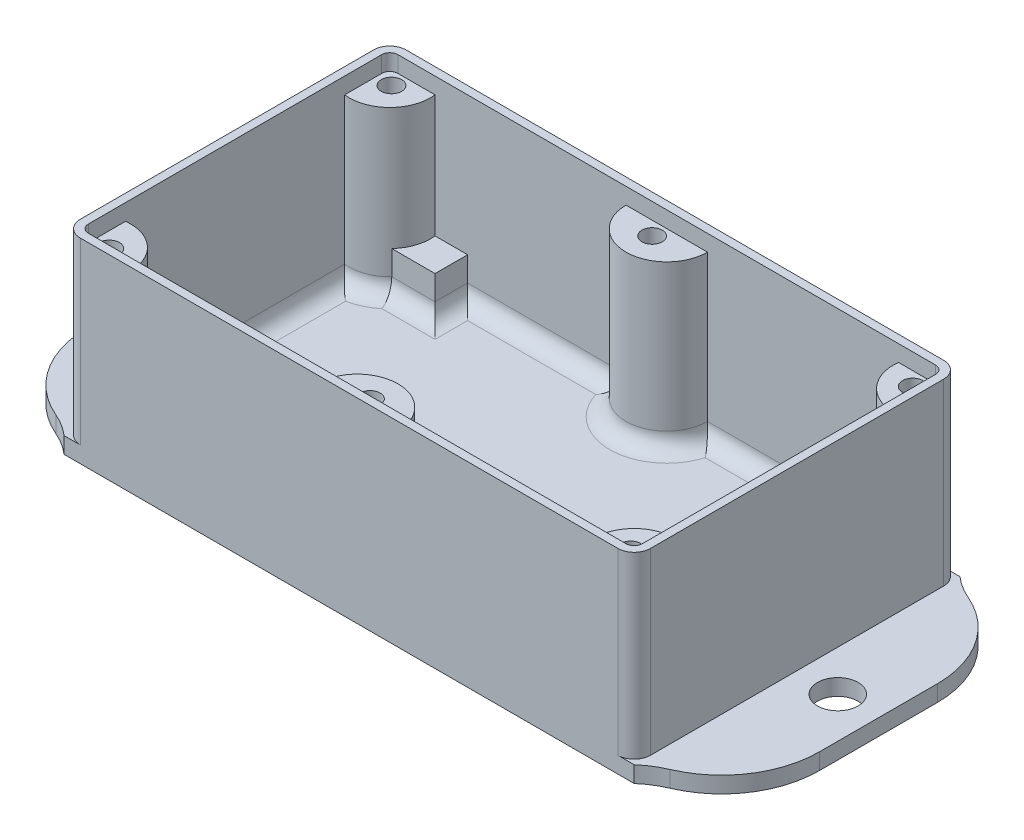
ISO-10303-21;
HEADER;
FILE_DESCRIPTION(('STEP AP214'),'2;1');
FILE_NAME('part.step','',(''),(''),'','','');
FILE_SCHEMA(('AUTOMOTIVE_DESIGN { 1 0 10303 214 1 1 1 1 }'));
ENDSEC;
DATA;
#1=APPLICATION_CONTEXT('core data for automotive mechanical design processes');
#2=APPLICATION_PROTOCOL_DEFINITION('international standard','automotive_design',2000,#1);
#3=PRODUCT_CONTEXT('',#1,'mechanical');
#4=PRODUCT('Part','Part','',(#3));
#5=PRODUCT_RELATED_PRODUCT_CATEGORY('part','',(#4));
#6=PRODUCT_DEFINITION_FORMATION('','',#4);
#7=PRODUCT_DEFINITION_CONTEXT('part definition',#1,'design');
#8=PRODUCT_DEFINITION('design','',#6,#7);
#9=PRODUCT_DEFINITION_SHAPE('','',#8);
#10=(LENGTH_UNIT() NAMED_UNIT(*) SI_UNIT(.MILLI.,.METRE.));
#11=(NAMED_UNIT(*) PLANE_ANGLE_UNIT() SI_UNIT($,.RADIAN.));
#12=(NAMED_UNIT(*) SI_UNIT($,.STERADIAN.) SOLID_ANGLE_UNIT());
#13=UNCERTAINTY_MEASURE_WITH_UNIT(LENGTH_MEASURE(1.E-05),#10,'distance_accuracy_value','');
#14=(GEOMETRIC_REPRESENTATION_CONTEXT(3) GLOBAL_UNCERTAINTY_ASSIGNED_CONTEXT((#13)) GLOBAL_UNIT_ASSIGNED_CONTEXT((#10,
#11,#12)) REPRESENTATION_CONTEXT('',''));
#15=CARTESIAN_POINT('',(0.,0.,0.));
#16=DIRECTION('',(0.,0.,1.));
#17=DIRECTION('',(1.,0.,0.));
#18=AXIS2_PLACEMENT_3D('',#15,#16,#17);
#19=CARTESIAN_POINT('',(0.,2.,0.));
#20=DIRECTION('',(0.,1.,0.));
#21=DIRECTION('',(0.,0.,1.));
#22=AXIS2_PLACEMENT_3D('',#19,#20,#21);
#23=PLANE('',#22);
#24=DIRECTION('',(1.,0.,0.));
#25=VECTOR('',#24,1.);
#26=CARTESIAN_POINT('',(24.4486467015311,2.,17.));
#27=LINE('',#26,#25);
#28=CARTESIAN_POINT('',(6.70820393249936,2.,17.));
#29=VERTEX_POINT('',#28);
#30=CARTESIAN_POINT('',(22.4486467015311,2.,17.));
#31=VERTEX_POINT('',#30);
#32=EDGE_CURVE('E862',#29,#31,#27,.T.);
#33=ORIENTED_EDGE('',*,*,#32,.T.);
#34=DIRECTION('',(0.,0.,-1.));
#35=VECTOR('',#34,1.);
#36=CARTESIAN_POINT('',(22.4486467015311,2.,15.));
#37=LINE('',#36,#35);
#38=CARTESIAN_POINT('',(22.4486467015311,2.,13.));
#39=VERTEX_POINT('',#38);
#40=EDGE_CURVE('E864',#31,#39,#37,.T.);
#41=ORIENTED_EDGE('',*,*,#40,.T.);
#42=DIRECTION('',(1.,0.,0.));
#43=VECTOR('',#42,1.);
#44=CARTESIAN_POINT('',(29.7613864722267,2.,13.));
#45=LINE('',#44,#43);
#46=CARTESIAN_POINT('',(28.9772899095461,2.,13.));
#47=VERTEX_POINT('',#46);
#48=EDGE_CURVE('E481',#39,#47,#45,.T.);
#49=ORIENTED_EDGE('',*,*,#48,.T.);
#50=CARTESIAN_POINT('',(33.4142135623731,2.,18.4142135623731));
#51=DIRECTION('',(0.,1.,0.));
#52=DIRECTION('',(0.,0.,1.));
#53=AXIS2_PLACEMENT_3D('',#50,#51,#52);
#54=CIRCLE('',#53,7.);
#55=CARTESIAN_POINT('',(32.,2.,11.5585589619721));
#56=VERTEX_POINT('',#55);
#57=EDGE_CURVE('E828',#47,#56,#54,.F.);
#58=ORIENTED_EDGE('',*,*,#57,.T.);
#59=DIRECTION('',(0.,0.,-1.));
#60=VECTOR('',#59,1.);
#61=CARTESIAN_POINT('',(32.,2.,-13.4486467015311));
#62=LINE('',#61,#60);
#63=CARTESIAN_POINT('',(32.,2.,-11.558558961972));
#64=VERTEX_POINT('',#63);
#65=EDGE_CURVE('E830',#56,#64,#62,.T.);
#66=ORIENTED_EDGE('',*,*,#65,.T.);
#67=CARTESIAN_POINT('',(33.4142135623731,2.,-18.4142135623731));
#68=DIRECTION('',(0.,1.,0.));
#69=DIRECTION('',(0.,0.,1.));
#70=AXIS2_PLACEMENT_3D('',#67,#68,#69);
#71=CIRCLE('',#70,7.);
#72=CARTESIAN_POINT('',(28.9772899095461,2.,-13.));
#73=VERTEX_POINT('',#72);
#74=EDGE_CURVE('E832',#64,#73,#71,.F.);
#75=ORIENTED_EDGE('',*,*,#74,.T.);
#76=DIRECTION('',(-1.,0.,0.));
#77=VECTOR('',#76,1.);
#78=CARTESIAN_POINT('',(24.4486467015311,2.,-13.));
#79=LINE('',#78,#77);
#80=CARTESIAN_POINT('',(22.4486467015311,2.,-13.));
#81=VERTEX_POINT('',#80);
#82=EDGE_CURVE('E834',#73,#81,#79,.T.);
#83=ORIENTED_EDGE('',*,*,#82,.T.);
#84=DIRECTION('',(0.,0.,-1.));
#85=VECTOR('',#84,1.);
#86=CARTESIAN_POINT('',(22.4486467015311,2.,-19.));
#87=LINE('',#86,#85);
#88=CARTESIAN_POINT('',(22.4486467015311,2.,-17.));
#89=VERTEX_POINT('',#88);
#90=EDGE_CURVE('E836',#81,#89,#87,.T.);
#91=ORIENTED_EDGE('',*,*,#90,.T.);
#92=DIRECTION('',(-1.,0.,0.));
#93=VECTOR('',#92,1.);
#94=CARTESIAN_POINT('',(5.,2.,-17.));
#95=LINE('',#94,#93);
#96=CARTESIAN_POINT('',(6.70820393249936,2.,-17.));
#97=VERTEX_POINT('',#96);
#98=EDGE_CURVE('E838',#89,#97,#95,.T.);
#99=ORIENTED_EDGE('',*,*,#98,.T.);
#100=CARTESIAN_POINT('',(0.,2.,-19.));
#101=DIRECTION('',(0.,1.,0.));
#102=DIRECTION('',(0.,0.,1.));
#103=AXIS2_PLACEMENT_3D('',#100,#101,#102);
#104=CIRCLE('',#103,7.);
#105=CARTESIAN_POINT('',(-6.70820393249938,2.,-17.));
#106=VERTEX_POINT('',#105);
#107=EDGE_CURVE('E840',#97,#106,#104,.F.);
#108=ORIENTED_EDGE('',*,*,#107,.T.);
#109=DIRECTION('',(-1.,0.,0.));
#110=VECTOR('',#109,1.);
#111=CARTESIAN_POINT('',(-24.4486467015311,2.,-17.));
#112=LINE('',#111,#110);
#113=CARTESIAN_POINT('',(-22.4486467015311,2.,-17.));
#114=VERTEX_POINT('',#113);
#115=EDGE_CURVE('E842',#106,#114,#112,.T.);
#116=ORIENTED_EDGE('',*,*,#115,.T.);
#117=DIRECTION('',(0.,0.,-1.));
#118=VECTOR('',#117,1.);
#119=CARTESIAN_POINT('',(-22.4486467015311,2.,0.));
#120=LINE('',#119,#118);
#121=CARTESIAN_POINT('',(-22.4486467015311,2.,-13.));
#122=VERTEX_POINT('',#121);
#123=EDGE_CURVE('E844',#114,#122,#120,.F.);
#124=ORIENTED_EDGE('',*,*,#123,.T.);
#125=DIRECTION('',(1.,0.,0.));
#126=VECTOR('',#125,1.);
#127=CARTESIAN_POINT('',(0.,2.,-13.));
#128=LINE('',#127,#126);
#129=CARTESIAN_POINT('',(-28.9772899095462,2.,-13.));
#130=VERTEX_POINT('',#129);
#131=EDGE_CURVE('E846',#122,#130,#128,.F.);
#132=ORIENTED_EDGE('',*,*,#131,.T.);
#133=CARTESIAN_POINT('',(-33.4142135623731,2.,-18.4142135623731));
#134=DIRECTION('',(0.,1.,0.));
#135=DIRECTION('',(0.,0.,1.));
#136=AXIS2_PLACEMENT_3D('',#133,#134,#135);
#137=CIRCLE('',#136,7.);
#138=CARTESIAN_POINT('',(-32.,2.,-11.558558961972));
#139=VERTEX_POINT('',#138);
#140=EDGE_CURVE('E848',#130,#139,#137,.F.);
#141=ORIENTED_EDGE('',*,*,#140,.T.);
#142=DIRECTION('',(0.,0.,1.));
#143=VECTOR('',#142,1.);
#144=CARTESIAN_POINT('',(-32.,2.,13.4486467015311));
#145=LINE('',#144,#143);
#146=CARTESIAN_POINT('',(-32.,2.,11.5585589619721));
#147=VERTEX_POINT('',#146);
#148=EDGE_CURVE('E850',#139,#147,#145,.T.);
#149=ORIENTED_EDGE('',*,*,#148,.T.);
#150=CARTESIAN_POINT('',(-33.4142135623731,2.,18.4142135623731));
#151=DIRECTION('',(0.,1.,0.));
#152=DIRECTION('',(0.,0.,1.));
#153=AXIS2_PLACEMENT_3D('',#150,#151,#152);
#154=CIRCLE('',#153,7.);
#155=CARTESIAN_POINT('',(-28.9772899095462,2.,13.));
#156=VERTEX_POINT('',#155);
#157=EDGE_CURVE('E852',#147,#156,#154,.F.);
#158=ORIENTED_EDGE('',*,*,#157,.T.);
#159=DIRECTION('',(-1.,0.,0.));
#160=VECTOR('',#159,1.);
#161=CARTESIAN_POINT('',(0.,2.,13.));
#162=LINE('',#161,#160);
#163=CARTESIAN_POINT('',(-22.4486467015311,2.,13.));
#164=VERTEX_POINT('',#163);
#165=EDGE_CURVE('E854',#156,#164,#162,.F.);
#166=ORIENTED_EDGE('',*,*,#165,.T.);
#167=DIRECTION('',(0.,0.,-1.));
#168=VECTOR('',#167,1.);
#169=CARTESIAN_POINT('',(-22.4486467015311,2.,0.));
#170=LINE('',#169,#168);
#171=CARTESIAN_POINT('',(-22.4486467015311,2.,17.));
#172=VERTEX_POINT('',#171);
#173=EDGE_CURVE('E856',#164,#172,#170,.F.);
#174=ORIENTED_EDGE('',*,*,#173,.T.);
#175=DIRECTION('',(1.,0.,0.));
#176=VECTOR('',#175,1.);
#177=CARTESIAN_POINT('',(-5.,2.,17.));
#178=LINE('',#177,#176);
#179=CARTESIAN_POINT('',(-6.70820393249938,2.,17.));
#180=VERTEX_POINT('',#179);
#181=EDGE_CURVE('E858',#172,#180,#178,.T.);
#182=ORIENTED_EDGE('',*,*,#181,.T.);
#183=CARTESIAN_POINT('',(0.,2.,19.));
#184=DIRECTION('',(0.,1.,0.));
#185=DIRECTION('',(0.,0.,1.));
#186=AXIS2_PLACEMENT_3D('',#183,#184,#185);
#187=CIRCLE('',#186,7.);
#188=EDGE_CURVE('E860',#180,#29,#187,.F.);
#189=ORIENTED_EDGE('',*,*,#188,.T.);
#190=EDGE_LOOP('',(#33,#41,#49,#58,#66,#75,#83,#91,#99,#108,#116,#124,#132,#141,#149,#158,#166,
#174,#182,#189));
#191=FACE_BOUND('',#190,.T.);
#192=ADVANCED_FACE('F59',(#191),#23,.T.);
#193=CARTESIAN_POINT('',(-32.,22.,19.));
#194=DIRECTION('',(0.,0.,-1.));
#195=DIRECTION('',(-1.,0.,0.));
#196=AXIS2_PLACEMENT_3D('',#193,#194,#195);
#197=PLANE('',#196);
#198=DIRECTION('',(0.,-1.,0.));
#199=VECTOR('',#198,1.);
#200=CARTESIAN_POINT('',(24.4486467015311,7.,19.));
#201=LINE('',#200,#199);
#202=CARTESIAN_POINT('',(24.4486467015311,7.,19.));
#203=VERTEX_POINT('',#202);
#204=CARTESIAN_POINT('',(24.4486467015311,4.,19.));
#205=VERTEX_POINT('',#204);
#206=EDGE_CURVE('E503',#203,#205,#201,.T.);
#207=ORIENTED_EDGE('',*,*,#206,.T.);
#208=DIRECTION('',(1.,0.,0.));
#209=VECTOR('',#208,1.);
#210=CARTESIAN_POINT('',(5.,4.,19.));
#211=LINE('',#210,#209);
#212=CARTESIAN_POINT('',(5.,4.,19.));
#213=VERTEX_POINT('',#212);
#214=EDGE_CURVE('E872',#205,#213,#211,.F.);
#215=ORIENTED_EDGE('',*,*,#214,.T.);
#216=DIRECTION('',(0.,-1.,0.));
#217=VECTOR('',#216,1.);
#218=CARTESIAN_POINT('',(5.,22.,19.));
#219=LINE('',#218,#217);
#220=CARTESIAN_POINT('',(5.,22.,19.));
#221=VERTEX_POINT('',#220);
#222=EDGE_CURVE('E694',#221,#213,#219,.T.);
#223=ORIENTED_EDGE('',*,*,#222,.F.);
#224=DIRECTION('',(1.,0.,0.));
#225=VECTOR('',#224,1.);
#226=CARTESIAN_POINT('',(-33.,22.,19.));
#227=LINE('',#226,#225);
#228=CARTESIAN_POINT('',(-5.00000000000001,22.,19.));
#229=VERTEX_POINT('',#228);
#230=EDGE_CURVE('E616',#229,#221,#227,.T.);
#231=ORIENTED_EDGE('',*,*,#230,.F.);
#232=DIRECTION('',(0.,-1.,0.));
#233=VECTOR('',#232,1.);
#234=CARTESIAN_POINT('',(-5.,22.,19.));
#235=LINE('',#234,#233);
#236=CARTESIAN_POINT('',(-5.,4.,19.));
#237=VERTEX_POINT('',#236);
#238=EDGE_CURVE('E697',#229,#237,#235,.T.);
#239=ORIENTED_EDGE('',*,*,#238,.T.);
#240=DIRECTION('',(1.,0.,0.));
#241=VECTOR('',#240,1.);
#242=CARTESIAN_POINT('',(-24.4486467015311,4.,19.));
#243=LINE('',#242,#241);
#244=CARTESIAN_POINT('',(-24.4486467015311,4.,19.));
#245=VERTEX_POINT('',#244);
#246=EDGE_CURVE('E870',#237,#245,#243,.F.);
#247=ORIENTED_EDGE('',*,*,#246,.T.);
#248=DIRECTION('',(0.,-1.,0.));
#249=VECTOR('',#248,1.);
#250=CARTESIAN_POINT('',(-24.4486467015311,7.,19.));
#251=LINE('',#250,#249);
#252=CARTESIAN_POINT('',(-24.4486467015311,7.,19.));
#253=VERTEX_POINT('',#252);
#254=EDGE_CURVE('E534',#253,#245,#251,.T.);
#255=ORIENTED_EDGE('',*,*,#254,.F.);
#256=DIRECTION('',(1.,0.,0.));
#257=VECTOR('',#256,1.);
#258=CARTESIAN_POINT('',(-28.4486467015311,7.,19.));
#259=LINE('',#258,#257);
#260=CARTESIAN_POINT('',(-28.4486467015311,7.,19.));
#261=VERTEX_POINT('',#260);
#262=EDGE_CURVE('E521',#261,#253,#259,.T.);
#263=ORIENTED_EDGE('',*,*,#262,.F.);
#264=DIRECTION('',(0.,-1.,0.));
#265=VECTOR('',#264,1.);
#266=CARTESIAN_POINT('',(-28.4486467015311,22.,19.));
#267=LINE('',#266,#265);
#268=CARTESIAN_POINT('',(-28.4486467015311,22.,19.));
#269=VERTEX_POINT('',#268);
#270=EDGE_CURVE('E721',#269,#261,#267,.T.);
#271=ORIENTED_EDGE('',*,*,#270,.F.);
#272=CARTESIAN_POINT('',(-33.,22.,19.));
#273=VERTEX_POINT('',#272);
#274=EDGE_CURVE('E613',#273,#269,#227,.T.);
#275=ORIENTED_EDGE('',*,*,#274,.F.);
#276=DIRECTION('',(0.,-1.,0.));
#277=VECTOR('',#276,1.);
#278=CARTESIAN_POINT('',(-33.,24.,19.));
#279=LINE('',#278,#277);
#280=CARTESIAN_POINT('',(-33.,24.,19.));
#281=VERTEX_POINT('',#280);
#282=EDGE_CURVE('E648',#281,#273,#279,.T.);
#283=ORIENTED_EDGE('',*,*,#282,.F.);
#284=DIRECTION('',(1.,0.,0.));
#285=VECTOR('',#284,1.);
#286=CARTESIAN_POINT('',(-33.,24.,19.));
#287=LINE('',#286,#285);
#288=CARTESIAN_POINT('',(33.,24.,19.));
#289=VERTEX_POINT('',#288);
#290=EDGE_CURVE('E594',#281,#289,#287,.T.);
#291=ORIENTED_EDGE('',*,*,#290,.T.);
#292=DIRECTION('',(0.,-1.,0.));
#293=VECTOR('',#292,1.);
#294=CARTESIAN_POINT('',(33.,24.,19.));
#295=LINE('',#294,#293);
#296=CARTESIAN_POINT('',(33.,22.,19.));
#297=VERTEX_POINT('',#296);
#298=EDGE_CURVE('E646',#289,#297,#295,.T.);
#299=ORIENTED_EDGE('',*,*,#298,.T.);
#300=CARTESIAN_POINT('',(28.4486467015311,22.,19.));
#301=VERTEX_POINT('',#300);
#302=EDGE_CURVE('E617',#301,#297,#227,.T.);
#303=ORIENTED_EDGE('',*,*,#302,.F.);
#304=DIRECTION('',(0.,-1.,0.));
#305=VECTOR('',#304,1.);
#306=CARTESIAN_POINT('',(28.4486467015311,22.,19.));
#307=LINE('',#306,#305);
#308=CARTESIAN_POINT('',(28.4486467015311,7.,19.));
#309=VERTEX_POINT('',#308);
#310=EDGE_CURVE('E689',#301,#309,#307,.T.);
#311=ORIENTED_EDGE('',*,*,#310,.T.);
#312=DIRECTION('',(-1.,0.,0.));
#313=VECTOR('',#312,1.);
#314=CARTESIAN_POINT('',(28.4486467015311,7.,19.));
#315=LINE('',#314,#313);
#316=EDGE_CURVE('E476',#309,#203,#315,.T.);
#317=ORIENTED_EDGE('',*,*,#316,.T.);
#318=EDGE_LOOP('',(#207,#215,#223,#231,#239,#247,#255,#263,#271,#275,#283,#291,#299,#303,#311,#317));
#319=FACE_BOUND('',#318,.T.);
#320=ADVANCED_FACE('F1091',(#319),#197,.T.);
#321=CARTESIAN_POINT('',(-33.4142135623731,22.,18.4142135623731));
#322=DIRECTION('',(0.,-1.,0.));
#323=DIRECTION('',(0.,0.,-1.));
#324=AXIS2_PLACEMENT_3D('',#321,#322,#323);
#325=CYLINDRICAL_SURFACE('',#324,5.);
#326=DIRECTION('',(0.,-1.,0.));
#327=VECTOR('',#326,1.);
#328=CARTESIAN_POINT('',(-29.7613864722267,7.,15.));
#329=LINE('',#328,#327);
#330=CARTESIAN_POINT('',(-29.7613864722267,7.,15.));
#331=VERTEX_POINT('',#330);
#332=CARTESIAN_POINT('',(-29.7613864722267,4.,15.));
#333=VERTEX_POINT('',#332);
#334=EDGE_CURVE('E528',#331,#333,#329,.T.);
#335=ORIENTED_EDGE('',*,*,#334,.T.);
#336=CARTESIAN_POINT('',(-33.4142135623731,4.,18.4142135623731));
#337=DIRECTION('',(0.,1.,0.));
#338=DIRECTION('',(0.,0.,1.));
#339=AXIS2_PLACEMENT_3D('',#336,#337,#338);
#340=CIRCLE('',#339,5.);
#341=CARTESIAN_POINT('',(-34.,4.,13.4486467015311));
#342=VERTEX_POINT('',#341);
#343=EDGE_CURVE('E880',#333,#342,#340,.T.);
#344=ORIENTED_EDGE('',*,*,#343,.T.);
#345=DIRECTION('',(0.,-1.,0.));
#346=VECTOR('',#345,1.);
#347=CARTESIAN_POINT('',(-34.,22.,13.4486467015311));
#348=LINE('',#347,#346);
#349=CARTESIAN_POINT('',(-34.,22.,13.4486467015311));
#350=VERTEX_POINT('',#349);
#351=EDGE_CURVE('E724',#350,#342,#348,.T.);
#352=ORIENTED_EDGE('',*,*,#351,.F.);
#353=CARTESIAN_POINT('',(-33.4142135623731,22.,18.4142135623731));
#354=DIRECTION('',(0.,1.,0.));
#355=DIRECTION('',(0.,0.,1.));
#356=AXIS2_PLACEMENT_3D('',#353,#354,#355);
#357=CIRCLE('',#356,5.);
#358=EDGE_CURVE('E718',#269,#350,#357,.T.);
#359=ORIENTED_EDGE('',*,*,#358,.F.);
#360=ORIENTED_EDGE('',*,*,#270,.T.);
#361=CARTESIAN_POINT('',(-33.4142135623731,7.,18.4142135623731));
#362=DIRECTION('',(0.,1.,0.));
#363=DIRECTION('',(0.,0.,1.));
#364=AXIS2_PLACEMENT_3D('',#361,#362,#363);
#365=CIRCLE('',#364,5.);
#366=EDGE_CURVE('E824',#261,#331,#365,.T.);
#367=ORIENTED_EDGE('',*,*,#366,.T.);
#368=EDGE_LOOP('',(#335,#344,#352,#359,#360,#367));
#369=FACE_BOUND('',#368,.T.);
#370=ADVANCED_FACE('F1099',(#369),#325,.T.);
#371=CARTESIAN_POINT('',(-33.4142135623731,22.,-18.4142135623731));
#372=DIRECTION('',(0.,-1.,0.));
#373=DIRECTION('',(0.,0.,-1.));
#374=AXIS2_PLACEMENT_3D('',#371,#372,#373);
#375=CYLINDRICAL_SURFACE('',#374,5.);
#376=DIRECTION('',(0.,-1.,0.));
#377=VECTOR('',#376,1.);
#378=CARTESIAN_POINT('',(-34.,22.,-13.4486467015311));
#379=LINE('',#378,#377);
#380=CARTESIAN_POINT('',(-34.,22.,-13.4486467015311));
#381=VERTEX_POINT('',#380);
#382=CARTESIAN_POINT('',(-34.,4.,-13.4486467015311));
#383=VERTEX_POINT('',#382);
#384=EDGE_CURVE('E678',#381,#383,#379,.T.);
#385=ORIENTED_EDGE('',*,*,#384,.T.);
#386=CARTESIAN_POINT('',(-33.4142135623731,4.,-18.4142135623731));
#387=DIRECTION('',(0.,1.,0.));
#388=DIRECTION('',(0.,0.,1.));
#389=AXIS2_PLACEMENT_3D('',#386,#387,#388);
#390=CIRCLE('',#389,5.);
#391=CARTESIAN_POINT('',(-29.7613864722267,4.,-15.));
#392=VERTEX_POINT('',#391);
#393=EDGE_CURVE('E884',#383,#392,#390,.T.);
#394=ORIENTED_EDGE('',*,*,#393,.T.);
#395=DIRECTION('',(0.,-1.,0.));
#396=VECTOR('',#395,1.);
#397=CARTESIAN_POINT('',(-29.7613864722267,7.,-15.));
#398=LINE('',#397,#396);
#399=CARTESIAN_POINT('',(-29.7613864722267,7.,-15.));
#400=VERTEX_POINT('',#399);
#401=EDGE_CURVE('E552',#400,#392,#398,.T.);
#402=ORIENTED_EDGE('',*,*,#401,.F.);
#403=CARTESIAN_POINT('',(-33.4142135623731,7.,-18.4142135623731));
#404=DIRECTION('',(0.,-1.,0.));
#405=DIRECTION('',(0.,0.,1.));
#406=AXIS2_PLACEMENT_3D('',#403,#404,#405);
#407=CIRCLE('',#406,5.);
#408=CARTESIAN_POINT('',(-28.4486467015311,7.,-19.));
#409=VERTEX_POINT('',#408);
#410=EDGE_CURVE('E537',#409,#400,#407,.T.);
#411=ORIENTED_EDGE('',*,*,#410,.F.);
#412=DIRECTION('',(0.,-1.,0.));
#413=VECTOR('',#412,1.);
#414=CARTESIAN_POINT('',(-28.4486467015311,22.,-19.));
#415=LINE('',#414,#413);
#416=CARTESIAN_POINT('',(-28.4486467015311,22.,-19.));
#417=VERTEX_POINT('',#416);
#418=EDGE_CURVE('E681',#417,#409,#415,.T.);
#419=ORIENTED_EDGE('',*,*,#418,.F.);
#420=CARTESIAN_POINT('',(-33.4142135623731,22.,-18.4142135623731));
#421=DIRECTION('',(0.,1.,0.));
#422=DIRECTION('',(0.,0.,1.));
#423=AXIS2_PLACEMENT_3D('',#420,#421,#422);
#424=CIRCLE('',#423,5.);
#425=EDGE_CURVE('E675',#381,#417,#424,.T.);
#426=ORIENTED_EDGE('',*,*,#425,.F.);
#427=EDGE_LOOP('',(#385,#394,#402,#411,#419,#426));
#428=FACE_BOUND('',#427,.T.);
#429=ADVANCED_FACE('F1288',(#428),#375,.T.);
#430=CARTESIAN_POINT('',(-32.,22.,-19.));
#431=DIRECTION('',(0.,0.,1.));
#432=DIRECTION('',(1.,0.,0.));
#433=AXIS2_PLACEMENT_3D('',#430,#431,#432);
#434=PLANE('',#433);
#435=DIRECTION('',(0.,-1.,0.));
#436=VECTOR('',#435,1.);
#437=CARTESIAN_POINT('',(-24.4486467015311,7.,-19.));
#438=LINE('',#437,#436);
#439=CARTESIAN_POINT('',(-24.4486467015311,7.,-19.));
#440=VERTEX_POINT('',#439);
#441=CARTESIAN_POINT('',(-24.4486467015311,4.,-19.));
#442=VERTEX_POINT('',#441);
#443=EDGE_CURVE('E546',#440,#442,#438,.T.);
#444=ORIENTED_EDGE('',*,*,#443,.T.);
#445=DIRECTION('',(-1.,0.,0.));
#446=VECTOR('',#445,1.);
#447=CARTESIAN_POINT('',(-5.,4.,-19.));
#448=LINE('',#447,#446);
#449=CARTESIAN_POINT('',(-5.,4.,-19.));
#450=VERTEX_POINT('',#449);
#451=EDGE_CURVE('E892',#442,#450,#448,.F.);
#452=ORIENTED_EDGE('',*,*,#451,.T.);
#453=DIRECTION('',(0.,-1.,0.));
#454=VECTOR('',#453,1.);
#455=CARTESIAN_POINT('',(-5.,22.,-19.));
#456=LINE('',#455,#454);
#457=CARTESIAN_POINT('',(-5.,22.,-19.));
#458=VERTEX_POINT('',#457);
#459=EDGE_CURVE('E712',#458,#450,#456,.T.);
#460=ORIENTED_EDGE('',*,*,#459,.F.);
#461=DIRECTION('',(-1.,0.,0.));
#462=VECTOR('',#461,1.);
#463=CARTESIAN_POINT('',(33.,22.,-19.));
#464=LINE('',#463,#462);
#465=CARTESIAN_POINT('',(4.99999999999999,22.,-19.));
#466=VERTEX_POINT('',#465);
#467=EDGE_CURVE('E629',#466,#458,#464,.T.);
#468=ORIENTED_EDGE('',*,*,#467,.F.);
#469=DIRECTION('',(0.,-1.,0.));
#470=VECTOR('',#469,1.);
#471=CARTESIAN_POINT('',(5.,22.,-19.));
#472=LINE('',#471,#470);
#473=CARTESIAN_POINT('',(5.,4.,-19.));
#474=VERTEX_POINT('',#473);
#475=EDGE_CURVE('E715',#466,#474,#472,.T.);
#476=ORIENTED_EDGE('',*,*,#475,.T.);
#477=DIRECTION('',(-1.,0.,0.));
#478=VECTOR('',#477,1.);
#479=CARTESIAN_POINT('',(24.4486467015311,4.,-19.));
#480=LINE('',#479,#478);
#481=CARTESIAN_POINT('',(24.4486467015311,4.,-19.));
#482=VERTEX_POINT('',#481);
#483=EDGE_CURVE('E890',#474,#482,#480,.F.);
#484=ORIENTED_EDGE('',*,*,#483,.T.);
#485=DIRECTION('',(0.,-1.,0.));
#486=VECTOR('',#485,1.);
#487=CARTESIAN_POINT('',(24.4486467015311,7.,-19.));
#488=LINE('',#487,#486);
#489=CARTESIAN_POINT('',(24.4486467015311,7.,-19.));
#490=VERTEX_POINT('',#489);
#491=EDGE_CURVE('E518',#490,#482,#488,.T.);
#492=ORIENTED_EDGE('',*,*,#491,.F.);
#493=DIRECTION('',(1.,0.,0.));
#494=VECTOR('',#493,1.);
#495=CARTESIAN_POINT('',(28.4486467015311,7.,-19.));
#496=LINE('',#495,#494);
#497=CARTESIAN_POINT('',(28.4486467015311,7.,-19.));
#498=VERTEX_POINT('',#497);
#499=EDGE_CURVE('E498',#490,#498,#496,.T.);
#500=ORIENTED_EDGE('',*,*,#499,.T.);
#501=DIRECTION('',(0.,-1.,0.));
#502=VECTOR('',#501,1.);
#503=CARTESIAN_POINT('',(28.4486467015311,22.,-19.));
#504=LINE('',#503,#502);
#505=CARTESIAN_POINT('',(28.4486467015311,22.,-19.));
#506=VERTEX_POINT('',#505);
#507=EDGE_CURVE('E703',#506,#498,#504,.T.);
#508=ORIENTED_EDGE('',*,*,#507,.F.);
#509=CARTESIAN_POINT('',(33.,22.,-19.));
#510=VERTEX_POINT('',#509);
#511=EDGE_CURVE('E626',#510,#506,#464,.T.);
#512=ORIENTED_EDGE('',*,*,#511,.F.);
#513=DIRECTION('',(0.,-1.,0.));
#514=VECTOR('',#513,1.);
#515=CARTESIAN_POINT('',(33.,24.,-19.));
#516=LINE('',#515,#514);
#517=CARTESIAN_POINT('',(33.,24.,-19.));
#518=VERTEX_POINT('',#517);
#519=EDGE_CURVE('E640',#518,#510,#516,.T.);
#520=ORIENTED_EDGE('',*,*,#519,.F.);
#521=DIRECTION('',(-1.,0.,0.));
#522=VECTOR('',#521,1.);
#523=CARTESIAN_POINT('',(33.,24.,-19.));
#524=LINE('',#523,#522);
#525=CARTESIAN_POINT('',(-33.,24.,-19.));
#526=VERTEX_POINT('',#525);
#527=EDGE_CURVE('E603',#518,#526,#524,.T.);
#528=ORIENTED_EDGE('',*,*,#527,.T.);
#529=DIRECTION('',(0.,-1.,0.));
#530=VECTOR('',#529,1.);
#531=CARTESIAN_POINT('',(-33.,24.,-19.));
#532=LINE('',#531,#530);
#533=CARTESIAN_POINT('',(-33.,22.,-19.));
#534=VERTEX_POINT('',#533);
#535=EDGE_CURVE('E638',#526,#534,#532,.T.);
#536=ORIENTED_EDGE('',*,*,#535,.T.);
#537=EDGE_CURVE('E630',#417,#534,#464,.T.);
#538=ORIENTED_EDGE('',*,*,#537,.F.);
#539=ORIENTED_EDGE('',*,*,#418,.T.);
#540=DIRECTION('',(-1.,0.,0.));
#541=VECTOR('',#540,1.);
#542=CARTESIAN_POINT('',(-28.4486467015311,7.,-19.));
#543=LINE('',#542,#541);
#544=EDGE_CURVE('E543',#440,#409,#543,.T.);
#545=ORIENTED_EDGE('',*,*,#544,.F.);
#546=EDGE_LOOP('',(#444,#452,#460,#468,#476,#484,#492,#500,#508,#512,#520,#528,#536,#538,#539,#545));
#547=FACE_BOUND('',#546,.T.);
#548=ADVANCED_FACE('F1106',(#547),#434,.T.);
#549=CARTESIAN_POINT('',(-40.,2.,0.));
#550=DIRECTION('',(0.,1.,0.));
#551=DIRECTION('',(0.,0.,1.));
#552=AXIS2_PLACEMENT_3D('',#549,#550,#551);
#553=CIRCLE('',#552,2.5);
#554=CARTESIAN_POINT('',(-40.,2.,2.5));
#555=VERTEX_POINT('',#554);
#556=EDGE_CURVE('E2268',#555,#555,#553,.T.);
#557=ORIENTED_EDGE('',*,*,#556,.F.);
#558=EDGE_LOOP('',(#557));
#559=FACE_BOUND('',#558,.T.);
#560=CARTESIAN_POINT('',(-41.6143782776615,2.,-27.5));
#561=DIRECTION('',(0.,1.,0.));
#562=DIRECTION('',(0.,0.,1.));
#563=AXIS2_PLACEMENT_3D('',#560,#561,#562);
#564=CIRCLE('',#563,10.);
#565=CARTESIAN_POINT('',(-35.,2.,-20.));
#566=VERTEX_POINT('',#565);
#567=CARTESIAN_POINT('',(-37.6987517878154,2.,-18.2984854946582));
#568=VERTEX_POINT('',#567);
#569=EDGE_CURVE('E812',#566,#568,#564,.F.);
#570=ORIENTED_EDGE('',*,*,#569,.T.);
#571=CARTESIAN_POINT('',(-33.,2.,-7.25666808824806));
#572=DIRECTION('',(0.,1.,0.));
#573=DIRECTION('',(0.,0.,1.));
#574=AXIS2_PLACEMENT_3D('',#571,#572,#573);
#575=CIRCLE('',#574,12.);
#576=CARTESIAN_POINT('',(-45.,2.,-7.25666808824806));
#577=VERTEX_POINT('',#576);
#578=EDGE_CURVE('E67',#568,#577,#575,.T.);
#579=ORIENTED_EDGE('',*,*,#578,.T.);
#580=DIRECTION('',(0.,0.,1.));
#581=VECTOR('',#580,1.);
#582=CARTESIAN_POINT('',(-45.,2.,0.));
#583=LINE('',#582,#581);
#584=CARTESIAN_POINT('',(-45.,2.,7.25666808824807));
#585=VERTEX_POINT('',#584);
#586=EDGE_CURVE('E770',#577,#585,#583,.T.);
#587=ORIENTED_EDGE('',*,*,#586,.T.);
#588=CARTESIAN_POINT('',(-33.,2.,7.25666808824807));
#589=DIRECTION('',(0.,1.,0.));
#590=DIRECTION('',(0.,0.,1.));
#591=AXIS2_PLACEMENT_3D('',#588,#589,#590);
#592=CIRCLE('',#591,12.);
#593=CARTESIAN_POINT('',(-37.6987517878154,2.,18.2984854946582));
#594=VERTEX_POINT('',#593);
#595=EDGE_CURVE('E74',#585,#594,#592,.T.);
#596=ORIENTED_EDGE('',*,*,#595,.T.);
#597=CARTESIAN_POINT('',(-41.6143782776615,2.,27.5));
#598=DIRECTION('',(0.,1.,0.));
#599=DIRECTION('',(0.,0.,1.));
#600=AXIS2_PLACEMENT_3D('',#597,#598,#599);
#601=CIRCLE('',#600,10.);
#602=CARTESIAN_POINT('',(-35.,2.,20.));
#603=VERTEX_POINT('',#602);
#604=EDGE_CURVE('E817',#594,#603,#601,.F.);
#605=ORIENTED_EDGE('',*,*,#604,.T.);
#606=DIRECTION('',(1.,0.,0.));
#607=VECTOR('',#606,1.);
#608=CARTESIAN_POINT('',(-35.,2.,20.));
#609=LINE('',#608,#607);
#610=CARTESIAN_POINT('',(-33.,2.,20.));
#611=VERTEX_POINT('',#610);
#612=EDGE_CURVE('E783',#603,#611,#609,.T.);
#613=ORIENTED_EDGE('',*,*,#612,.T.);
#614=CARTESIAN_POINT('',(-33.,2.,18.));
#615=DIRECTION('',(0.,1.,0.));
#616=DIRECTION('',(0.,0.,1.));
#617=AXIS2_PLACEMENT_3D('',#614,#615,#616);
#618=CIRCLE('',#617,2.);
#619=CARTESIAN_POINT('',(-35.,2.,18.));
#620=VERTEX_POINT('',#619);
#621=EDGE_CURVE('E727',#620,#611,#618,.T.);
#622=ORIENTED_EDGE('',*,*,#621,.F.);
#623=DIRECTION('',(0.,0.,1.));
#624=VECTOR('',#623,1.);
#625=CARTESIAN_POINT('',(-35.,2.,-18.));
#626=LINE('',#625,#624);
#627=CARTESIAN_POINT('',(-35.,2.,-18.));
#628=VERTEX_POINT('',#627);
#629=EDGE_CURVE('E742',#628,#620,#626,.T.);
#630=ORIENTED_EDGE('',*,*,#629,.F.);
#631=CARTESIAN_POINT('',(-33.,2.,-18.));
#632=DIRECTION('',(0.,1.,0.));
#633=DIRECTION('',(0.,0.,1.));
#634=AXIS2_PLACEMENT_3D('',#631,#632,#633);
#635=CIRCLE('',#634,2.);
#636=CARTESIAN_POINT('',(-33.,2.,-20.));
#637=VERTEX_POINT('',#636);
#638=EDGE_CURVE('E739',#637,#628,#635,.T.);
#639=ORIENTED_EDGE('',*,*,#638,.F.);
#640=DIRECTION('',(1.,0.,0.));
#641=VECTOR('',#640,1.);
#642=CARTESIAN_POINT('',(-35.,2.,-20.));
#643=LINE('',#642,#641);
#644=EDGE_CURVE('E787',#566,#637,#643,.T.);
#645=ORIENTED_EDGE('',*,*,#644,.F.);
#646=EDGE_LOOP('',(#570,#579,#587,#596,#605,#613,#622,#630,#639,#645));
#647=FACE_BOUND('',#646,.T.);
#648=ADVANCED_FACE('F1094',(#559,#647),#23,.T.);
#649=CARTESIAN_POINT('',(-45.,2.,0.));
#650=DIRECTION('',(1.,0.,0.));
#651=DIRECTION('',(0.,0.,-1.));
#652=AXIS2_PLACEMENT_3D('',#649,#650,#651);
#653=PLANE('',#652);
#654=ORIENTED_EDGE('',*,*,#586,.F.);
#655=DIRECTION('',(0.,-1.,0.));
#656=VECTOR('',#655,1.);
#657=CARTESIAN_POINT('',(-45.,2.,-7.25666808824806));
#658=LINE('',#657,#656);
#659=CARTESIAN_POINT('',(-45.,0.,-7.25666808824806));
#660=VERTEX_POINT('',#659);
#661=EDGE_CURVE('E1146',#577,#660,#658,.T.);
#662=ORIENTED_EDGE('',*,*,#661,.T.);
#663=DIRECTION('',(0.,0.,1.));
#664=VECTOR('',#663,1.);
#665=CARTESIAN_POINT('',(-45.,0.,0.));
#666=LINE('',#665,#664);
#667=CARTESIAN_POINT('',(-45.,0.,7.25666808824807));
#668=VERTEX_POINT('',#667);
#669=EDGE_CURVE('E773',#660,#668,#666,.T.);
#670=ORIENTED_EDGE('',*,*,#669,.T.);
#671=DIRECTION('',(0.,-1.,0.));
#672=VECTOR('',#671,1.);
#673=CARTESIAN_POINT('',(-45.,2.,7.25666808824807));
#674=LINE('',#673,#672);
#675=EDGE_CURVE('E1140',#668,#585,#674,.F.);
#676=ORIENTED_EDGE('',*,*,#675,.T.);
#677=EDGE_LOOP('',(#654,#662,#670,#676));
#678=FACE_BOUND('',#677,.T.);
#679=ADVANCED_FACE('F1105',(#678),#653,.F.);
#680=CARTESIAN_POINT('',(40.,2.,0.));
#681=DIRECTION('',(0.,-1.,0.));
#682=DIRECTION('',(0.,0.,1.));
#683=AXIS2_PLACEMENT_3D('',#680,#681,#682);
#684=CIRCLE('',#683,2.5);
#685=CARTESIAN_POINT('',(40.,2.,2.5));
#686=VERTEX_POINT('',#685);
#687=EDGE_CURVE('E1124',#686,#686,#684,.T.);
#688=ORIENTED_EDGE('',*,*,#687,.T.);
#689=EDGE_LOOP('',(#688));
#690=FACE_BOUND('',#689,.T.);
#691=DIRECTION('',(0.,0.,1.));
#692=VECTOR('',#691,1.);
#693=CARTESIAN_POINT('',(45.,2.,0.));
#694=LINE('',#693,#692);
#695=CARTESIAN_POINT('',(45.,2.,-7.25666808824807));
#696=VERTEX_POINT('',#695);
#697=CARTESIAN_POINT('',(45.,2.,7.25666808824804));
#698=VERTEX_POINT('',#697);
#699=EDGE_CURVE('E776',#696,#698,#694,.T.);
#700=ORIENTED_EDGE('',*,*,#699,.F.);
#701=CARTESIAN_POINT('',(33.,2.,-7.25666808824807));
#702=DIRECTION('',(0.,1.,0.));
#703=DIRECTION('',(0.,0.,1.));
#704=AXIS2_PLACEMENT_3D('',#701,#702,#703);
#705=CIRCLE('',#704,12.);
#706=CARTESIAN_POINT('',(37.6987517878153,2.,-18.2984854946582));
#707=VERTEX_POINT('',#706);
#708=EDGE_CURVE('E1127',#696,#707,#705,.T.);
#709=ORIENTED_EDGE('',*,*,#708,.T.);
#710=CARTESIAN_POINT('',(41.6143782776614,2.,-27.5));
#711=DIRECTION('',(0.,1.,0.));
#712=DIRECTION('',(0.,0.,1.));
#713=AXIS2_PLACEMENT_3D('',#710,#711,#712);
#714=CIRCLE('',#713,10.);
#715=CARTESIAN_POINT('',(35.,2.,-20.));
#716=VERTEX_POINT('',#715);
#717=EDGE_CURVE('E808',#707,#716,#714,.F.);
#718=ORIENTED_EDGE('',*,*,#717,.T.);
#719=CARTESIAN_POINT('',(33.,2.,-20.));
#720=VERTEX_POINT('',#719);
#721=EDGE_CURVE('E785',#720,#716,#643,.T.);
#722=ORIENTED_EDGE('',*,*,#721,.F.);
#723=CARTESIAN_POINT('',(33.,2.,-18.));
#724=DIRECTION('',(0.,1.,0.));
#725=DIRECTION('',(0.,0.,-1.));
#726=AXIS2_PLACEMENT_3D('',#723,#724,#725);
#727=CIRCLE('',#726,2.);
#728=CARTESIAN_POINT('',(35.,2.,-18.));
#729=VERTEX_POINT('',#728);
#730=EDGE_CURVE('E736',#729,#720,#727,.T.);
#731=ORIENTED_EDGE('',*,*,#730,.F.);
#732=DIRECTION('',(0.,0.,-1.));
#733=VECTOR('',#732,1.);
#734=CARTESIAN_POINT('',(35.,2.,-18.));
#735=LINE('',#734,#733);
#736=CARTESIAN_POINT('',(35.,2.,18.));
#737=VERTEX_POINT('',#736);
#738=EDGE_CURVE('E733',#737,#729,#735,.T.);
#739=ORIENTED_EDGE('',*,*,#738,.F.);
#740=CARTESIAN_POINT('',(33.,2.,18.));
#741=DIRECTION('',(0.,1.,0.));
#742=DIRECTION('',(0.,0.,1.));
#743=AXIS2_PLACEMENT_3D('',#740,#741,#742);
#744=CIRCLE('',#743,2.);
#745=CARTESIAN_POINT('',(33.,2.,20.));
#746=VERTEX_POINT('',#745);
#747=EDGE_CURVE('E730',#746,#737,#744,.T.);
#748=ORIENTED_EDGE('',*,*,#747,.F.);
#749=CARTESIAN_POINT('',(35.,2.,20.));
#750=VERTEX_POINT('',#749);
#751=EDGE_CURVE('E786',#746,#750,#609,.T.);
#752=ORIENTED_EDGE('',*,*,#751,.T.);
#753=CARTESIAN_POINT('',(41.6143782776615,2.,27.4999999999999));
#754=DIRECTION('',(0.,1.,0.));
#755=DIRECTION('',(0.,0.,1.));
#756=AXIS2_PLACEMENT_3D('',#753,#754,#755);
#757=CIRCLE('',#756,10.);
#758=CARTESIAN_POINT('',(37.6987517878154,2.,18.2984854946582));
#759=VERTEX_POINT('',#758);
#760=EDGE_CURVE('E821',#750,#759,#757,.F.);
#761=ORIENTED_EDGE('',*,*,#760,.T.);
#762=CARTESIAN_POINT('',(33.,2.,7.25666808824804));
#763=DIRECTION('',(0.,1.,0.));
#764=DIRECTION('',(0.,0.,1.));
#765=AXIS2_PLACEMENT_3D('',#762,#763,#764);
#766=CIRCLE('',#765,12.);
#767=EDGE_CURVE('E1130',#759,#698,#766,.T.);
#768=ORIENTED_EDGE('',*,*,#767,.T.);
#769=EDGE_LOOP('',(#700,#709,#718,#722,#731,#739,#748,#752,#761,#768));
#770=FACE_BOUND('',#769,.T.);
#771=ADVANCED_FACE('F1095',(#690,#770),#23,.T.);
#772=CARTESIAN_POINT('',(0.,0.,0.));
#773=DIRECTION('',(0.,1.,0.));
#774=DIRECTION('',(0.,0.,1.));
#775=AXIS2_PLACEMENT_3D('',#772,#773,#774);
#776=PLANE('',#775);
#777=CARTESIAN_POINT('',(40.,0.,0.));
#778=DIRECTION('',(0.,1.,0.));
#779=DIRECTION('',(0.,0.,1.));
#780=AXIS2_PLACEMENT_3D('',#777,#778,#779);
#781=CIRCLE('',#780,2.5);
#782=CARTESIAN_POINT('',(40.,0.,2.5));
#783=VERTEX_POINT('',#782);
#784=EDGE_CURVE('E2266',#783,#783,#781,.T.);
#785=ORIENTED_EDGE('',*,*,#784,.T.);
#786=EDGE_LOOP('',(#785));
#787=FACE_BOUND('',#786,.T.);
#788=CARTESIAN_POINT('',(-40.,0.,0.));
#789=DIRECTION('',(0.,1.,0.));
#790=DIRECTION('',(0.,0.,1.));
#791=AXIS2_PLACEMENT_3D('',#788,#789,#790);
#792=CIRCLE('',#791,2.5);
#793=CARTESIAN_POINT('',(-40.,0.,2.5));
#794=VERTEX_POINT('',#793);
#795=EDGE_CURVE('E911',#794,#794,#792,.F.);
#796=ORIENTED_EDGE('',*,*,#795,.F.);
#797=EDGE_LOOP('',(#796));
#798=FACE_BOUND('',#797,.T.);
#799=CARTESIAN_POINT('',(41.6143782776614,0.,-27.5));
#800=DIRECTION('',(0.,1.,0.));
#801=DIRECTION('',(0.,0.,1.));
#802=AXIS2_PLACEMENT_3D('',#799,#800,#801);
#803=CIRCLE('',#802,10.);
#804=CARTESIAN_POINT('',(35.,0.,-20.));
#805=VERTEX_POINT('',#804);
#806=CARTESIAN_POINT('',(37.6987517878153,0.,-18.2984854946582));
#807=VERTEX_POINT('',#806);
#808=EDGE_CURVE('E772',#805,#807,#803,.T.);
#809=ORIENTED_EDGE('',*,*,#808,.T.);
#810=CARTESIAN_POINT('',(33.,0.,-7.25666808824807));
#811=DIRECTION('',(0.,1.,0.));
#812=DIRECTION('',(0.,0.,1.));
#813=AXIS2_PLACEMENT_3D('',#810,#811,#812);
#814=CIRCLE('',#813,12.);
#815=CARTESIAN_POINT('',(45.,0.,-7.25666808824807));
#816=VERTEX_POINT('',#815);
#817=EDGE_CURVE('E1160',#807,#816,#814,.F.);
#818=ORIENTED_EDGE('',*,*,#817,.T.);
#819=DIRECTION('',(0.,0.,1.));
#820=VECTOR('',#819,1.);
#821=CARTESIAN_POINT('',(45.,0.,0.));
#822=LINE('',#821,#820);
#823=CARTESIAN_POINT('',(45.,0.,7.25666808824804));
#824=VERTEX_POINT('',#823);
#825=EDGE_CURVE('E779',#816,#824,#822,.T.);
#826=ORIENTED_EDGE('',*,*,#825,.T.);
#827=CARTESIAN_POINT('',(33.,0.,7.25666808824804));
#828=DIRECTION('',(0.,1.,0.));
#829=DIRECTION('',(0.,0.,1.));
#830=AXIS2_PLACEMENT_3D('',#827,#828,#829);
#831=CIRCLE('',#830,12.);
#832=CARTESIAN_POINT('',(37.6987517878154,0.,18.2984854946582));
#833=VERTEX_POINT('',#832);
#834=EDGE_CURVE('E1157',#824,#833,#831,.F.);
#835=ORIENTED_EDGE('',*,*,#834,.T.);
#836=CARTESIAN_POINT('',(41.6143782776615,0.,27.4999999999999));
#837=DIRECTION('',(0.,1.,0.));
#838=DIRECTION('',(0.,0.,1.));
#839=AXIS2_PLACEMENT_3D('',#836,#837,#838);
#840=CIRCLE('',#839,10.);
#841=CARTESIAN_POINT('',(35.,0.,20.));
#842=VERTEX_POINT('',#841);
#843=EDGE_CURVE('E819',#833,#842,#840,.T.);
#844=ORIENTED_EDGE('',*,*,#843,.T.);
#845=DIRECTION('',(1.,0.,0.));
#846=VECTOR('',#845,1.);
#847=CARTESIAN_POINT('',(-35.,0.,20.));
#848=LINE('',#847,#846);
#849=CARTESIAN_POINT('',(-35.,0.,20.));
#850=VERTEX_POINT('',#849);
#851=EDGE_CURVE('E769',#850,#842,#848,.T.);
#852=ORIENTED_EDGE('',*,*,#851,.F.);
#853=CARTESIAN_POINT('',(-41.6143782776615,0.,27.5));
#854=DIRECTION('',(0.,1.,0.));
#855=DIRECTION('',(0.,0.,1.));
#856=AXIS2_PLACEMENT_3D('',#853,#854,#855);
#857=CIRCLE('',#856,10.);
#858=CARTESIAN_POINT('',(-37.6987517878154,0.,18.2984854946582));
#859=VERTEX_POINT('',#858);
#860=EDGE_CURVE('E814',#850,#859,#857,.T.);
#861=ORIENTED_EDGE('',*,*,#860,.T.);
#862=CARTESIAN_POINT('',(-33.,0.,7.25666808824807));
#863=DIRECTION('',(0.,1.,0.));
#864=DIRECTION('',(0.,0.,1.));
#865=AXIS2_PLACEMENT_3D('',#862,#863,#864);
#866=CIRCLE('',#865,12.);
#867=EDGE_CURVE('E1158',#859,#668,#866,.F.);
#868=ORIENTED_EDGE('',*,*,#867,.T.);
#869=ORIENTED_EDGE('',*,*,#669,.F.);
#870=CARTESIAN_POINT('',(-33.,0.,-7.25666808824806));
#871=DIRECTION('',(0.,1.,0.));
#872=DIRECTION('',(0.,0.,1.));
#873=AXIS2_PLACEMENT_3D('',#870,#871,#872);
#874=CIRCLE('',#873,12.);
#875=CARTESIAN_POINT('',(-37.6987517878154,0.,-18.2984854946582));
#876=VERTEX_POINT('',#875);
#877=EDGE_CURVE('E1155',#660,#876,#874,.F.);
#878=ORIENTED_EDGE('',*,*,#877,.T.);
#879=CARTESIAN_POINT('',(-41.6143782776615,0.,-27.5));
#880=DIRECTION('',(0.,1.,0.));
#881=DIRECTION('',(0.,0.,1.));
#882=AXIS2_PLACEMENT_3D('',#879,#880,#881);
#883=CIRCLE('',#882,10.);
#884=CARTESIAN_POINT('',(-35.,0.,-20.));
#885=VERTEX_POINT('',#884);
#886=EDGE_CURVE('E810',#876,#885,#883,.T.);
#887=ORIENTED_EDGE('',*,*,#886,.T.);
#888=DIRECTION('',(1.,0.,0.));
#889=VECTOR('',#888,1.);
#890=CARTESIAN_POINT('',(-35.,0.,-20.));
#891=LINE('',#890,#889);
#892=EDGE_CURVE('E793',#885,#805,#891,.T.);
#893=ORIENTED_EDGE('',*,*,#892,.T.);
#894=EDGE_LOOP('',(#809,#818,#826,#835,#844,#852,#861,#868,#869,#878,#887,#893));
#895=FACE_BOUND('',#894,.T.);
#896=ADVANCED_FACE('F1110',(#787,#798,#895),#776,.F.);
#897=CARTESIAN_POINT('',(45.,2.,0.));
#898=DIRECTION('',(1.,0.,0.));
#899=DIRECTION('',(0.,0.,-1.));
#900=AXIS2_PLACEMENT_3D('',#897,#898,#899);
#901=PLANE('',#900);
#902=ORIENTED_EDGE('',*,*,#825,.F.);
#903=DIRECTION('',(0.,1.,0.));
#904=VECTOR('',#903,1.);
#905=CARTESIAN_POINT('',(45.,2.,-7.25666808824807));
#906=LINE('',#905,#904);
#907=EDGE_CURVE('E1136',#816,#696,#906,.T.);
#908=ORIENTED_EDGE('',*,*,#907,.T.);
#909=ORIENTED_EDGE('',*,*,#699,.T.);
#910=DIRECTION('',(0.,1.,0.));
#911=VECTOR('',#910,1.);
#912=CARTESIAN_POINT('',(45.,0.,7.25666808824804));
#913=LINE('',#912,#911);
#914=EDGE_CURVE('E1166',#698,#824,#913,.F.);
#915=ORIENTED_EDGE('',*,*,#914,.T.);
#916=EDGE_LOOP('',(#902,#908,#909,#915));
#917=FACE_BOUND('',#916,.T.);
#918=ADVANCED_FACE('F1116',(#917),#901,.T.);
#919=CARTESIAN_POINT('',(-35.,2.,-20.));
#920=DIRECTION('',(0.,0.,-1.));
#921=DIRECTION('',(-1.,0.,0.));
#922=AXIS2_PLACEMENT_3D('',#919,#920,#921);
#923=PLANE('',#922);
#924=ORIENTED_EDGE('',*,*,#892,.F.);
#925=DIRECTION('',(0.,-1.,0.));
#926=VECTOR('',#925,1.);
#927=CARTESIAN_POINT('',(-35.,2.,-20.));
#928=LINE('',#927,#926);
#929=EDGE_CURVE('E798',#566,#885,#928,.T.);
#930=ORIENTED_EDGE('',*,*,#929,.F.);
#931=ORIENTED_EDGE('',*,*,#644,.T.);
#932=DIRECTION('',(0.,-1.,0.));
#933=VECTOR('',#932,1.);
#934=CARTESIAN_POINT('',(-33.,22.,-20.));
#935=LINE('',#934,#933);
#936=CARTESIAN_POINT('',(-33.,24.,-20.));
#937=VERTEX_POINT('',#936);
#938=EDGE_CURVE('E751',#937,#637,#935,.T.);
#939=ORIENTED_EDGE('',*,*,#938,.F.);
#940=DIRECTION('',(-1.,0.,0.));
#941=VECTOR('',#940,1.);
#942=CARTESIAN_POINT('',(33.,24.,-20.));
#943=LINE('',#942,#941);
#944=CARTESIAN_POINT('',(33.,24.,-20.));
#945=VERTEX_POINT('',#944);
#946=EDGE_CURVE('E666',#945,#937,#943,.T.);
#947=ORIENTED_EDGE('',*,*,#946,.F.);
#948=DIRECTION('',(0.,-1.,0.));
#949=VECTOR('',#948,1.);
#950=CARTESIAN_POINT('',(33.,22.,-20.));
#951=LINE('',#950,#949);
#952=EDGE_CURVE('E754',#945,#720,#951,.T.);
#953=ORIENTED_EDGE('',*,*,#952,.T.);
#954=ORIENTED_EDGE('',*,*,#721,.T.);
#955=DIRECTION('',(0.,-1.,0.));
#956=VECTOR('',#955,1.);
#957=CARTESIAN_POINT('',(35.,2.,-20.));
#958=LINE('',#957,#956);
#959=EDGE_CURVE('E801',#716,#805,#958,.T.);
#960=ORIENTED_EDGE('',*,*,#959,.T.);
#961=EDGE_LOOP('',(#924,#930,#931,#939,#947,#953,#954,#960));
#962=FACE_BOUND('',#961,.T.);
#963=ADVANCED_FACE('F1421',(#962),#923,.T.);
#964=CARTESIAN_POINT('',(-35.,2.,20.));
#965=DIRECTION('',(0.,0.,-1.));
#966=DIRECTION('',(-1.,0.,0.));
#967=AXIS2_PLACEMENT_3D('',#964,#965,#966);
#968=PLANE('',#967);
#969=ORIENTED_EDGE('',*,*,#851,.T.);
#970=DIRECTION('',(0.,-1.,0.));
#971=VECTOR('',#970,1.);
#972=CARTESIAN_POINT('',(35.,2.,20.));
#973=LINE('',#972,#971);
#974=EDGE_CURVE('E782',#750,#842,#973,.T.);
#975=ORIENTED_EDGE('',*,*,#974,.F.);
#976=ORIENTED_EDGE('',*,*,#751,.F.);
#977=DIRECTION('',(0.,-1.,0.));
#978=VECTOR('',#977,1.);
#979=CARTESIAN_POINT('',(33.,22.,20.));
#980=LINE('',#979,#978);
#981=CARTESIAN_POINT('',(33.,24.,20.));
#982=VERTEX_POINT('',#981);
#983=EDGE_CURVE('E763',#982,#746,#980,.T.);
#984=ORIENTED_EDGE('',*,*,#983,.F.);
#985=DIRECTION('',(1.,0.,0.));
#986=VECTOR('',#985,1.);
#987=CARTESIAN_POINT('',(-33.,24.,20.));
#988=LINE('',#987,#986);
#989=CARTESIAN_POINT('',(-33.,24.,20.));
#990=VERTEX_POINT('',#989);
#991=EDGE_CURVE('E654',#990,#982,#988,.T.);
#992=ORIENTED_EDGE('',*,*,#991,.F.);
#993=DIRECTION('',(0.,-1.,0.));
#994=VECTOR('',#993,1.);
#995=CARTESIAN_POINT('',(-33.,22.,20.));
#996=LINE('',#995,#994);
#997=EDGE_CURVE('E766',#990,#611,#996,.T.);
#998=ORIENTED_EDGE('',*,*,#997,.T.);
#999=ORIENTED_EDGE('',*,*,#612,.F.);
#1000=DIRECTION('',(0.,-1.,0.));
#1001=VECTOR('',#1000,1.);
#1002=CARTESIAN_POINT('',(-35.,2.,20.));
#1003=LINE('',#1002,#1001);
#1004=EDGE_CURVE('E790',#603,#850,#1003,.T.);
#1005=ORIENTED_EDGE('',*,*,#1004,.T.);
#1006=EDGE_LOOP('',(#969,#975,#976,#984,#992,#998,#999,#1005));
#1007=FACE_BOUND('',#1006,.T.);
#1008=ADVANCED_FACE('F1108',(#1007),#968,.F.);
#1009=CARTESIAN_POINT('',(41.6143782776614,2.,-27.5));
#1010=DIRECTION('',(0.,-1.,0.));
#1011=DIRECTION('',(0.,0.,-1.));
#1012=AXIS2_PLACEMENT_3D('',#1009,#1010,#1011);
#1013=CYLINDRICAL_SURFACE('',#1012,10.);
#1014=ORIENTED_EDGE('',*,*,#717,.F.);
#1015=DIRECTION('',(0.,-1.,0.));
#1016=VECTOR('',#1015,1.);
#1017=CARTESIAN_POINT('',(37.6987517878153,2.,-18.2984854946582));
#1018=LINE('',#1017,#1016);
#1019=EDGE_CURVE('E907',#707,#807,#1018,.T.);
#1020=ORIENTED_EDGE('',*,*,#1019,.T.);
#1021=ORIENTED_EDGE('',*,*,#808,.F.);
#1022=ORIENTED_EDGE('',*,*,#959,.F.);
#1023=EDGE_LOOP('',(#1014,#1020,#1021,#1022));
#1024=FACE_BOUND('',#1023,.T.);
#1025=ADVANCED_FACE('F1118',(#1024),#1013,.F.);
#1026=CARTESIAN_POINT('',(-41.6143782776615,2.,-27.5));
#1027=DIRECTION('',(0.,-1.,0.));
#1028=DIRECTION('',(0.,0.,-1.));
#1029=AXIS2_PLACEMENT_3D('',#1026,#1027,#1028);
#1030=CYLINDRICAL_SURFACE('',#1029,10.);
#1031=ORIENTED_EDGE('',*,*,#886,.F.);
#1032=DIRECTION('',(0.,-1.,0.));
#1033=VECTOR('',#1032,1.);
#1034=CARTESIAN_POINT('',(-37.6987517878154,2.,-18.2984854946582));
#1035=LINE('',#1034,#1033);
#1036=EDGE_CURVE('E82',#876,#568,#1035,.F.);
#1037=ORIENTED_EDGE('',*,*,#1036,.T.);
#1038=ORIENTED_EDGE('',*,*,#569,.F.);
#1039=ORIENTED_EDGE('',*,*,#929,.T.);
#1040=EDGE_LOOP('',(#1031,#1037,#1038,#1039));
#1041=FACE_BOUND('',#1040,.T.);
#1042=ADVANCED_FACE('F1423',(#1041),#1030,.F.);
#1043=CARTESIAN_POINT('',(-41.6143782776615,2.,27.5));
#1044=DIRECTION('',(0.,-1.,0.));
#1045=DIRECTION('',(0.,0.,-1.));
#1046=AXIS2_PLACEMENT_3D('',#1043,#1044,#1045);
#1047=CYLINDRICAL_SURFACE('',#1046,10.);
#1048=ORIENTED_EDGE('',*,*,#604,.F.);
#1049=DIRECTION('',(0.,-1.,0.));
#1050=VECTOR('',#1049,1.);
#1051=CARTESIAN_POINT('',(-37.6987517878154,2.,18.2984854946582));
#1052=LINE('',#1051,#1050);
#1053=EDGE_CURVE('E12',#594,#859,#1052,.T.);
#1054=ORIENTED_EDGE('',*,*,#1053,.T.);
#1055=ORIENTED_EDGE('',*,*,#860,.F.);
#1056=ORIENTED_EDGE('',*,*,#1004,.F.);
#1057=EDGE_LOOP('',(#1048,#1054,#1055,#1056));
#1058=FACE_BOUND('',#1057,.T.);
#1059=ADVANCED_FACE('F1409',(#1058),#1047,.F.);
#1060=CARTESIAN_POINT('',(41.6143782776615,2.,27.4999999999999));
#1061=DIRECTION('',(0.,-1.,0.));
#1062=DIRECTION('',(0.,0.,-1.));
#1063=AXIS2_PLACEMENT_3D('',#1060,#1061,#1062);
#1064=CYLINDRICAL_SURFACE('',#1063,10.);
#1065=ORIENTED_EDGE('',*,*,#843,.F.);
#1066=DIRECTION('',(0.,-1.,0.));
#1067=VECTOR('',#1066,1.);
#1068=CARTESIAN_POINT('',(37.6987517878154,2.,18.2984854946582));
#1069=LINE('',#1068,#1067);
#1070=EDGE_CURVE('E1138',#833,#759,#1069,.F.);
#1071=ORIENTED_EDGE('',*,*,#1070,.T.);
#1072=ORIENTED_EDGE('',*,*,#760,.F.);
#1073=ORIENTED_EDGE('',*,*,#974,.T.);
#1074=EDGE_LOOP('',(#1065,#1071,#1072,#1073));
#1075=FACE_BOUND('',#1074,.T.);
#1076=ADVANCED_FACE('F1404',(#1075),#1064,.F.);
#1077=CARTESIAN_POINT('',(-33.,22.,18.));
#1078=DIRECTION('',(0.,-1.,0.));
#1079=DIRECTION('',(0.,0.,-1.));
#1080=AXIS2_PLACEMENT_3D('',#1077,#1078,#1079);
#1081=CYLINDRICAL_SURFACE('',#1080,2.);
#1082=ORIENTED_EDGE('',*,*,#621,.T.);
#1083=ORIENTED_EDGE('',*,*,#997,.F.);
#1084=CARTESIAN_POINT('',(-33.,24.,18.));
#1085=DIRECTION('',(0.,1.,0.));
#1086=DIRECTION('',(0.,0.,1.));
#1087=AXIS2_PLACEMENT_3D('',#1084,#1085,#1086);
#1088=CIRCLE('',#1087,2.);
#1089=CARTESIAN_POINT('',(-35.,24.,18.));
#1090=VERTEX_POINT('',#1089);
#1091=EDGE_CURVE('E651',#1090,#990,#1088,.T.);
#1092=ORIENTED_EDGE('',*,*,#1091,.F.);
#1093=DIRECTION('',(0.,-1.,0.));
#1094=VECTOR('',#1093,1.);
#1095=CARTESIAN_POINT('',(-35.,22.,18.));
#1096=LINE('',#1095,#1094);
#1097=EDGE_CURVE('E745',#1090,#620,#1096,.T.);
#1098=ORIENTED_EDGE('',*,*,#1097,.T.);
#1099=EDGE_LOOP('',(#1082,#1083,#1092,#1098));
#1100=FACE_BOUND('',#1099,.T.);
#1101=ADVANCED_FACE('F1401',(#1100),#1081,.T.);
#1102=CARTESIAN_POINT('',(33.,22.,18.));
#1103=DIRECTION('',(0.,-1.,0.));
#1104=DIRECTION('',(0.,0.,-1.));
#1105=AXIS2_PLACEMENT_3D('',#1102,#1103,#1104);
#1106=CYLINDRICAL_SURFACE('',#1105,2.);
#1107=ORIENTED_EDGE('',*,*,#747,.T.);
#1108=DIRECTION('',(0.,-1.,0.));
#1109=VECTOR('',#1108,1.);
#1110=CARTESIAN_POINT('',(35.,22.,18.));
#1111=LINE('',#1110,#1109);
#1112=CARTESIAN_POINT('',(35.,24.,18.));
#1113=VERTEX_POINT('',#1112);
#1114=EDGE_CURVE('E760',#1113,#737,#1111,.T.);
#1115=ORIENTED_EDGE('',*,*,#1114,.F.);
#1116=CARTESIAN_POINT('',(33.,24.,18.));
#1117=DIRECTION('',(0.,1.,0.));
#1118=DIRECTION('',(0.,0.,1.));
#1119=AXIS2_PLACEMENT_3D('',#1116,#1117,#1118);
#1120=CIRCLE('',#1119,2.);
#1121=EDGE_CURVE('E657',#982,#1113,#1120,.T.);
#1122=ORIENTED_EDGE('',*,*,#1121,.F.);
#1123=ORIENTED_EDGE('',*,*,#983,.T.);
#1124=EDGE_LOOP('',(#1107,#1115,#1122,#1123));
#1125=FACE_BOUND('',#1124,.T.);
#1126=ADVANCED_FACE('F1398',(#1125),#1106,.T.);
#1127=CARTESIAN_POINT('',(35.,22.,-18.));
#1128=DIRECTION('',(-1.,0.,0.));
#1129=DIRECTION('',(0.,0.,1.));
#1130=AXIS2_PLACEMENT_3D('',#1127,#1128,#1129);
#1131=PLANE('',#1130);
#1132=ORIENTED_EDGE('',*,*,#738,.T.);
#1133=DIRECTION('',(0.,-1.,0.));
#1134=VECTOR('',#1133,1.);
#1135=CARTESIAN_POINT('',(35.,22.,-18.));
#1136=LINE('',#1135,#1134);
#1137=CARTESIAN_POINT('',(35.,24.,-18.));
#1138=VERTEX_POINT('',#1137);
#1139=EDGE_CURVE('E757',#1138,#729,#1136,.T.);
#1140=ORIENTED_EDGE('',*,*,#1139,.F.);
#1141=DIRECTION('',(0.,0.,-1.));
#1142=VECTOR('',#1141,1.);
#1143=CARTESIAN_POINT('',(35.,24.,18.));
#1144=LINE('',#1143,#1142);
#1145=EDGE_CURVE('E660',#1113,#1138,#1144,.T.);
#1146=ORIENTED_EDGE('',*,*,#1145,.F.);
#1147=ORIENTED_EDGE('',*,*,#1114,.T.);
#1148=EDGE_LOOP('',(#1132,#1140,#1146,#1147));
#1149=FACE_BOUND('',#1148,.T.);
#1150=ADVANCED_FACE('F1394',(#1149),#1131,.F.);
#1151=CARTESIAN_POINT('',(33.,22.,-18.));
#1152=DIRECTION('',(0.,-1.,0.));
#1153=DIRECTION('',(0.,0.,-1.));
#1154=AXIS2_PLACEMENT_3D('',#1151,#1152,#1153);
#1155=CYLINDRICAL_SURFACE('',#1154,2.);
#1156=ORIENTED_EDGE('',*,*,#730,.T.);
#1157=ORIENTED_EDGE('',*,*,#952,.F.);
#1158=CARTESIAN_POINT('',(33.,24.,-18.));
#1159=DIRECTION('',(0.,1.,0.));
#1160=DIRECTION('',(0.,0.,1.));
#1161=AXIS2_PLACEMENT_3D('',#1158,#1159,#1160);
#1162=CIRCLE('',#1161,2.);
#1163=EDGE_CURVE('E663',#1138,#945,#1162,.T.);
#1164=ORIENTED_EDGE('',*,*,#1163,.F.);
#1165=ORIENTED_EDGE('',*,*,#1139,.T.);
#1166=EDGE_LOOP('',(#1156,#1157,#1164,#1165));
#1167=FACE_BOUND('',#1166,.T.);
#1168=ADVANCED_FACE('F1390',(#1167),#1155,.T.);
#1169=CARTESIAN_POINT('',(-33.,22.,-18.));
#1170=DIRECTION('',(0.,-1.,0.));
#1171=DIRECTION('',(0.,0.,-1.));
#1172=AXIS2_PLACEMENT_3D('',#1169,#1170,#1171);
#1173=CYLINDRICAL_SURFACE('',#1172,2.);
#1174=ORIENTED_EDGE('',*,*,#638,.T.);
#1175=DIRECTION('',(0.,-1.,0.));
#1176=VECTOR('',#1175,1.);
#1177=CARTESIAN_POINT('',(-35.,22.,-18.));
#1178=LINE('',#1177,#1176);
#1179=CARTESIAN_POINT('',(-35.,24.,-18.));
#1180=VERTEX_POINT('',#1179);
#1181=EDGE_CURVE('E748',#1180,#628,#1178,.T.);
#1182=ORIENTED_EDGE('',*,*,#1181,.F.);
#1183=CARTESIAN_POINT('',(-33.,24.,-18.));
#1184=DIRECTION('',(0.,1.,0.));
#1185=DIRECTION('',(0.,0.,1.));
#1186=AXIS2_PLACEMENT_3D('',#1183,#1184,#1185);
#1187=CIRCLE('',#1186,2.);
#1188=EDGE_CURVE('E669',#937,#1180,#1187,.T.);
#1189=ORIENTED_EDGE('',*,*,#1188,.F.);
#1190=ORIENTED_EDGE('',*,*,#938,.T.);
#1191=EDGE_LOOP('',(#1174,#1182,#1189,#1190));
#1192=FACE_BOUND('',#1191,.T.);
#1193=ADVANCED_FACE('F1386',(#1192),#1173,.T.);
#1194=CARTESIAN_POINT('',(-35.,22.,-18.));
#1195=DIRECTION('',(1.,0.,0.));
#1196=DIRECTION('',(0.,0.,-1.));
#1197=AXIS2_PLACEMENT_3D('',#1194,#1195,#1196);
#1198=PLANE('',#1197);
#1199=ORIENTED_EDGE('',*,*,#629,.T.);
#1200=ORIENTED_EDGE('',*,*,#1097,.F.);
#1201=DIRECTION('',(0.,0.,1.));
#1202=VECTOR('',#1201,1.);
#1203=CARTESIAN_POINT('',(-35.,24.,-18.));
#1204=LINE('',#1203,#1202);
#1205=EDGE_CURVE('E672',#1180,#1090,#1204,.T.);
#1206=ORIENTED_EDGE('',*,*,#1205,.F.);
#1207=ORIENTED_EDGE('',*,*,#1181,.T.);
#1208=EDGE_LOOP('',(#1199,#1200,#1206,#1207));
#1209=FACE_BOUND('',#1208,.T.);
#1210=ADVANCED_FACE('F1354',(#1209),#1198,.F.);
#1211=CARTESIAN_POINT('',(-33.,24.,18.));
#1212=DIRECTION('',(0.,1.,0.));
#1213=DIRECTION('',(0.,0.,1.));
#1214=AXIS2_PLACEMENT_3D('',#1211,#1212,#1213);
#1215=PLANE('',#1214);
#1216=ORIENTED_EDGE('',*,*,#1091,.T.);
#1217=ORIENTED_EDGE('',*,*,#991,.T.);
#1218=ORIENTED_EDGE('',*,*,#1121,.T.);
#1219=ORIENTED_EDGE('',*,*,#1145,.T.);
#1220=ORIENTED_EDGE('',*,*,#1163,.T.);
#1221=ORIENTED_EDGE('',*,*,#946,.T.);
#1222=ORIENTED_EDGE('',*,*,#1188,.T.);
#1223=ORIENTED_EDGE('',*,*,#1205,.T.);
#1224=EDGE_LOOP('',(#1216,#1217,#1218,#1219,#1220,#1221,#1222,#1223));
#1225=FACE_BOUND('',#1224,.T.);
#1226=ORIENTED_EDGE('',*,*,#290,.F.);
#1227=CARTESIAN_POINT('',(-33.,24.,18.));
#1228=DIRECTION('',(0.,1.,0.));
#1229=DIRECTION('',(0.,0.,1.));
#1230=AXIS2_PLACEMENT_3D('',#1227,#1228,#1229);
#1231=CIRCLE('',#1230,0.999999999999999);
#1232=CARTESIAN_POINT('',(-34.,24.,18.));
#1233=VERTEX_POINT('',#1232);
#1234=EDGE_CURVE('E592',#1233,#281,#1231,.T.);
#1235=ORIENTED_EDGE('',*,*,#1234,.F.);
#1236=DIRECTION('',(0.,0.,1.));
#1237=VECTOR('',#1236,1.);
#1238=CARTESIAN_POINT('',(-34.,24.,-18.));
#1239=LINE('',#1238,#1237);
#1240=CARTESIAN_POINT('',(-34.,24.,-18.));
#1241=VERTEX_POINT('',#1240);
#1242=EDGE_CURVE('E608',#1241,#1233,#1239,.T.);
#1243=ORIENTED_EDGE('',*,*,#1242,.F.);
#1244=CARTESIAN_POINT('',(-33.,24.,-18.));
#1245=DIRECTION('',(0.,1.,0.));
#1246=DIRECTION('',(0.,0.,1.));
#1247=AXIS2_PLACEMENT_3D('',#1244,#1245,#1246);
#1248=CIRCLE('',#1247,0.999999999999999);
#1249=EDGE_CURVE('E605',#526,#1241,#1248,.T.);
#1250=ORIENTED_EDGE('',*,*,#1249,.F.);
#1251=ORIENTED_EDGE('',*,*,#527,.F.);
#1252=CARTESIAN_POINT('',(33.,24.,-18.));
#1253=DIRECTION('',(0.,1.,0.));
#1254=DIRECTION('',(0.,0.,1.));
#1255=AXIS2_PLACEMENT_3D('',#1252,#1253,#1254);
#1256=CIRCLE('',#1255,1.);
#1257=CARTESIAN_POINT('',(34.,24.,-18.));
#1258=VERTEX_POINT('',#1257);
#1259=EDGE_CURVE('E601',#1258,#518,#1256,.T.);
#1260=ORIENTED_EDGE('',*,*,#1259,.F.);
#1261=DIRECTION('',(0.,0.,-1.));
#1262=VECTOR('',#1261,1.);
#1263=CARTESIAN_POINT('',(34.,24.,18.));
#1264=LINE('',#1263,#1262);
#1265=CARTESIAN_POINT('',(34.,24.,18.));
#1266=VERTEX_POINT('',#1265);
#1267=EDGE_CURVE('E599',#1266,#1258,#1264,.T.);
#1268=ORIENTED_EDGE('',*,*,#1267,.F.);
#1269=CARTESIAN_POINT('',(33.,24.,18.));
#1270=DIRECTION('',(0.,1.,0.));
#1271=DIRECTION('',(0.,0.,1.));
#1272=AXIS2_PLACEMENT_3D('',#1269,#1270,#1271);
#1273=CIRCLE('',#1272,0.999999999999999);
#1274=EDGE_CURVE('E597',#289,#1266,#1273,.T.);
#1275=ORIENTED_EDGE('',*,*,#1274,.F.);
#1276=EDGE_LOOP('',(#1226,#1235,#1243,#1250,#1251,#1260,#1268,#1275));
#1277=FACE_BOUND('',#1276,.T.);
#1278=ADVANCED_FACE('F1242',(#1225,#1277),#1215,.T.);
#1279=CARTESIAN_POINT('',(-33.,24.,18.));
#1280=DIRECTION('',(0.,-1.,0.));
#1281=DIRECTION('',(0.,0.,-1.));
#1282=AXIS2_PLACEMENT_3D('',#1279,#1280,#1281);
#1283=CYLINDRICAL_SURFACE('',#1282,0.999999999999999);
#1284=CARTESIAN_POINT('',(-33.,22.,18.));
#1285=DIRECTION('',(0.,1.,0.));
#1286=DIRECTION('',(0.,0.,1.));
#1287=AXIS2_PLACEMENT_3D('',#1284,#1285,#1286);
#1288=CIRCLE('',#1287,0.999999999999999);
#1289=CARTESIAN_POINT('',(-34.,22.,18.));
#1290=VERTEX_POINT('',#1289);
#1291=EDGE_CURVE('E591',#1290,#273,#1288,.T.);
#1292=ORIENTED_EDGE('',*,*,#1291,.F.);
#1293=DIRECTION('',(0.,-1.,0.));
#1294=VECTOR('',#1293,1.);
#1295=CARTESIAN_POINT('',(-34.,24.,18.));
#1296=LINE('',#1295,#1294);
#1297=EDGE_CURVE('E610',#1233,#1290,#1296,.T.);
#1298=ORIENTED_EDGE('',*,*,#1297,.F.);
#1299=ORIENTED_EDGE('',*,*,#1234,.T.);
#1300=ORIENTED_EDGE('',*,*,#282,.T.);
#1301=EDGE_LOOP('',(#1292,#1298,#1299,#1300));
#1302=FACE_BOUND('',#1301,.T.);
#1303=ADVANCED_FACE('F1273',(#1302),#1283,.F.);
#1304=CARTESIAN_POINT('',(33.,24.,18.));
#1305=DIRECTION('',(0.,-1.,0.));
#1306=DIRECTION('',(0.,0.,-1.));
#1307=AXIS2_PLACEMENT_3D('',#1304,#1305,#1306);
#1308=CYLINDRICAL_SURFACE('',#1307,0.999999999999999);
#1309=CARTESIAN_POINT('',(33.,22.,18.));
#1310=DIRECTION('',(0.,1.,0.));
#1311=DIRECTION('',(0.,0.,1.));
#1312=AXIS2_PLACEMENT_3D('',#1309,#1310,#1311);
#1313=CIRCLE('',#1312,0.999999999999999);
#1314=CARTESIAN_POINT('',(34.,22.,18.));
#1315=VERTEX_POINT('',#1314);
#1316=EDGE_CURVE('E615',#297,#1315,#1313,.T.);
#1317=ORIENTED_EDGE('',*,*,#1316,.F.);
#1318=ORIENTED_EDGE('',*,*,#298,.F.);
#1319=ORIENTED_EDGE('',*,*,#1274,.T.);
#1320=DIRECTION('',(0.,-1.,0.));
#1321=VECTOR('',#1320,1.);
#1322=CARTESIAN_POINT('',(34.,24.,18.));
#1323=LINE('',#1322,#1321);
#1324=EDGE_CURVE('E644',#1266,#1315,#1323,.T.);
#1325=ORIENTED_EDGE('',*,*,#1324,.T.);
#1326=EDGE_LOOP('',(#1317,#1318,#1319,#1325));
#1327=FACE_BOUND('',#1326,.T.);
#1328=ADVANCED_FACE('F1341',(#1327),#1308,.F.);
#1329=CARTESIAN_POINT('',(33.,24.,-18.));
#1330=DIRECTION('',(0.,-1.,0.));
#1331=DIRECTION('',(0.,0.,-1.));
#1332=AXIS2_PLACEMENT_3D('',#1329,#1330,#1331);
#1333=CYLINDRICAL_SURFACE('',#1332,1.);
#1334=CARTESIAN_POINT('',(33.,22.,-18.));
#1335=DIRECTION('',(0.,1.,0.));
#1336=DIRECTION('',(0.,0.,1.));
#1337=AXIS2_PLACEMENT_3D('',#1334,#1335,#1336);
#1338=CIRCLE('',#1337,1.);
#1339=CARTESIAN_POINT('',(34.,22.,-18.));
#1340=VERTEX_POINT('',#1339);
#1341=EDGE_CURVE('E622',#1340,#510,#1338,.T.);
#1342=ORIENTED_EDGE('',*,*,#1341,.F.);
#1343=DIRECTION('',(0.,-1.,0.));
#1344=VECTOR('',#1343,1.);
#1345=CARTESIAN_POINT('',(34.,24.,-18.));
#1346=LINE('',#1345,#1344);
#1347=EDGE_CURVE('E642',#1258,#1340,#1346,.T.);
#1348=ORIENTED_EDGE('',*,*,#1347,.F.);
#1349=ORIENTED_EDGE('',*,*,#1259,.T.);
#1350=ORIENTED_EDGE('',*,*,#519,.T.);
#1351=EDGE_LOOP('',(#1342,#1348,#1349,#1350));
#1352=FACE_BOUND('',#1351,.T.);
#1353=ADVANCED_FACE('F1248',(#1352),#1333,.F.);
#1354=CARTESIAN_POINT('',(-33.,24.,-18.));
#1355=DIRECTION('',(0.,-1.,0.));
#1356=DIRECTION('',(0.,0.,-1.));
#1357=AXIS2_PLACEMENT_3D('',#1354,#1355,#1356);
#1358=CYLINDRICAL_SURFACE('',#1357,0.999999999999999);
#1359=CARTESIAN_POINT('',(-33.,22.,-18.));
#1360=DIRECTION('',(0.,1.,0.));
#1361=DIRECTION('',(0.,0.,1.));
#1362=AXIS2_PLACEMENT_3D('',#1359,#1360,#1361);
#1363=CIRCLE('',#1362,0.999999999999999);
#1364=CARTESIAN_POINT('',(-34.,22.,-18.));
#1365=VERTEX_POINT('',#1364);
#1366=EDGE_CURVE('E628',#534,#1365,#1363,.T.);
#1367=ORIENTED_EDGE('',*,*,#1366,.F.);
#1368=ORIENTED_EDGE('',*,*,#535,.F.);
#1369=ORIENTED_EDGE('',*,*,#1249,.T.);
#1370=DIRECTION('',(0.,-1.,0.));
#1371=VECTOR('',#1370,1.);
#1372=CARTESIAN_POINT('',(-34.,24.,-18.));
#1373=LINE('',#1372,#1371);
#1374=EDGE_CURVE('E636',#1241,#1365,#1373,.T.);
#1375=ORIENTED_EDGE('',*,*,#1374,.T.);
#1376=EDGE_LOOP('',(#1367,#1368,#1369,#1375));
#1377=FACE_BOUND('',#1376,.T.);
#1378=ADVANCED_FACE('F1280',(#1377),#1358,.F.);
#1379=CARTESIAN_POINT('',(-33.,22.,18.));
#1380=DIRECTION('',(0.,1.,0.));
#1381=DIRECTION('',(0.,0.,1.));
#1382=AXIS2_PLACEMENT_3D('',#1379,#1380,#1381);
#1383=PLANE('',#1382);
#1384=CARTESIAN_POINT('',(-0.118615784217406,22.,17.3201019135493));
#1385=DIRECTION('',(0.,1.,0.));
#1386=DIRECTION('',(0.,0.,1.));
#1387=AXIS2_PLACEMENT_3D('',#1384,#1385,#1386);
#1388=CIRCLE('',#1387,1.25);
#1389=CARTESIAN_POINT('',(-0.118615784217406,22.,18.5701019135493));
#1390=VERTEX_POINT('',#1389);
#1391=EDGE_CURVE('E579',#1390,#1390,#1388,.T.);
#1392=ORIENTED_EDGE('',*,*,#1391,.F.);
#1393=EDGE_LOOP('',(#1392));
#1394=FACE_BOUND('',#1393,.T.);
#1395=CARTESIAN_POINT('',(0.,22.,19.));
#1396=DIRECTION('',(0.,1.,0.));
#1397=DIRECTION('',(0.,0.,1.));
#1398=AXIS2_PLACEMENT_3D('',#1395,#1396,#1397);
#1399=CIRCLE('',#1398,5.);
#1400=EDGE_CURVE('E691',#221,#229,#1399,.T.);
#1401=ORIENTED_EDGE('',*,*,#1400,.T.);
#1402=ORIENTED_EDGE('',*,*,#230,.T.);
#1403=EDGE_LOOP('',(#1401,#1402));
#1404=FACE_BOUND('',#1403,.T.);
#1405=ADVANCED_FACE('F1363',(#1394,#1404),#1383,.T.);
#1406=CARTESIAN_POINT('',(0.,22.,19.));
#1407=DIRECTION('',(0.,-1.,0.));
#1408=DIRECTION('',(0.,0.,-1.));
#1409=AXIS2_PLACEMENT_3D('',#1406,#1407,#1408);
#1410=CYLINDRICAL_SURFACE('',#1409,5.);
#1411=ORIENTED_EDGE('',*,*,#222,.T.);
#1412=CARTESIAN_POINT('',(0.,4.,19.));
#1413=DIRECTION('',(0.,1.,0.));
#1414=DIRECTION('',(0.,0.,1.));
#1415=AXIS2_PLACEMENT_3D('',#1412,#1413,#1414);
#1416=CIRCLE('',#1415,5.);
#1417=EDGE_CURVE('E874',#213,#237,#1416,.T.);
#1418=ORIENTED_EDGE('',*,*,#1417,.T.);
#1419=ORIENTED_EDGE('',*,*,#238,.F.);
#1420=ORIENTED_EDGE('',*,*,#1400,.F.);
#1421=EDGE_LOOP('',(#1411,#1418,#1419,#1420));
#1422=FACE_BOUND('',#1421,.T.);
#1423=ADVANCED_FACE('F1360',(#1422),#1410,.T.);
#1424=CARTESIAN_POINT('',(31.881384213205,22.,17.3205080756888));
#1425=DIRECTION('',(0.,1.,0.));
#1426=DIRECTION('',(0.,0.,1.));
#1427=AXIS2_PLACEMENT_3D('',#1424,#1425,#1426);
#1428=CIRCLE('',#1427,1.25);
#1429=CARTESIAN_POINT('',(31.881384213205,22.,18.5705080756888));
#1430=VERTEX_POINT('',#1429);
#1431=EDGE_CURVE('E573',#1430,#1430,#1428,.T.);
#1432=ORIENTED_EDGE('',*,*,#1431,.F.);
#1433=EDGE_LOOP('',(#1432));
#1434=FACE_BOUND('',#1433,.T.);
#1435=CARTESIAN_POINT('',(33.4142135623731,22.,18.4142135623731));
#1436=DIRECTION('',(0.,1.,0.));
#1437=DIRECTION('',(0.,0.,1.));
#1438=AXIS2_PLACEMENT_3D('',#1435,#1436,#1437);
#1439=CIRCLE('',#1438,5.);
#1440=CARTESIAN_POINT('',(34.,22.,13.4486467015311));
#1441=VERTEX_POINT('',#1440);
#1442=EDGE_CURVE('E684',#1441,#301,#1439,.T.);
#1443=ORIENTED_EDGE('',*,*,#1442,.T.);
#1444=ORIENTED_EDGE('',*,*,#302,.T.);
#1445=ORIENTED_EDGE('',*,*,#1316,.T.);
#1446=DIRECTION('',(0.,0.,-1.));
#1447=VECTOR('',#1446,1.);
#1448=CARTESIAN_POINT('',(34.,22.,18.));
#1449=LINE('',#1448,#1447);
#1450=EDGE_CURVE('E620',#1315,#1441,#1449,.T.);
#1451=ORIENTED_EDGE('',*,*,#1450,.T.);
#1452=EDGE_LOOP('',(#1443,#1444,#1445,#1451));
#1453=FACE_BOUND('',#1452,.T.);
#1454=ADVANCED_FACE('F1232',(#1434,#1453),#1383,.T.);
#1455=CARTESIAN_POINT('',(33.4142135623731,22.,18.4142135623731));
#1456=DIRECTION('',(0.,-1.,0.));
#1457=DIRECTION('',(0.,0.,-1.));
#1458=AXIS2_PLACEMENT_3D('',#1455,#1456,#1457);
#1459=CYLINDRICAL_SURFACE('',#1458,5.);
#1460=DIRECTION('',(0.,-1.,0.));
#1461=VECTOR('',#1460,1.);
#1462=CARTESIAN_POINT('',(34.,22.,13.4486467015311));
#1463=LINE('',#1462,#1461);
#1464=CARTESIAN_POINT('',(34.,4.,13.4486467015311));
#1465=VERTEX_POINT('',#1464);
#1466=EDGE_CURVE('E687',#1441,#1465,#1463,.T.);
#1467=ORIENTED_EDGE('',*,*,#1466,.T.);
#1468=CARTESIAN_POINT('',(33.4142135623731,4.,18.4142135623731));
#1469=DIRECTION('',(0.,1.,0.));
#1470=DIRECTION('',(0.,0.,1.));
#1471=AXIS2_PLACEMENT_3D('',#1468,#1469,#1470);
#1472=CIRCLE('',#1471,5.);
#1473=CARTESIAN_POINT('',(29.7613864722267,4.,15.));
#1474=VERTEX_POINT('',#1473);
#1475=EDGE_CURVE('E497',#1465,#1474,#1472,.T.);
#1476=ORIENTED_EDGE('',*,*,#1475,.T.);
#1477=DIRECTION('',(0.,-1.,0.));
#1478=VECTOR('',#1477,1.);
#1479=CARTESIAN_POINT('',(29.7613864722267,7.,15.));
#1480=LINE('',#1479,#1478);
#1481=CARTESIAN_POINT('',(29.7613864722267,7.,15.));
#1482=VERTEX_POINT('',#1481);
#1483=EDGE_CURVE('E487',#1482,#1474,#1480,.T.);
#1484=ORIENTED_EDGE('',*,*,#1483,.F.);
#1485=CARTESIAN_POINT('',(33.4142135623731,7.,18.4142135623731));
#1486=DIRECTION('',(0.,1.,0.));
#1487=DIRECTION('',(0.,0.,1.));
#1488=AXIS2_PLACEMENT_3D('',#1485,#1486,#1487);
#1489=CIRCLE('',#1488,5.);
#1490=EDGE_CURVE('E469',#1482,#309,#1489,.T.);
#1491=ORIENTED_EDGE('',*,*,#1490,.T.);
#1492=ORIENTED_EDGE('',*,*,#310,.F.);
#1493=ORIENTED_EDGE('',*,*,#1442,.F.);
#1494=EDGE_LOOP('',(#1467,#1476,#1484,#1491,#1492,#1493));
#1495=FACE_BOUND('',#1494,.T.);
#1496=ADVANCED_FACE('F495',(#1495),#1459,.T.);
#1497=CARTESIAN_POINT('',(31.881384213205,22.,-17.3205080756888));
#1498=DIRECTION('',(0.,1.,0.));
#1499=DIRECTION('',(0.,0.,1.));
#1500=AXIS2_PLACEMENT_3D('',#1497,#1498,#1499);
#1501=CIRCLE('',#1500,1.25);
#1502=CARTESIAN_POINT('',(31.881384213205,22.,-16.0705080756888));
#1503=VERTEX_POINT('',#1502);
#1504=EDGE_CURVE('E567',#1503,#1503,#1501,.T.);
#1505=ORIENTED_EDGE('',*,*,#1504,.F.);
#1506=EDGE_LOOP('',(#1505));
#1507=FACE_BOUND('',#1506,.T.);
#1508=CARTESIAN_POINT('',(33.4142135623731,22.,-18.4142135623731));
#1509=DIRECTION('',(0.,1.,0.));
#1510=DIRECTION('',(0.,0.,1.));
#1511=AXIS2_PLACEMENT_3D('',#1508,#1509,#1510);
#1512=CIRCLE('',#1511,5.);
#1513=CARTESIAN_POINT('',(34.,22.,-13.4486467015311));
#1514=VERTEX_POINT('',#1513);
#1515=EDGE_CURVE('E700',#506,#1514,#1512,.T.);
#1516=ORIENTED_EDGE('',*,*,#1515,.T.);
#1517=EDGE_CURVE('E623',#1514,#1340,#1449,.T.);
#1518=ORIENTED_EDGE('',*,*,#1517,.T.);
#1519=ORIENTED_EDGE('',*,*,#1341,.T.);
#1520=ORIENTED_EDGE('',*,*,#511,.T.);
#1521=EDGE_LOOP('',(#1516,#1518,#1519,#1520));
#1522=FACE_BOUND('',#1521,.T.);
#1523=ADVANCED_FACE('F1255',(#1507,#1522),#1383,.T.);
#1524=CARTESIAN_POINT('',(33.4142135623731,22.,-18.4142135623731));
#1525=DIRECTION('',(0.,-1.,0.));
#1526=DIRECTION('',(0.,0.,-1.));
#1527=AXIS2_PLACEMENT_3D('',#1524,#1525,#1526);
#1528=CYLINDRICAL_SURFACE('',#1527,5.);
#1529=DIRECTION('',(0.,-1.,0.));
#1530=VECTOR('',#1529,1.);
#1531=CARTESIAN_POINT('',(29.7613864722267,7.,-15.));
#1532=LINE('',#1531,#1530);
#1533=CARTESIAN_POINT('',(29.7613864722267,7.,-15.));
#1534=VERTEX_POINT('',#1533);
#1535=CARTESIAN_POINT('',(29.7613864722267,4.,-15.));
#1536=VERTEX_POINT('',#1535);
#1537=EDGE_CURVE('E512',#1534,#1536,#1532,.T.);
#1538=ORIENTED_EDGE('',*,*,#1537,.T.);
#1539=CARTESIAN_POINT('',(33.4142135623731,4.,-18.4142135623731));
#1540=DIRECTION('',(0.,1.,0.));
#1541=DIRECTION('',(0.,0.,1.));
#1542=AXIS2_PLACEMENT_3D('',#1539,#1540,#1541);
#1543=CIRCLE('',#1542,5.);
#1544=CARTESIAN_POINT('',(34.,4.,-13.4486467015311));
#1545=VERTEX_POINT('',#1544);
#1546=EDGE_CURVE('E900',#1536,#1545,#1543,.T.);
#1547=ORIENTED_EDGE('',*,*,#1546,.T.);
#1548=DIRECTION('',(0.,-1.,0.));
#1549=VECTOR('',#1548,1.);
#1550=CARTESIAN_POINT('',(34.,22.,-13.4486467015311));
#1551=LINE('',#1550,#1549);
#1552=EDGE_CURVE('E706',#1514,#1545,#1551,.T.);
#1553=ORIENTED_EDGE('',*,*,#1552,.F.);
#1554=ORIENTED_EDGE('',*,*,#1515,.F.);
#1555=ORIENTED_EDGE('',*,*,#507,.T.);
#1556=CARTESIAN_POINT('',(33.4142135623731,7.,-18.4142135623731));
#1557=DIRECTION('',(0.,1.,0.));
#1558=DIRECTION('',(0.,0.,1.));
#1559=AXIS2_PLACEMENT_3D('',#1556,#1557,#1558);
#1560=CIRCLE('',#1559,5.);
#1561=EDGE_CURVE('E482',#498,#1534,#1560,.T.);
#1562=ORIENTED_EDGE('',*,*,#1561,.T.);
#1563=EDGE_LOOP('',(#1538,#1547,#1553,#1554,#1555,#1562));
#1564=FACE_BOUND('',#1563,.T.);
#1565=ADVANCED_FACE('F1212',(#1564),#1528,.T.);
#1566=CARTESIAN_POINT('',(-0.118615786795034,22.,-17.3205080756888));
#1567=DIRECTION('',(0.,1.,0.));
#1568=DIRECTION('',(0.,0.,1.));
#1569=AXIS2_PLACEMENT_3D('',#1566,#1567,#1568);
#1570=CIRCLE('',#1569,1.25);
#1571=CARTESIAN_POINT('',(-0.118615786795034,22.,-16.0705080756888));
#1572=VERTEX_POINT('',#1571);
#1573=EDGE_CURVE('E561',#1572,#1572,#1570,.T.);
#1574=ORIENTED_EDGE('',*,*,#1573,.F.);
#1575=EDGE_LOOP('',(#1574));
#1576=FACE_BOUND('',#1575,.T.);
#1577=CARTESIAN_POINT('',(0.,22.,-19.));
#1578=DIRECTION('',(0.,1.,0.));
#1579=DIRECTION('',(0.,0.,1.));
#1580=AXIS2_PLACEMENT_3D('',#1577,#1578,#1579);
#1581=CIRCLE('',#1580,5.);
#1582=EDGE_CURVE('E709',#458,#466,#1581,.T.);
#1583=ORIENTED_EDGE('',*,*,#1582,.T.);
#1584=ORIENTED_EDGE('',*,*,#467,.T.);
#1585=EDGE_LOOP('',(#1583,#1584));
#1586=FACE_BOUND('',#1585,.T.);
#1587=ADVANCED_FACE('F1367',(#1576,#1586),#1383,.T.);
#1588=CARTESIAN_POINT('',(0.,22.,-19.));
#1589=DIRECTION('',(0.,-1.,0.));
#1590=DIRECTION('',(0.,0.,-1.));
#1591=AXIS2_PLACEMENT_3D('',#1588,#1589,#1590);
#1592=CYLINDRICAL_SURFACE('',#1591,5.);
#1593=ORIENTED_EDGE('',*,*,#459,.T.);
#1594=CARTESIAN_POINT('',(0.,4.,-19.));
#1595=DIRECTION('',(0.,1.,0.));
#1596=DIRECTION('',(0.,0.,1.));
#1597=AXIS2_PLACEMENT_3D('',#1594,#1595,#1596);
#1598=CIRCLE('',#1597,5.);
#1599=EDGE_CURVE('E894',#450,#474,#1598,.T.);
#1600=ORIENTED_EDGE('',*,*,#1599,.T.);
#1601=ORIENTED_EDGE('',*,*,#475,.F.);
#1602=ORIENTED_EDGE('',*,*,#1582,.F.);
#1603=EDGE_LOOP('',(#1593,#1600,#1601,#1602));
#1604=FACE_BOUND('',#1603,.T.);
#1605=ADVANCED_FACE('F1368',(#1604),#1592,.T.);
#1606=CARTESIAN_POINT('',(-32.118615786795,22.,-17.3205080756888));
#1607=DIRECTION('',(0.,1.,0.));
#1608=DIRECTION('',(0.,0.,1.));
#1609=AXIS2_PLACEMENT_3D('',#1606,#1607,#1608);
#1610=CIRCLE('',#1609,1.25);
#1611=CARTESIAN_POINT('',(-32.118615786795,22.,-16.0705080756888));
#1612=VERTEX_POINT('',#1611);
#1613=EDGE_CURVE('E555',#1612,#1612,#1610,.T.);
#1614=ORIENTED_EDGE('',*,*,#1613,.F.);
#1615=EDGE_LOOP('',(#1614));
#1616=FACE_BOUND('',#1615,.T.);
#1617=ORIENTED_EDGE('',*,*,#425,.T.);
#1618=ORIENTED_EDGE('',*,*,#537,.T.);
#1619=ORIENTED_EDGE('',*,*,#1366,.T.);
#1620=DIRECTION('',(0.,0.,1.));
#1621=VECTOR('',#1620,1.);
#1622=CARTESIAN_POINT('',(-34.,22.,-18.));
#1623=LINE('',#1622,#1621);
#1624=EDGE_CURVE('E595',#1365,#381,#1623,.T.);
#1625=ORIENTED_EDGE('',*,*,#1624,.T.);
#1626=EDGE_LOOP('',(#1617,#1618,#1619,#1625));
#1627=FACE_BOUND('',#1626,.T.);
#1628=ADVANCED_FACE('F1285',(#1616,#1627),#1383,.T.);
#1629=CARTESIAN_POINT('',(34.,22.,-17.));
#1630=DIRECTION('',(-1.,0.,0.));
#1631=DIRECTION('',(0.,0.,1.));
#1632=AXIS2_PLACEMENT_3D('',#1629,#1630,#1631);
#1633=PLANE('',#1632);
#1634=ORIENTED_EDGE('',*,*,#1552,.T.);
#1635=DIRECTION('',(0.,0.,-1.));
#1636=VECTOR('',#1635,1.);
#1637=CARTESIAN_POINT('',(34.,4.,13.4486467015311));
#1638=LINE('',#1637,#1636);
#1639=EDGE_CURVE('E902',#1545,#1465,#1638,.F.);
#1640=ORIENTED_EDGE('',*,*,#1639,.T.);
#1641=ORIENTED_EDGE('',*,*,#1466,.F.);
#1642=ORIENTED_EDGE('',*,*,#1450,.F.);
#1643=ORIENTED_EDGE('',*,*,#1324,.F.);
#1644=ORIENTED_EDGE('',*,*,#1267,.T.);
#1645=ORIENTED_EDGE('',*,*,#1347,.T.);
#1646=ORIENTED_EDGE('',*,*,#1517,.F.);
#1647=EDGE_LOOP('',(#1634,#1640,#1641,#1642,#1643,#1644,#1645,#1646));
#1648=FACE_BOUND('',#1647,.T.);
#1649=ADVANCED_FACE('F1227',(#1648),#1633,.T.);
#1650=CARTESIAN_POINT('',(-34.,22.,-17.));
#1651=DIRECTION('',(1.,0.,0.));
#1652=DIRECTION('',(0.,0.,-1.));
#1653=AXIS2_PLACEMENT_3D('',#1650,#1651,#1652);
#1654=PLANE('',#1653);
#1655=ORIENTED_EDGE('',*,*,#351,.T.);
#1656=DIRECTION('',(0.,0.,1.));
#1657=VECTOR('',#1656,1.);
#1658=CARTESIAN_POINT('',(-34.,4.,-13.4486467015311));
#1659=LINE('',#1658,#1657);
#1660=EDGE_CURVE('E882',#342,#383,#1659,.F.);
#1661=ORIENTED_EDGE('',*,*,#1660,.T.);
#1662=ORIENTED_EDGE('',*,*,#384,.F.);
#1663=ORIENTED_EDGE('',*,*,#1624,.F.);
#1664=ORIENTED_EDGE('',*,*,#1374,.F.);
#1665=ORIENTED_EDGE('',*,*,#1242,.T.);
#1666=ORIENTED_EDGE('',*,*,#1297,.T.);
#1667=EDGE_CURVE('E634',#350,#1290,#1623,.T.);
#1668=ORIENTED_EDGE('',*,*,#1667,.F.);
#1669=EDGE_LOOP('',(#1655,#1661,#1662,#1663,#1664,#1665,#1666,#1668));
#1670=FACE_BOUND('',#1669,.T.);
#1671=ADVANCED_FACE('F1267',(#1670),#1654,.T.);
#1672=CARTESIAN_POINT('',(-32.118615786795,22.,17.3205080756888));
#1673=DIRECTION('',(0.,1.,0.));
#1674=DIRECTION('',(0.,0.,1.));
#1675=AXIS2_PLACEMENT_3D('',#1672,#1673,#1674);
#1676=CIRCLE('',#1675,1.25);
#1677=CARTESIAN_POINT('',(-32.118615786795,22.,18.5705080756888));
#1678=VERTEX_POINT('',#1677);
#1679=EDGE_CURVE('E585',#1678,#1678,#1676,.T.);
#1680=ORIENTED_EDGE('',*,*,#1679,.F.);
#1681=EDGE_LOOP('',(#1680));
#1682=FACE_BOUND('',#1681,.T.);
#1683=ORIENTED_EDGE('',*,*,#1291,.T.);
#1684=ORIENTED_EDGE('',*,*,#274,.T.);
#1685=ORIENTED_EDGE('',*,*,#358,.T.);
#1686=ORIENTED_EDGE('',*,*,#1667,.T.);
#1687=EDGE_LOOP('',(#1683,#1684,#1685,#1686));
#1688=FACE_BOUND('',#1687,.T.);
#1689=ADVANCED_FACE('F1262',(#1682,#1688),#1383,.T.);
#1690=CARTESIAN_POINT('',(-32.118615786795,14.5,17.3205080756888));
#1691=DIRECTION('',(0.,1.,0.));
#1692=DIRECTION('',(0.,0.,1.));
#1693=AXIS2_PLACEMENT_3D('',#1690,#1691,#1692);
#1694=CONICAL_SURFACE('',#1693,1.25,1.02974425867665);
#1695=CARTESIAN_POINT('',(-32.118615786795,13.7489242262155,17.3205080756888));
#1696=VERTEX_POINT('',#1695);
#1697=VERTEX_LOOP('',#1696);
#1698=FACE_BOUND('',#1697,.T.);
#1699=CARTESIAN_POINT('',(-32.118615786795,14.5,17.3205080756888));
#1700=DIRECTION('',(0.,1.,0.));
#1701=DIRECTION('',(0.,0.,1.));
#1702=AXIS2_PLACEMENT_3D('',#1699,#1700,#1701);
#1703=CIRCLE('',#1702,1.25);
#1704=CARTESIAN_POINT('',(-32.118615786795,14.5,18.5705080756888));
#1705=VERTEX_POINT('',#1704);
#1706=EDGE_CURVE('E588',#1705,#1705,#1703,.T.);
#1707=ORIENTED_EDGE('',*,*,#1706,.T.);
#1708=EDGE_LOOP('',(#1707));
#1709=FACE_BOUND('',#1708,.T.);
#1710=ADVANCED_FACE('F1586',(#1698,#1709),#1694,.F.);
#1711=CARTESIAN_POINT('',(-32.118615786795,22.,17.3205080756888));
#1712=DIRECTION('',(0.,1.,0.));
#1713=DIRECTION('',(0.,0.,1.));
#1714=AXIS2_PLACEMENT_3D('',#1711,#1712,#1713);
#1715=CYLINDRICAL_SURFACE('',#1714,1.25);
#1716=ORIENTED_EDGE('',*,*,#1706,.F.);
#1717=EDGE_LOOP('',(#1716));
#1718=FACE_BOUND('',#1717,.T.);
#1719=ORIENTED_EDGE('',*,*,#1679,.T.);
#1720=EDGE_LOOP('',(#1719));
#1721=FACE_BOUND('',#1720,.T.);
#1722=ADVANCED_FACE('F1582',(#1718,#1721),#1715,.F.);
#1723=CARTESIAN_POINT('',(-0.118615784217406,14.5,17.3201019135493));
#1724=DIRECTION('',(0.,1.,0.));
#1725=DIRECTION('',(0.,0.,1.));
#1726=AXIS2_PLACEMENT_3D('',#1723,#1724,#1725);
#1727=CONICAL_SURFACE('',#1726,1.25,1.02974425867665);
#1728=CARTESIAN_POINT('',(-0.118615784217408,13.7489242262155,17.3201019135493));
#1729=VERTEX_POINT('',#1728);
#1730=VERTEX_LOOP('',#1729);
#1731=FACE_BOUND('',#1730,.T.);
#1732=CARTESIAN_POINT('',(-0.118615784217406,14.5,17.3201019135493));
#1733=DIRECTION('',(0.,1.,0.));
#1734=DIRECTION('',(0.,0.,1.));
#1735=AXIS2_PLACEMENT_3D('',#1732,#1733,#1734);
#1736=CIRCLE('',#1735,1.25);
#1737=CARTESIAN_POINT('',(-0.118615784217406,14.5,18.5701019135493));
#1738=VERTEX_POINT('',#1737);
#1739=EDGE_CURVE('E582',#1738,#1738,#1736,.T.);
#1740=ORIENTED_EDGE('',*,*,#1739,.T.);
#1741=EDGE_LOOP('',(#1740));
#1742=FACE_BOUND('',#1741,.T.);
#1743=ADVANCED_FACE('F1578',(#1731,#1742),#1727,.F.);
#1744=CARTESIAN_POINT('',(-0.118615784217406,22.,17.3201019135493));
#1745=DIRECTION('',(0.,1.,0.));
#1746=DIRECTION('',(0.,0.,1.));
#1747=AXIS2_PLACEMENT_3D('',#1744,#1745,#1746);
#1748=CYLINDRICAL_SURFACE('',#1747,1.25);
#1749=ORIENTED_EDGE('',*,*,#1739,.F.);
#1750=EDGE_LOOP('',(#1749));
#1751=FACE_BOUND('',#1750,.T.);
#1752=ORIENTED_EDGE('',*,*,#1391,.T.);
#1753=EDGE_LOOP('',(#1752));
#1754=FACE_BOUND('',#1753,.T.);
#1755=ADVANCED_FACE('F1574',(#1751,#1754),#1748,.F.);
#1756=CARTESIAN_POINT('',(31.881384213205,14.5,17.3205080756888));
#1757=DIRECTION('',(0.,1.,0.));
#1758=DIRECTION('',(0.,0.,1.));
#1759=AXIS2_PLACEMENT_3D('',#1756,#1757,#1758);
#1760=CONICAL_SURFACE('',#1759,1.25,1.02974425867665);
#1761=CARTESIAN_POINT('',(31.881384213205,13.7489242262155,17.3205080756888));
#1762=VERTEX_POINT('',#1761);
#1763=VERTEX_LOOP('',#1762);
#1764=FACE_BOUND('',#1763,.T.);
#1765=CARTESIAN_POINT('',(31.881384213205,14.5,17.3205080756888));
#1766=DIRECTION('',(0.,1.,0.));
#1767=DIRECTION('',(0.,0.,1.));
#1768=AXIS2_PLACEMENT_3D('',#1765,#1766,#1767);
#1769=CIRCLE('',#1768,1.25);
#1770=CARTESIAN_POINT('',(31.881384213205,14.5,18.5705080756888));
#1771=VERTEX_POINT('',#1770);
#1772=EDGE_CURVE('E576',#1771,#1771,#1769,.T.);
#1773=ORIENTED_EDGE('',*,*,#1772,.T.);
#1774=EDGE_LOOP('',(#1773));
#1775=FACE_BOUND('',#1774,.T.);
#1776=ADVANCED_FACE('F1570',(#1764,#1775),#1760,.F.);
#1777=CARTESIAN_POINT('',(31.881384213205,22.,17.3205080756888));
#1778=DIRECTION('',(0.,1.,0.));
#1779=DIRECTION('',(0.,0.,1.));
#1780=AXIS2_PLACEMENT_3D('',#1777,#1778,#1779);
#1781=CYLINDRICAL_SURFACE('',#1780,1.25);
#1782=ORIENTED_EDGE('',*,*,#1772,.F.);
#1783=EDGE_LOOP('',(#1782));
#1784=FACE_BOUND('',#1783,.T.);
#1785=ORIENTED_EDGE('',*,*,#1431,.T.);
#1786=EDGE_LOOP('',(#1785));
#1787=FACE_BOUND('',#1786,.T.);
#1788=ADVANCED_FACE('F1566',(#1784,#1787),#1781,.F.);
#1789=CARTESIAN_POINT('',(31.881384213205,14.5,-17.3205080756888));
#1790=DIRECTION('',(0.,1.,0.));
#1791=DIRECTION('',(0.,0.,1.));
#1792=AXIS2_PLACEMENT_3D('',#1789,#1790,#1791);
#1793=CONICAL_SURFACE('',#1792,1.25,1.02974425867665);
#1794=CARTESIAN_POINT('',(31.881384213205,13.7489242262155,-17.3205080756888));
#1795=VERTEX_POINT('',#1794);
#1796=VERTEX_LOOP('',#1795);
#1797=FACE_BOUND('',#1796,.T.);
#1798=CARTESIAN_POINT('',(31.881384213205,14.5,-17.3205080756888));
#1799=DIRECTION('',(0.,1.,0.));
#1800=DIRECTION('',(0.,0.,1.));
#1801=AXIS2_PLACEMENT_3D('',#1798,#1799,#1800);
#1802=CIRCLE('',#1801,1.25);
#1803=CARTESIAN_POINT('',(31.881384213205,14.5,-16.0705080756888));
#1804=VERTEX_POINT('',#1803);
#1805=EDGE_CURVE('E570',#1804,#1804,#1802,.T.);
#1806=ORIENTED_EDGE('',*,*,#1805,.T.);
#1807=EDGE_LOOP('',(#1806));
#1808=FACE_BOUND('',#1807,.T.);
#1809=ADVANCED_FACE('F1562',(#1797,#1808),#1793,.F.);
#1810=CARTESIAN_POINT('',(31.881384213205,22.,-17.3205080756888));
#1811=DIRECTION('',(0.,1.,0.));
#1812=DIRECTION('',(0.,0.,1.));
#1813=AXIS2_PLACEMENT_3D('',#1810,#1811,#1812);
#1814=CYLINDRICAL_SURFACE('',#1813,1.25);
#1815=ORIENTED_EDGE('',*,*,#1805,.F.);
#1816=EDGE_LOOP('',(#1815));
#1817=FACE_BOUND('',#1816,.T.);
#1818=ORIENTED_EDGE('',*,*,#1504,.T.);
#1819=EDGE_LOOP('',(#1818));
#1820=FACE_BOUND('',#1819,.T.);
#1821=ADVANCED_FACE('F1558',(#1817,#1820),#1814,.F.);
#1822=CARTESIAN_POINT('',(-0.118615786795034,14.5,-17.3205080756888));
#1823=DIRECTION('',(0.,1.,0.));
#1824=DIRECTION('',(0.,0.,1.));
#1825=AXIS2_PLACEMENT_3D('',#1822,#1823,#1824);
#1826=CONICAL_SURFACE('',#1825,1.25,1.02974425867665);
#1827=CARTESIAN_POINT('',(-0.118615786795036,13.7489242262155,-17.3205080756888));
#1828=VERTEX_POINT('',#1827);
#1829=VERTEX_LOOP('',#1828);
#1830=FACE_BOUND('',#1829,.T.);
#1831=CARTESIAN_POINT('',(-0.118615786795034,14.5,-17.3205080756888));
#1832=DIRECTION('',(0.,1.,0.));
#1833=DIRECTION('',(0.,0.,1.));
#1834=AXIS2_PLACEMENT_3D('',#1831,#1832,#1833);
#1835=CIRCLE('',#1834,1.25);
#1836=CARTESIAN_POINT('',(-0.118615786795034,14.5,-16.0705080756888));
#1837=VERTEX_POINT('',#1836);
#1838=EDGE_CURVE('E564',#1837,#1837,#1835,.T.);
#1839=ORIENTED_EDGE('',*,*,#1838,.T.);
#1840=EDGE_LOOP('',(#1839));
#1841=FACE_BOUND('',#1840,.T.);
#1842=ADVANCED_FACE('F1554',(#1830,#1841),#1826,.F.);
#1843=CARTESIAN_POINT('',(-0.118615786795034,22.,-17.3205080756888));
#1844=DIRECTION('',(0.,1.,0.));
#1845=DIRECTION('',(0.,0.,1.));
#1846=AXIS2_PLACEMENT_3D('',#1843,#1844,#1845);
#1847=CYLINDRICAL_SURFACE('',#1846,1.25);
#1848=ORIENTED_EDGE('',*,*,#1838,.F.);
#1849=EDGE_LOOP('',(#1848));
#1850=FACE_BOUND('',#1849,.T.);
#1851=ORIENTED_EDGE('',*,*,#1573,.T.);
#1852=EDGE_LOOP('',(#1851));
#1853=FACE_BOUND('',#1852,.T.);
#1854=ADVANCED_FACE('F1550',(#1850,#1853),#1847,.F.);
#1855=CARTESIAN_POINT('',(-32.118615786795,14.5,-17.3205080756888));
#1856=DIRECTION('',(0.,1.,0.));
#1857=DIRECTION('',(0.,0.,1.));
#1858=AXIS2_PLACEMENT_3D('',#1855,#1856,#1857);
#1859=CONICAL_SURFACE('',#1858,1.25,1.02974425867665);
#1860=CARTESIAN_POINT('',(-32.118615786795,13.7489242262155,-17.3205080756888));
#1861=VERTEX_POINT('',#1860);
#1862=VERTEX_LOOP('',#1861);
#1863=FACE_BOUND('',#1862,.T.);
#1864=CARTESIAN_POINT('',(-32.118615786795,14.5,-17.3205080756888));
#1865=DIRECTION('',(0.,1.,0.));
#1866=DIRECTION('',(0.,0.,1.));
#1867=AXIS2_PLACEMENT_3D('',#1864,#1865,#1866);
#1868=CIRCLE('',#1867,1.25);
#1869=CARTESIAN_POINT('',(-32.118615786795,14.5,-16.0705080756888));
#1870=VERTEX_POINT('',#1869);
#1871=EDGE_CURVE('E558',#1870,#1870,#1868,.T.);
#1872=ORIENTED_EDGE('',*,*,#1871,.T.);
#1873=EDGE_LOOP('',(#1872));
#1874=FACE_BOUND('',#1873,.T.);
#1875=ADVANCED_FACE('F1546',(#1863,#1874),#1859,.F.);
#1876=CARTESIAN_POINT('',(-32.118615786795,22.,-17.3205080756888));
#1877=DIRECTION('',(0.,1.,0.));
#1878=DIRECTION('',(0.,0.,1.));
#1879=AXIS2_PLACEMENT_3D('',#1876,#1877,#1878);
#1880=CYLINDRICAL_SURFACE('',#1879,1.25);
#1881=ORIENTED_EDGE('',*,*,#1871,.F.);
#1882=EDGE_LOOP('',(#1881));
#1883=FACE_BOUND('',#1882,.T.);
#1884=ORIENTED_EDGE('',*,*,#1613,.T.);
#1885=EDGE_LOOP('',(#1884));
#1886=FACE_BOUND('',#1885,.T.);
#1887=ADVANCED_FACE('F1539',(#1883,#1886),#1880,.F.);
#1888=CARTESIAN_POINT('',(-33.4142135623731,7.,-18.4142135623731));
#1889=DIRECTION('',(0.,1.,0.));
#1890=DIRECTION('',(0.,0.,1.));
#1891=AXIS2_PLACEMENT_3D('',#1888,#1889,#1890);
#1892=PLANE('',#1891);
#1893=ORIENTED_EDGE('',*,*,#544,.T.);
#1894=ORIENTED_EDGE('',*,*,#410,.T.);
#1895=DIRECTION('',(1.,0.,0.));
#1896=VECTOR('',#1895,1.);
#1897=CARTESIAN_POINT('',(-29.7613864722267,7.,-15.));
#1898=LINE('',#1897,#1896);
#1899=CARTESIAN_POINT('',(-24.4486467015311,7.,-15.));
#1900=VERTEX_POINT('',#1899);
#1901=EDGE_CURVE('E539',#400,#1900,#1898,.T.);
#1902=ORIENTED_EDGE('',*,*,#1901,.T.);
#1903=DIRECTION('',(0.,0.,-1.));
#1904=VECTOR('',#1903,1.);
#1905=CARTESIAN_POINT('',(-24.4486467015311,7.,-19.));
#1906=LINE('',#1905,#1904);
#1907=EDGE_CURVE('E541',#1900,#440,#1906,.T.);
#1908=ORIENTED_EDGE('',*,*,#1907,.T.);
#1909=EDGE_LOOP('',(#1893,#1894,#1902,#1908));
#1910=FACE_BOUND('',#1909,.T.);
#1911=ADVANCED_FACE('F1292',(#1910),#1892,.T.);
#1912=CARTESIAN_POINT('',(-29.7613864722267,7.,-15.));
#1913=DIRECTION('',(0.,0.,-1.));
#1914=DIRECTION('',(-1.,0.,0.));
#1915=AXIS2_PLACEMENT_3D('',#1912,#1913,#1914);
#1916=PLANE('',#1915);
#1917=ORIENTED_EDGE('',*,*,#401,.T.);
#1918=DIRECTION('',(1.,0.,0.));
#1919=VECTOR('',#1918,1.);
#1920=CARTESIAN_POINT('',(-29.7613864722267,4.,-15.));
#1921=LINE('',#1920,#1919);
#1922=CARTESIAN_POINT('',(-24.4486467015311,4.,-15.));
#1923=VERTEX_POINT('',#1922);
#1924=EDGE_CURVE('E886',#392,#1923,#1921,.T.);
#1925=ORIENTED_EDGE('',*,*,#1924,.T.);
#1926=DIRECTION('',(0.,-1.,0.));
#1927=VECTOR('',#1926,1.);
#1928=CARTESIAN_POINT('',(-24.4486467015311,7.,-15.));
#1929=LINE('',#1928,#1927);
#1930=EDGE_CURVE('E549',#1900,#1923,#1929,.T.);
#1931=ORIENTED_EDGE('',*,*,#1930,.F.);
#1932=ORIENTED_EDGE('',*,*,#1901,.F.);
#1933=EDGE_LOOP('',(#1917,#1925,#1931,#1932));
#1934=FACE_BOUND('',#1933,.T.);
#1935=ADVANCED_FACE('F1299',(#1934),#1916,.F.);
#1936=CARTESIAN_POINT('',(-24.4486467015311,7.,-19.));
#1937=DIRECTION('',(-1.,0.,0.));
#1938=DIRECTION('',(0.,0.,1.));
#1939=AXIS2_PLACEMENT_3D('',#1936,#1937,#1938);
#1940=PLANE('',#1939);
#1941=ORIENTED_EDGE('',*,*,#1930,.T.);
#1942=DIRECTION('',(0.,0.,-1.));
#1943=VECTOR('',#1942,1.);
#1944=CARTESIAN_POINT('',(-24.4486467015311,4.,-19.));
#1945=LINE('',#1944,#1943);
#1946=EDGE_CURVE('E888',#1923,#442,#1945,.T.);
#1947=ORIENTED_EDGE('',*,*,#1946,.T.);
#1948=ORIENTED_EDGE('',*,*,#443,.F.);
#1949=ORIENTED_EDGE('',*,*,#1907,.F.);
#1950=EDGE_LOOP('',(#1941,#1947,#1948,#1949));
#1951=FACE_BOUND('',#1950,.T.);
#1952=ADVANCED_FACE('F1296',(#1951),#1940,.F.);
#1953=CARTESIAN_POINT('',(-33.4142135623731,7.,18.4142135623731));
#1954=DIRECTION('',(0.,1.,0.));
#1955=DIRECTION('',(0.,0.,1.));
#1956=AXIS2_PLACEMENT_3D('',#1953,#1954,#1955);
#1957=PLANE('',#1956);
#1958=ORIENTED_EDGE('',*,*,#366,.F.);
#1959=ORIENTED_EDGE('',*,*,#262,.T.);
#1960=DIRECTION('',(0.,0.,-1.));
#1961=VECTOR('',#1960,1.);
#1962=CARTESIAN_POINT('',(-24.4486467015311,7.,19.));
#1963=LINE('',#1962,#1961);
#1964=CARTESIAN_POINT('',(-24.4486467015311,7.,15.));
#1965=VERTEX_POINT('',#1964);
#1966=EDGE_CURVE('E523',#253,#1965,#1963,.T.);
#1967=ORIENTED_EDGE('',*,*,#1966,.T.);
#1968=DIRECTION('',(-1.,0.,0.));
#1969=VECTOR('',#1968,1.);
#1970=CARTESIAN_POINT('',(-29.7613864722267,7.,15.));
#1971=LINE('',#1970,#1969);
#1972=EDGE_CURVE('E525',#1965,#331,#1971,.T.);
#1973=ORIENTED_EDGE('',*,*,#1972,.T.);
#1974=EDGE_LOOP('',(#1958,#1959,#1967,#1973));
#1975=FACE_BOUND('',#1974,.T.);
#1976=ADVANCED_FACE('F1526',(#1975),#1957,.T.);
#1977=CARTESIAN_POINT('',(-24.4486467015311,7.,19.));
#1978=DIRECTION('',(-1.,0.,0.));
#1979=DIRECTION('',(0.,0.,1.));
#1980=AXIS2_PLACEMENT_3D('',#1977,#1978,#1979);
#1981=PLANE('',#1980);
#1982=ORIENTED_EDGE('',*,*,#254,.T.);
#1983=DIRECTION('',(0.,0.,-1.));
#1984=VECTOR('',#1983,1.);
#1985=CARTESIAN_POINT('',(-24.4486467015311,4.,19.));
#1986=LINE('',#1985,#1984);
#1987=CARTESIAN_POINT('',(-24.4486467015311,4.,15.));
#1988=VERTEX_POINT('',#1987);
#1989=EDGE_CURVE('E876',#245,#1988,#1986,.T.);
#1990=ORIENTED_EDGE('',*,*,#1989,.T.);
#1991=DIRECTION('',(0.,-1.,0.));
#1992=VECTOR('',#1991,1.);
#1993=CARTESIAN_POINT('',(-24.4486467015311,7.,15.));
#1994=LINE('',#1993,#1992);
#1995=EDGE_CURVE('E531',#1965,#1988,#1994,.T.);
#1996=ORIENTED_EDGE('',*,*,#1995,.F.);
#1997=ORIENTED_EDGE('',*,*,#1966,.F.);
#1998=EDGE_LOOP('',(#1982,#1990,#1996,#1997));
#1999=FACE_BOUND('',#1998,.T.);
#2000=ADVANCED_FACE('F1529',(#1999),#1981,.F.);
#2001=CARTESIAN_POINT('',(-29.7613864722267,7.,15.));
#2002=DIRECTION('',(0.,0.,1.));
#2003=DIRECTION('',(1.,0.,0.));
#2004=AXIS2_PLACEMENT_3D('',#2001,#2002,#2003);
#2005=PLANE('',#2004);
#2006=ORIENTED_EDGE('',*,*,#1995,.T.);
#2007=DIRECTION('',(-1.,0.,0.));
#2008=VECTOR('',#2007,1.);
#2009=CARTESIAN_POINT('',(-29.7613864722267,4.,15.));
#2010=LINE('',#2009,#2008);
#2011=EDGE_CURVE('E878',#1988,#333,#2010,.T.);
#2012=ORIENTED_EDGE('',*,*,#2011,.T.);
#2013=ORIENTED_EDGE('',*,*,#334,.F.);
#2014=ORIENTED_EDGE('',*,*,#1972,.F.);
#2015=EDGE_LOOP('',(#2006,#2012,#2013,#2014));
#2016=FACE_BOUND('',#2015,.T.);
#2017=ADVANCED_FACE('F1521',(#2016),#2005,.F.);
#2018=CARTESIAN_POINT('',(33.4142135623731,7.,-18.4142135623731));
#2019=DIRECTION('',(0.,1.,0.));
#2020=DIRECTION('',(0.,0.,1.));
#2021=AXIS2_PLACEMENT_3D('',#2018,#2019,#2020);
#2022=PLANE('',#2021);
#2023=ORIENTED_EDGE('',*,*,#1561,.F.);
#2024=ORIENTED_EDGE('',*,*,#499,.F.);
#2025=DIRECTION('',(0.,0.,-1.));
#2026=VECTOR('',#2025,1.);
#2027=CARTESIAN_POINT('',(24.4486467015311,7.,-19.));
#2028=LINE('',#2027,#2026);
#2029=CARTESIAN_POINT('',(24.4486467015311,7.,-15.));
#2030=VERTEX_POINT('',#2029);
#2031=EDGE_CURVE('E501',#2030,#490,#2028,.T.);
#2032=ORIENTED_EDGE('',*,*,#2031,.F.);
#2033=DIRECTION('',(-1.,0.,0.));
#2034=VECTOR('',#2033,1.);
#2035=CARTESIAN_POINT('',(29.7613864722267,7.,-15.));
#2036=LINE('',#2035,#2034);
#2037=EDGE_CURVE('E509',#1534,#2030,#2036,.T.);
#2038=ORIENTED_EDGE('',*,*,#2037,.F.);
#2039=EDGE_LOOP('',(#2023,#2024,#2032,#2038));
#2040=FACE_BOUND('',#2039,.T.);
#2041=ADVANCED_FACE('F1204',(#2040),#2022,.T.);
#2042=CARTESIAN_POINT('',(24.4486467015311,7.,-19.));
#2043=DIRECTION('',(-1.,0.,0.));
#2044=DIRECTION('',(0.,0.,1.));
#2045=AXIS2_PLACEMENT_3D('',#2042,#2043,#2044);
#2046=PLANE('',#2045);
#2047=ORIENTED_EDGE('',*,*,#491,.T.);
#2048=DIRECTION('',(0.,0.,-1.));
#2049=VECTOR('',#2048,1.);
#2050=CARTESIAN_POINT('',(24.4486467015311,4.,-15.));
#2051=LINE('',#2050,#2049);
#2052=CARTESIAN_POINT('',(24.4486467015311,4.,-15.));
#2053=VERTEX_POINT('',#2052);
#2054=EDGE_CURVE('E896',#482,#2053,#2051,.F.);
#2055=ORIENTED_EDGE('',*,*,#2054,.T.);
#2056=DIRECTION('',(0.,-1.,0.));
#2057=VECTOR('',#2056,1.);
#2058=CARTESIAN_POINT('',(24.4486467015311,7.,-15.));
#2059=LINE('',#2058,#2057);
#2060=EDGE_CURVE('E515',#2030,#2053,#2059,.T.);
#2061=ORIENTED_EDGE('',*,*,#2060,.F.);
#2062=ORIENTED_EDGE('',*,*,#2031,.T.);
#2063=EDGE_LOOP('',(#2047,#2055,#2061,#2062));
#2064=FACE_BOUND('',#2063,.T.);
#2065=ADVANCED_FACE('F1200',(#2064),#2046,.T.);
#2066=CARTESIAN_POINT('',(29.7613864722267,7.,-15.));
#2067=DIRECTION('',(0.,0.,1.));
#2068=DIRECTION('',(1.,0.,0.));
#2069=AXIS2_PLACEMENT_3D('',#2066,#2067,#2068);
#2070=PLANE('',#2069);
#2071=ORIENTED_EDGE('',*,*,#2060,.T.);
#2072=DIRECTION('',(-1.,0.,0.));
#2073=VECTOR('',#2072,1.);
#2074=CARTESIAN_POINT('',(29.7613864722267,4.,-15.));
#2075=LINE('',#2074,#2073);
#2076=EDGE_CURVE('E898',#2053,#1536,#2075,.F.);
#2077=ORIENTED_EDGE('',*,*,#2076,.T.);
#2078=ORIENTED_EDGE('',*,*,#1537,.F.);
#2079=ORIENTED_EDGE('',*,*,#2037,.T.);
#2080=EDGE_LOOP('',(#2071,#2077,#2078,#2079));
#2081=FACE_BOUND('',#2080,.T.);
#2082=ADVANCED_FACE('F1207',(#2081),#2070,.T.);
#2083=CARTESIAN_POINT('',(29.7613864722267,7.,15.));
#2084=DIRECTION('',(0.,0.,-1.));
#2085=DIRECTION('',(-1.,0.,0.));
#2086=AXIS2_PLACEMENT_3D('',#2083,#2084,#2085);
#2087=PLANE('',#2086);
#2088=ORIENTED_EDGE('',*,*,#1483,.T.);
#2089=DIRECTION('',(1.,0.,0.));
#2090=VECTOR('',#2089,1.);
#2091=CARTESIAN_POINT('',(24.4486467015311,4.,15.));
#2092=LINE('',#2091,#2090);
#2093=CARTESIAN_POINT('',(24.4486467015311,4.,15.));
#2094=VERTEX_POINT('',#2093);
#2095=EDGE_CURVE('E905',#1474,#2094,#2092,.F.);
#2096=ORIENTED_EDGE('',*,*,#2095,.T.);
#2097=DIRECTION('',(0.,-1.,0.));
#2098=VECTOR('',#2097,1.);
#2099=CARTESIAN_POINT('',(24.4486467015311,7.,15.));
#2100=LINE('',#2099,#2098);
#2101=CARTESIAN_POINT('',(24.4486467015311,7.,15.));
#2102=VERTEX_POINT('',#2101);
#2103=EDGE_CURVE('E490',#2102,#2094,#2100,.T.);
#2104=ORIENTED_EDGE('',*,*,#2103,.F.);
#2105=DIRECTION('',(1.,0.,0.));
#2106=VECTOR('',#2105,1.);
#2107=CARTESIAN_POINT('',(29.7613864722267,7.,15.));
#2108=LINE('',#2107,#2106);
#2109=EDGE_CURVE('E473',#2102,#1482,#2108,.T.);
#2110=ORIENTED_EDGE('',*,*,#2109,.T.);
#2111=EDGE_LOOP('',(#2088,#2096,#2104,#2110));
#2112=FACE_BOUND('',#2111,.T.);
#2113=ADVANCED_FACE('F486',(#2112),#2087,.T.);
#2114=CARTESIAN_POINT('',(24.4486467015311,7.,19.));
#2115=DIRECTION('',(-1.,0.,0.));
#2116=DIRECTION('',(0.,0.,1.));
#2117=AXIS2_PLACEMENT_3D('',#2114,#2115,#2116);
#2118=PLANE('',#2117);
#2119=ORIENTED_EDGE('',*,*,#2103,.T.);
#2120=DIRECTION('',(0.,0.,-1.));
#2121=VECTOR('',#2120,1.);
#2122=CARTESIAN_POINT('',(24.4486467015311,4.,19.));
#2123=LINE('',#2122,#2121);
#2124=EDGE_CURVE('E867',#2094,#205,#2123,.F.);
#2125=ORIENTED_EDGE('',*,*,#2124,.T.);
#2126=ORIENTED_EDGE('',*,*,#206,.F.);
#2127=DIRECTION('',(0.,0.,-1.));
#2128=VECTOR('',#2127,1.);
#2129=CARTESIAN_POINT('',(24.4486467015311,7.,19.));
#2130=LINE('',#2129,#2128);
#2131=EDGE_CURVE('E491',#203,#2102,#2130,.T.);
#2132=ORIENTED_EDGE('',*,*,#2131,.T.);
#2133=EDGE_LOOP('',(#2119,#2125,#2126,#2132));
#2134=FACE_BOUND('',#2133,.T.);
#2135=ADVANCED_FACE('F1336',(#2134),#2118,.T.);
#2136=CARTESIAN_POINT('',(33.4142135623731,7.,18.4142135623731));
#2137=DIRECTION('',(0.,1.,0.));
#2138=DIRECTION('',(0.,0.,1.));
#2139=AXIS2_PLACEMENT_3D('',#2136,#2137,#2138);
#2140=PLANE('',#2139);
#2141=ORIENTED_EDGE('',*,*,#1490,.F.);
#2142=ORIENTED_EDGE('',*,*,#2109,.F.);
#2143=ORIENTED_EDGE('',*,*,#2131,.F.);
#2144=ORIENTED_EDGE('',*,*,#316,.F.);
#2145=EDGE_LOOP('',(#2141,#2142,#2143,#2144));
#2146=FACE_BOUND('',#2145,.T.);
#2147=ADVANCED_FACE('F471',(#2146),#2140,.T.);
#2148=CARTESIAN_POINT('',(-22.4486467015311,4.,-19.));
#2149=DIRECTION('',(0.,0.,-1.));
#2150=DIRECTION('',(-1.,0.,0.));
#2151=AXIS2_PLACEMENT_3D('',#2148,#2149,#2150);
#2152=CYLINDRICAL_SURFACE('',#2151,2.);
#2153=CARTESIAN_POINT('',(-22.4486467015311,4.,-17.));
#2154=DIRECTION('',(0.707106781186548,0.,-0.707106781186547));
#2155=DIRECTION('',(-0.707106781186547,0.,-0.707106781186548));
#2156=AXIS2_PLACEMENT_3D('',#2153,#2154,#2155);
#2157=ELLIPSE('',#2156,2.82842712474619,2.);
#2158=EDGE_CURVE('E1063',#442,#114,#2157,.F.);
#2159=ORIENTED_EDGE('',*,*,#2158,.F.);
#2160=ORIENTED_EDGE('',*,*,#1946,.F.);
#2161=CARTESIAN_POINT('',(-22.4486467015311,4.,-13.));
#2162=DIRECTION('',(0.707106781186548,0.,-0.707106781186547));
#2163=DIRECTION('',(-0.707106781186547,0.,-0.707106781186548));
#2164=AXIS2_PLACEMENT_3D('',#2161,#2162,#2163);
#2165=ELLIPSE('',#2164,2.82842712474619,2.);
#2166=EDGE_CURVE('E492',#122,#1923,#2165,.T.);
#2167=ORIENTED_EDGE('',*,*,#2166,.F.);
#2168=ORIENTED_EDGE('',*,*,#123,.F.);
#2169=EDGE_LOOP('',(#2159,#2160,#2167,#2168));
#2170=FACE_BOUND('',#2169,.T.);
#2171=ADVANCED_FACE('F1069',(#2170),#2152,.F.);
#2172=CARTESIAN_POINT('',(-29.7613864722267,4.,-13.));
#2173=DIRECTION('',(1.,0.,0.));
#2174=DIRECTION('',(0.,0.,-1.));
#2175=AXIS2_PLACEMENT_3D('',#2172,#2173,#2174);
#2176=CYLINDRICAL_SURFACE('',#2175,2.);
#2177=ORIENTED_EDGE('',*,*,#2166,.T.);
#2178=ORIENTED_EDGE('',*,*,#1924,.F.);
#2179=CARTESIAN_POINT('',(-29.7613864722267,4.,-15.));
#2180=CARTESIAN_POINT('',(-29.7613912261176,3.94690252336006,-15.0000076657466));
#2181=CARTESIAN_POINT('',(-29.7604686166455,3.8938094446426,-14.9978856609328));
#2182=CARTESIAN_POINT('',(-29.7568047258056,3.78803442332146,-14.9894413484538));
#2183=CARTESIAN_POINT('',(-29.7540638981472,3.73535238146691,-14.9831200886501));
#2184=CARTESIAN_POINT('',(-29.7468110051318,3.63093919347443,-14.9663626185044));
#2185=CARTESIAN_POINT('',(-29.7423045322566,3.57920557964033,-14.9559394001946));
#2186=CARTESIAN_POINT('',(-29.7315920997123,3.47689970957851,-14.9310983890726));
#2187=CARTESIAN_POINT('',(-29.7253860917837,3.42632748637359,-14.916680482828));
#2188=CARTESIAN_POINT('',(-29.7043486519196,3.2769279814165,-14.8676512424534));
#2189=CARTESIAN_POINT('',(-29.6870872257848,3.18026982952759,-14.8272402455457));
#2190=CARTESIAN_POINT('',(-29.646987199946,2.99534804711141,-14.7324830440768));
#2191=CARTESIAN_POINT('',(-29.6241456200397,2.90708893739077,-14.6781293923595));
#2192=CARTESIAN_POINT('',(-29.5729472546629,2.73766128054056,-14.5549516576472));
#2193=CARTESIAN_POINT('',(-29.5444143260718,2.65688797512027,-14.4856574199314));
#2194=CARTESIAN_POINT('',(-29.4835818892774,2.50797205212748,-14.3360408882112));
#2195=CARTESIAN_POINT('',(-29.4512811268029,2.43983366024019,-14.2557149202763));
#2196=CARTESIAN_POINT('',(-29.3814575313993,2.31275087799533,-14.0797411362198));
#2197=CARTESIAN_POINT('',(-29.3437245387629,2.25488993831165,-13.9833942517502));
#2198=CARTESIAN_POINT('',(-29.2663853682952,2.15625380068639,-13.7829892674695));
#2199=CARTESIAN_POINT('',(-29.2267787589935,2.11548255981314,-13.6789293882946));
#2200=CARTESIAN_POINT('',(-29.1526128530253,2.05642299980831,-13.4812200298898));
#2201=CARTESIAN_POINT('',(-29.1181505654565,2.03573830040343,-13.3882370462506));
#2202=CARTESIAN_POINT('',(-29.0493569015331,2.00780636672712,-13.200372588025));
#2203=CARTESIAN_POINT('',(-29.0150254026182,2.00053066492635,-13.1054955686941));
#2204=CARTESIAN_POINT('',(-28.979811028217,2.00000930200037,-13.0070524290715));
#2205=CARTESIAN_POINT('',(-28.9785501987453,1.99999997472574,-13.0035262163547));
#2206=CARTESIAN_POINT('',(-28.9772899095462,2.,-13.));
#2207=B_SPLINE_CURVE_WITH_KNOTS('',3,(#2179,#2180,#2181,#2182,#2183,#2184,#2185,#2186,#2187,
#2188,#2189,#2190,#2191,#2192,#2193,#2194,#2195,#2196,#2197,#2198,#2199,#2200,#2201,#2202,#2203,
#2204,#2205,#2206),.UNSPECIFIED.,.F.,.F.,(4,2,2,2,2,2,2,2,2,2,2,2,2,4),(0.,0.15923457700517,
0.318429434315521,0.477124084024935,0.635823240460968,0.952776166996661,1.269898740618,
1.59903411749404,1.9282793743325,2.28239781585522,2.63659820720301,2.93965265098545,
3.24206296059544,3.25329747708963),.UNSPECIFIED.);
#2208=EDGE_CURVE('E1057',#130,#392,#2207,.F.);
#2209=ORIENTED_EDGE('',*,*,#2208,.F.);
#2210=ORIENTED_EDGE('',*,*,#131,.F.);
#2211=EDGE_LOOP('',(#2177,#2178,#2209,#2210));
#2212=FACE_BOUND('',#2211,.T.);
#2213=ADVANCED_FACE('F1065',(#2212),#2176,.F.);
#2214=CARTESIAN_POINT('',(0.,4.,-17.));
#2215=DIRECTION('',(1.,0.,0.));
#2216=DIRECTION('',(0.,0.,-1.));
#2217=AXIS2_PLACEMENT_3D('',#2214,#2215,#2216);
#2218=CYLINDRICAL_SURFACE('',#2217,2.);
#2219=ORIENTED_EDGE('',*,*,#2158,.T.);
#2220=ORIENTED_EDGE('',*,*,#115,.F.);
#2221=CARTESIAN_POINT('',(-5.,4.,-19.));
#2222=CARTESIAN_POINT('',(-4.9999852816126,3.95442068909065,-19.0000117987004));
#2223=CARTESIAN_POINT('',(-5.00155761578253,3.90885196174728,-18.9984423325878));
#2224=CARTESIAN_POINT('',(-5.00776311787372,3.81817608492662,-18.9922325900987));
#2225=CARTESIAN_POINT('',(-5.0123933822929,3.77306853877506,-18.987595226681));
#2226=CARTESIAN_POINT('',(-5.02454433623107,3.68408878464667,-18.9753988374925));
#2227=CARTESIAN_POINT('',(-5.03203737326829,3.64020894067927,-18.9678677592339));
#2228=CARTESIAN_POINT('',(-5.0497189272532,3.55357446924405,-18.9500417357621));
#2229=CARTESIAN_POINT('',(-5.05990794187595,3.51082005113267,-18.9397462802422));
#2230=CARTESIAN_POINT('',(-5.09409980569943,3.38497426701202,-18.9050664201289));
#2231=CARTESIAN_POINT('',(-5.12178575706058,3.30389708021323,-18.876830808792));
#2232=CARTESIAN_POINT('',(-5.18502291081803,3.14849818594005,-18.8116539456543));
#2233=CARTESIAN_POINT('',(-5.22059500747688,3.07419517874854,-18.7746895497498));
#2234=CARTESIAN_POINT('',(-5.31462601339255,2.90206377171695,-18.6757797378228));
#2235=CARTESIAN_POINT('',(-5.37628467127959,2.80818775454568,-18.609984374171));
#2236=CARTESIAN_POINT('',(-5.50763570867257,2.63603724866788,-18.4670294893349));
#2237=CARTESIAN_POINT('',(-5.57734292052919,2.5577923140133,-18.3898489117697));
#2238=CARTESIAN_POINT('',(-5.74216399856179,2.3967356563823,-18.2036092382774));
#2239=CARTESIAN_POINT('',(-5.83889446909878,2.31887173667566,-18.0917020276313));
#2240=CARTESIAN_POINT('',(-6.03623449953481,2.18811476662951,-17.8573635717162));
#2241=CARTESIAN_POINT('',(-6.13684469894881,2.13522585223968,-17.7349305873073));
#2242=CARTESIAN_POINT('',(-6.31564414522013,2.06393070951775,-17.5118716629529));
#2243=CARTESIAN_POINT('',(-6.39366722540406,2.04039098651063,-17.412707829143));
#2244=CARTESIAN_POINT('',(-6.54901002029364,2.00863690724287,-17.2116474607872));
#2245=CARTESIAN_POINT('',(-6.62633091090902,2.00038868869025,-17.1097574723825));
#2246=CARTESIAN_POINT('',(-6.70456333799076,2.00000446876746,-17.0048833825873));
#2247=CARTESIAN_POINT('',(-6.70638389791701,1.99999999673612,-17.0024418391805));
#2248=CARTESIAN_POINT('',(-6.70820393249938,2.,-17.));
#2249=B_SPLINE_CURVE_WITH_KNOTS('',3,(#2221,#2222,#2223,#2224,#2225,#2226,#2227,#2228,#2229,
#2230,#2231,#2232,#2233,#2234,#2235,#2236,#2237,#2238,#2239,#2240,#2241,#2242,#2243,#2244,#2245,
#2246,#2247,#2248),.UNSPECIFIED.,.F.,.F.,(4,2,2,2,2,2,2,2,2,2,2,2,2,4),(0.,0.13666666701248,
0.273203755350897,0.408454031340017,0.543729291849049,0.813061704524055,1.08311642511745,
1.47146757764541,1.86054618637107,2.35947554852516,2.8584875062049,3.24271194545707,
3.62608451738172,3.63522125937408),.UNSPECIFIED.);
#2250=EDGE_CURVE('E1042',#450,#106,#2249,.T.);
#2251=ORIENTED_EDGE('',*,*,#2250,.F.);
#2252=ORIENTED_EDGE('',*,*,#451,.F.);
#2253=EDGE_LOOP('',(#2219,#2220,#2251,#2252));
#2254=FACE_BOUND('',#2253,.T.);
#2255=ADVANCED_FACE('F1051',(#2254),#2218,.F.);
#2256=CARTESIAN_POINT('',(-33.4142135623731,4.,-18.4142135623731));
#2257=DIRECTION('',(0.,1.,0.));
#2258=DIRECTION('',(0.,0.,1.));
#2259=AXIS2_PLACEMENT_3D('',#2256,#2257,#2258);
#2260=TOROIDAL_SURFACE('',#2259,7.,2.);
#2261=ORIENTED_EDGE('',*,*,#2208,.T.);
#2262=ORIENTED_EDGE('',*,*,#393,.F.);
#2263=CARTESIAN_POINT('',(-34.,4.,-13.4486467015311));
#2264=CARTESIAN_POINT('',(-34.0000125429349,3.95582759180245,-13.448664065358));
#2265=CARTESIAN_POINT('',(-33.9985370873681,3.91166765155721,-13.4470011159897));
#2266=CARTESIAN_POINT('',(-33.9927080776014,3.82382891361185,-13.4404488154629));
#2267=CARTESIAN_POINT('',(-33.9883578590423,3.78014961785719,-13.4355632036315));
#2268=CARTESIAN_POINT('',(-33.9769389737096,3.69409266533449,-13.4227688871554));
#2269=CARTESIAN_POINT('',(-33.9699002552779,3.65170603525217,-13.4148934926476));
#2270=CARTESIAN_POINT('',(-33.9532674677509,3.56806642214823,-13.3963438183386));
#2271=CARTESIAN_POINT('',(-33.9436728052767,3.52681370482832,-13.3856688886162));
#2272=CARTESIAN_POINT('',(-33.9114301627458,3.4055286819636,-13.3499384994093));
#2273=CARTESIAN_POINT('',(-33.8852586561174,3.32750408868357,-13.3211037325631));
#2274=CARTESIAN_POINT('',(-33.8250535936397,3.17797818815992,-13.2554965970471));
#2275=CARTESIAN_POINT('',(-33.7909958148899,3.10649794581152,-13.2186997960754));
#2276=CARTESIAN_POINT('',(-33.6975556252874,2.93606681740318,-13.1190090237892));
#2277=CARTESIAN_POINT('',(-33.6340881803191,2.84156241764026,-13.0523424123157));
#2278=CARTESIAN_POINT('',(-33.496187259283,2.66818140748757,-12.9105520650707));
#2279=CARTESIAN_POINT('',(-33.4217314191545,2.58933745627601,-12.8354111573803));
#2280=CARTESIAN_POINT('',(-33.2901683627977,2.47011476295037,-12.7054891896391));
#2281=CARTESIAN_POINT('',(-33.2353654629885,2.4255952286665,-12.6520997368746));
#2282=CARTESIAN_POINT('',(-33.122467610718,2.34320945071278,-12.5436754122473));
#2283=CARTESIAN_POINT('',(-33.0643714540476,2.30534566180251,-12.4886399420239));
#2284=CARTESIAN_POINT('',(-32.8858705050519,2.20162075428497,-12.3219475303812));
#2285=CARTESIAN_POINT('',(-32.7611650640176,2.14554795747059,-12.2086171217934));
#2286=CARTESIAN_POINT('',(-32.5320213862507,2.0691464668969,-12.0060585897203));
#2287=CARTESIAN_POINT('',(-32.4290928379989,2.04368988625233,-11.9169631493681));
#2288=CARTESIAN_POINT('',(-32.220013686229,2.00932887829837,-11.7396410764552));
#2289=CARTESIAN_POINT('',(-32.1138709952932,2.0003867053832,-11.6514129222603));
#2290=CARTESIAN_POINT('',(-32.0046706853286,2.00000408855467,-11.562365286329));
#2291=CARTESIAN_POINT('',(-32.0023355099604,1.99999999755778,-11.5604618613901));
#2292=CARTESIAN_POINT('',(-32.,2.,-11.558558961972));
#2293=B_SPLINE_CURVE_WITH_KNOTS('',3,(#2263,#2264,#2265,#2266,#2267,#2268,#2269,#2270,#2271,
#2272,#2273,#2274,#2275,#2276,#2277,#2278,#2279,#2280,#2281,#2282,#2283,#2284,#2285,#2286,#2287,
#2288,#2289,#2290,#2291,#2292),.UNSPECIFIED.,.F.,.F.,(4,2,2,2,2,2,2,2,2,2,2,2,2,2,4),(0.,
0.132441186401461,0.264728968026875,0.395584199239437,0.526469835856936,0.78683368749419,
1.04800811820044,1.44159901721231,1.83600230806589,2.10123680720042,2.36656892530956,
2.89679823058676,3.31141519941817,3.72508333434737,3.734121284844),.UNSPECIFIED.);
#2294=EDGE_CURVE('E1035',#139,#383,#2293,.F.);
#2295=ORIENTED_EDGE('',*,*,#2294,.F.);
#2296=ORIENTED_EDGE('',*,*,#140,.F.);
#2297=EDGE_LOOP('',(#2261,#2262,#2295,#2296));
#2298=FACE_BOUND('',#2297,.T.);
#2299=ADVANCED_FACE('F1048',(#2298),#2260,.F.);
#2300=CARTESIAN_POINT('',(0.,4.,-19.));
#2301=DIRECTION('',(0.,1.,0.));
#2302=DIRECTION('',(0.,0.,1.));
#2303=AXIS2_PLACEMENT_3D('',#2300,#2301,#2302);
#2304=TOROIDAL_SURFACE('',#2303,7.,2.);
#2305=ORIENTED_EDGE('',*,*,#2250,.T.);
#2306=ORIENTED_EDGE('',*,*,#107,.F.);
#2307=CARTESIAN_POINT('',(5.,4.,-19.));
#2308=CARTESIAN_POINT('',(4.99998528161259,3.95442068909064,-19.0000117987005));
#2309=CARTESIAN_POINT('',(5.00155761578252,3.90885196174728,-18.9984423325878));
#2310=CARTESIAN_POINT('',(5.00776311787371,3.81817608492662,-18.9922325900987));
#2311=CARTESIAN_POINT('',(5.01239338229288,3.77306853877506,-18.987595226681));
#2312=CARTESIAN_POINT('',(5.02454433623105,3.68408878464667,-18.9753988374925));
#2313=CARTESIAN_POINT('',(5.03203737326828,3.64020894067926,-18.9678677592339));
#2314=CARTESIAN_POINT('',(5.04971892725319,3.55357446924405,-18.9500417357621));
#2315=CARTESIAN_POINT('',(5.05990794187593,3.51082005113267,-18.9397462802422));
#2316=CARTESIAN_POINT('',(5.09409980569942,3.38497426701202,-18.9050664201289));
#2317=CARTESIAN_POINT('',(5.12178575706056,3.30389708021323,-18.876830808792));
#2318=CARTESIAN_POINT('',(5.18502291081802,3.14849818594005,-18.8116539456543));
#2319=CARTESIAN_POINT('',(5.22059500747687,3.07419517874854,-18.7746895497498));
#2320=CARTESIAN_POINT('',(5.31462601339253,2.90206377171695,-18.6757797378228));
#2321=CARTESIAN_POINT('',(5.37628467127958,2.80818775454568,-18.609984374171));
#2322=CARTESIAN_POINT('',(5.50763570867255,2.63603724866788,-18.4670294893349));
#2323=CARTESIAN_POINT('',(5.57734292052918,2.5577923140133,-18.3898489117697));
#2324=CARTESIAN_POINT('',(5.74216399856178,2.3967356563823,-18.2036092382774));
#2325=CARTESIAN_POINT('',(5.83889446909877,2.31887173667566,-18.0917020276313));
#2326=CARTESIAN_POINT('',(6.03623449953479,2.18811476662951,-17.8573635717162));
#2327=CARTESIAN_POINT('',(6.13684469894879,2.13522585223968,-17.7349305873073));
#2328=CARTESIAN_POINT('',(6.31564414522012,2.06393070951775,-17.5118716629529));
#2329=CARTESIAN_POINT('',(6.39366722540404,2.04039098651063,-17.412707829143));
#2330=CARTESIAN_POINT('',(6.54901002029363,2.00863690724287,-17.2116474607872));
#2331=CARTESIAN_POINT('',(6.62633091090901,2.00038868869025,-17.1097574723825));
#2332=CARTESIAN_POINT('',(6.70456333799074,2.00000446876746,-17.0048833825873));
#2333=CARTESIAN_POINT('',(6.706383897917,1.99999999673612,-17.0024418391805));
#2334=CARTESIAN_POINT('',(6.70820393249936,2.,-17.));
#2335=B_SPLINE_CURVE_WITH_KNOTS('',3,(#2307,#2308,#2309,#2310,#2311,#2312,#2313,#2314,#2315,
#2316,#2317,#2318,#2319,#2320,#2321,#2322,#2323,#2324,#2325,#2326,#2327,#2328,#2329,#2330,#2331,
#2332,#2333,#2334),.UNSPECIFIED.,.F.,.F.,(4,2,2,2,2,2,2,2,2,2,2,2,2,4),(0.,0.13666666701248,
0.273203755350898,0.408454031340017,0.543729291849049,0.813061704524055,1.08311642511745,
1.47146757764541,1.86054618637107,2.35947554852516,2.8584875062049,3.24271194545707,
3.62608451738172,3.63522125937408),.UNSPECIFIED.);
#2336=EDGE_CURVE('E1021',#474,#97,#2335,.T.);
#2337=ORIENTED_EDGE('',*,*,#2336,.F.);
#2338=ORIENTED_EDGE('',*,*,#1599,.F.);
#2339=EDGE_LOOP('',(#2305,#2306,#2337,#2338));
#2340=FACE_BOUND('',#2339,.T.);
#2341=ADVANCED_FACE('F1031',(#2340),#2304,.F.);
#2342=CARTESIAN_POINT('',(-32.,4.,0.));
#2343=DIRECTION('',(0.,0.,-1.));
#2344=DIRECTION('',(-1.,0.,0.));
#2345=AXIS2_PLACEMENT_3D('',#2342,#2343,#2344);
#2346=CYLINDRICAL_SURFACE('',#2345,2.);
#2347=ORIENTED_EDGE('',*,*,#2294,.T.);
#2348=ORIENTED_EDGE('',*,*,#1660,.F.);
#2349=CARTESIAN_POINT('',(-34.,4.,13.4486467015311));
#2350=CARTESIAN_POINT('',(-34.0000125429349,3.95582759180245,13.448664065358));
#2351=CARTESIAN_POINT('',(-33.9985370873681,3.91166765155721,13.4470011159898));
#2352=CARTESIAN_POINT('',(-33.9927080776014,3.82382891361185,13.4404488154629));
#2353=CARTESIAN_POINT('',(-33.9883578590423,3.78014961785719,13.4355632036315));
#2354=CARTESIAN_POINT('',(-33.9769389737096,3.69409266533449,13.4227688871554));
#2355=CARTESIAN_POINT('',(-33.9699002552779,3.65170603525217,13.4148934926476));
#2356=CARTESIAN_POINT('',(-33.9532674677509,3.56806642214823,13.3963438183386));
#2357=CARTESIAN_POINT('',(-33.9436728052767,3.52681370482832,13.3856688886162));
#2358=CARTESIAN_POINT('',(-33.9114301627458,3.4055286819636,13.3499384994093));
#2359=CARTESIAN_POINT('',(-33.8852586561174,3.32750408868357,13.3211037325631));
#2360=CARTESIAN_POINT('',(-33.8250535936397,3.17797818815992,13.2554965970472));
#2361=CARTESIAN_POINT('',(-33.7909958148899,3.10649794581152,13.2186997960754));
#2362=CARTESIAN_POINT('',(-33.6975556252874,2.93606681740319,13.1190090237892));
#2363=CARTESIAN_POINT('',(-33.6340881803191,2.84156241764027,13.0523424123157));
#2364=CARTESIAN_POINT('',(-33.496187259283,2.66818140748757,12.9105520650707));
#2365=CARTESIAN_POINT('',(-33.4217314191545,2.58933745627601,12.8354111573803));
#2366=CARTESIAN_POINT('',(-33.2901683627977,2.47011476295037,12.7054891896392));
#2367=CARTESIAN_POINT('',(-33.2353654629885,2.4255952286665,12.6520997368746));
#2368=CARTESIAN_POINT('',(-33.122467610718,2.34320945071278,12.5436754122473));
#2369=CARTESIAN_POINT('',(-33.0643714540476,2.30534566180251,12.4886399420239));
#2370=CARTESIAN_POINT('',(-32.8858705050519,2.20162075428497,12.3219475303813));
#2371=CARTESIAN_POINT('',(-32.7611650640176,2.14554795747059,12.2086171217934));
#2372=CARTESIAN_POINT('',(-32.5320213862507,2.0691464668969,12.0060585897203));
#2373=CARTESIAN_POINT('',(-32.4290928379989,2.04368988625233,11.9169631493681));
#2374=CARTESIAN_POINT('',(-32.220013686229,2.00932887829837,11.7396410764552));
#2375=CARTESIAN_POINT('',(-32.1138709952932,2.0003867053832,11.6514129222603));
#2376=CARTESIAN_POINT('',(-32.0046706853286,2.00000408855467,11.562365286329));
#2377=CARTESIAN_POINT('',(-32.0023355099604,1.99999999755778,11.5604618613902));
#2378=CARTESIAN_POINT('',(-32.,2.,11.5585589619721));
#2379=B_SPLINE_CURVE_WITH_KNOTS('',3,(#2349,#2350,#2351,#2352,#2353,#2354,#2355,#2356,#2357,
#2358,#2359,#2360,#2361,#2362,#2363,#2364,#2365,#2366,#2367,#2368,#2369,#2370,#2371,#2372,#2373,
#2374,#2375,#2376,#2377,#2378),.UNSPECIFIED.,.F.,.F.,(4,2,2,2,2,2,2,2,2,2,2,2,2,2,4),(0.,
0.132441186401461,0.264728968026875,0.395584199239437,0.526469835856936,0.78683368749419,
1.04800811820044,1.4415990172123,1.83600230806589,2.10123680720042,2.36656892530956,
2.89679823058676,3.31141519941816,3.72508333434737,3.734121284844),.UNSPECIFIED.);
#2380=EDGE_CURVE('E1015',#147,#342,#2379,.F.);
#2381=ORIENTED_EDGE('',*,*,#2380,.F.);
#2382=ORIENTED_EDGE('',*,*,#148,.F.);
#2383=EDGE_LOOP('',(#2347,#2348,#2381,#2382));
#2384=FACE_BOUND('',#2383,.T.);
#2385=ADVANCED_FACE('F1028',(#2384),#2346,.F.);
#2386=CARTESIAN_POINT('',(0.,4.,-17.));
#2387=DIRECTION('',(1.,0.,0.));
#2388=DIRECTION('',(0.,0.,-1.));
#2389=AXIS2_PLACEMENT_3D('',#2386,#2387,#2388);
#2390=CYLINDRICAL_SURFACE('',#2389,2.);
#2391=ORIENTED_EDGE('',*,*,#2336,.T.);
#2392=ORIENTED_EDGE('',*,*,#98,.F.);
#2393=CARTESIAN_POINT('',(22.4486467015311,4.,-17.));
#2394=DIRECTION('',(0.707106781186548,0.,0.707106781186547));
#2395=DIRECTION('',(0.707106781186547,0.,-0.707106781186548));
#2396=AXIS2_PLACEMENT_3D('',#2393,#2394,#2395);
#2397=ELLIPSE('',#2396,2.82842712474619,2.);
#2398=EDGE_CURVE('E1002',#482,#89,#2397,.F.);
#2399=ORIENTED_EDGE('',*,*,#2398,.F.);
#2400=ORIENTED_EDGE('',*,*,#483,.F.);
#2401=EDGE_LOOP('',(#2391,#2392,#2399,#2400));
#2402=FACE_BOUND('',#2401,.T.);
#2403=ADVANCED_FACE('F1011',(#2402),#2390,.F.);
#2404=CARTESIAN_POINT('',(-33.4142135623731,4.,18.4142135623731));
#2405=DIRECTION('',(0.,1.,0.));
#2406=DIRECTION('',(0.,0.,1.));
#2407=AXIS2_PLACEMENT_3D('',#2404,#2405,#2406);
#2408=TOROIDAL_SURFACE('',#2407,7.,2.);
#2409=ORIENTED_EDGE('',*,*,#2380,.T.);
#2410=ORIENTED_EDGE('',*,*,#343,.F.);
#2411=CARTESIAN_POINT('',(-29.7613864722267,4.,15.));
#2412=CARTESIAN_POINT('',(-29.7613912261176,3.94690252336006,15.0000076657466));
#2413=CARTESIAN_POINT('',(-29.7604686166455,3.8938094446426,14.9978856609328));
#2414=CARTESIAN_POINT('',(-29.7568047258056,3.78803442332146,14.9894413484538));
#2415=CARTESIAN_POINT('',(-29.7540638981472,3.73535238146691,14.9831200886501));
#2416=CARTESIAN_POINT('',(-29.7468110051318,3.63093919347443,14.9663626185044));
#2417=CARTESIAN_POINT('',(-29.7423045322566,3.57920557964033,14.9559394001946));
#2418=CARTESIAN_POINT('',(-29.7315920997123,3.47689970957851,14.9310983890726));
#2419=CARTESIAN_POINT('',(-29.7253860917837,3.42632748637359,14.916680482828));
#2420=CARTESIAN_POINT('',(-29.7043486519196,3.2769279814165,14.8676512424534));
#2421=CARTESIAN_POINT('',(-29.6870872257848,3.18026982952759,14.8272402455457));
#2422=CARTESIAN_POINT('',(-29.646987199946,2.99534804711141,14.7324830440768));
#2423=CARTESIAN_POINT('',(-29.6241456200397,2.90708893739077,14.6781293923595));
#2424=CARTESIAN_POINT('',(-29.5729472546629,2.73766128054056,14.5549516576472));
#2425=CARTESIAN_POINT('',(-29.5444143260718,2.65688797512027,14.4856574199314));
#2426=CARTESIAN_POINT('',(-29.4835818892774,2.50797205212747,14.3360408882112));
#2427=CARTESIAN_POINT('',(-29.4512811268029,2.43983366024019,14.2557149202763));
#2428=CARTESIAN_POINT('',(-29.3814575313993,2.31275087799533,14.0797411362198));
#2429=CARTESIAN_POINT('',(-29.3437245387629,2.25488993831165,13.9833942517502));
#2430=CARTESIAN_POINT('',(-29.2663853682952,2.15625380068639,13.7829892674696));
#2431=CARTESIAN_POINT('',(-29.2267787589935,2.11548255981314,13.6789293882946));
#2432=CARTESIAN_POINT('',(-29.1526128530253,2.05642299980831,13.4812200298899));
#2433=CARTESIAN_POINT('',(-29.1181505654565,2.03573830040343,13.3882370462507));
#2434=CARTESIAN_POINT('',(-29.0493569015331,2.00780636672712,13.200372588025));
#2435=CARTESIAN_POINT('',(-29.0150254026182,2.00053066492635,13.1054955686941));
#2436=CARTESIAN_POINT('',(-28.979811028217,2.00000930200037,13.0070524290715));
#2437=CARTESIAN_POINT('',(-28.9785501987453,1.99999997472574,13.0035262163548));
#2438=CARTESIAN_POINT('',(-28.9772899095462,2.,13.));
#2439=B_SPLINE_CURVE_WITH_KNOTS('',3,(#2411,#2412,#2413,#2414,#2415,#2416,#2417,#2418,#2419,
#2420,#2421,#2422,#2423,#2424,#2425,#2426,#2427,#2428,#2429,#2430,#2431,#2432,#2433,#2434,#2435,
#2436,#2437,#2438),.UNSPECIFIED.,.F.,.F.,(4,2,2,2,2,2,2,2,2,2,2,2,2,4),(0.,0.159234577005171,
0.318429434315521,0.477124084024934,0.635823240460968,0.952776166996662,1.269898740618,
1.59903411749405,1.92827937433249,2.28239781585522,2.63659820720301,2.93965265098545,
3.24206296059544,3.25329747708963),.UNSPECIFIED.);
#2440=EDGE_CURVE('E994',#156,#333,#2439,.F.);
#2441=ORIENTED_EDGE('',*,*,#2440,.F.);
#2442=ORIENTED_EDGE('',*,*,#157,.F.);
#2443=EDGE_LOOP('',(#2409,#2410,#2441,#2442));
#2444=FACE_BOUND('',#2443,.T.);
#2445=ADVANCED_FACE('F1006',(#2444),#2408,.F.);
#2446=CARTESIAN_POINT('',(22.4486467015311,4.,0.));
#2447=DIRECTION('',(0.,0.,1.));
#2448=DIRECTION('',(1.,0.,0.));
#2449=AXIS2_PLACEMENT_3D('',#2446,#2447,#2448);
#2450=CYLINDRICAL_SURFACE('',#2449,2.);
#2451=ORIENTED_EDGE('',*,*,#2398,.T.);
#2452=ORIENTED_EDGE('',*,*,#90,.F.);
#2453=CARTESIAN_POINT('',(22.4486467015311,4.,-13.));
#2454=DIRECTION('',(0.707106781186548,0.,0.707106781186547));
#2455=DIRECTION('',(0.707106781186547,0.,-0.707106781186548));
#2456=AXIS2_PLACEMENT_3D('',#2453,#2454,#2455);
#2457=ELLIPSE('',#2456,2.82842712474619,2.);
#2458=EDGE_CURVE('E991',#2053,#81,#2457,.F.);
#2459=ORIENTED_EDGE('',*,*,#2458,.F.);
#2460=ORIENTED_EDGE('',*,*,#2054,.F.);
#2461=EDGE_LOOP('',(#2451,#2452,#2459,#2460));
#2462=FACE_BOUND('',#2461,.T.);
#2463=ADVANCED_FACE('F1010',(#2462),#2450,.F.);
#2464=CARTESIAN_POINT('',(-29.7613864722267,4.,13.));
#2465=DIRECTION('',(-1.,0.,0.));
#2466=DIRECTION('',(0.,0.,1.));
#2467=AXIS2_PLACEMENT_3D('',#2464,#2465,#2466);
#2468=CYLINDRICAL_SURFACE('',#2467,2.);
#2469=ORIENTED_EDGE('',*,*,#2440,.T.);
#2470=ORIENTED_EDGE('',*,*,#2011,.F.);
#2471=CARTESIAN_POINT('',(-22.4486467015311,4.,13.));
#2472=DIRECTION('',(-0.707106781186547,0.,-0.707106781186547));
#2473=DIRECTION('',(-0.707106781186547,0.,0.707106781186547));
#2474=AXIS2_PLACEMENT_3D('',#2471,#2472,#2473);
#2475=ELLIPSE('',#2474,2.82842712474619,2.);
#2476=EDGE_CURVE('E987',#164,#1988,#2475,.T.);
#2477=ORIENTED_EDGE('',*,*,#2476,.F.);
#2478=ORIENTED_EDGE('',*,*,#165,.F.);
#2479=EDGE_LOOP('',(#2469,#2470,#2477,#2478));
#2480=FACE_BOUND('',#2479,.T.);
#2481=ADVANCED_FACE('F1004',(#2480),#2468,.F.);
#2482=CARTESIAN_POINT('',(0.,4.,-13.));
#2483=DIRECTION('',(1.,0.,0.));
#2484=DIRECTION('',(0.,0.,-1.));
#2485=AXIS2_PLACEMENT_3D('',#2482,#2483,#2484);
#2486=CYLINDRICAL_SURFACE('',#2485,2.);
#2487=ORIENTED_EDGE('',*,*,#2458,.T.);
#2488=ORIENTED_EDGE('',*,*,#82,.F.);
#2489=CARTESIAN_POINT('',(29.7613864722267,4.,-15.));
#2490=CARTESIAN_POINT('',(29.7613912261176,3.94690252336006,-15.0000076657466));
#2491=CARTESIAN_POINT('',(29.7604686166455,3.8938094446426,-14.9978856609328));
#2492=CARTESIAN_POINT('',(29.7568047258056,3.78803442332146,-14.9894413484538));
#2493=CARTESIAN_POINT('',(29.7540638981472,3.73535238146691,-14.9831200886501));
#2494=CARTESIAN_POINT('',(29.7468110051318,3.63093919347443,-14.9663626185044));
#2495=CARTESIAN_POINT('',(29.7423045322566,3.57920557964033,-14.9559394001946));
#2496=CARTESIAN_POINT('',(29.7315920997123,3.47689970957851,-14.9310983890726));
#2497=CARTESIAN_POINT('',(29.7253860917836,3.42632748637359,-14.916680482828));
#2498=CARTESIAN_POINT('',(29.7043486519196,3.2769279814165,-14.8676512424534));
#2499=CARTESIAN_POINT('',(29.6870872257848,3.18026982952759,-14.8272402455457));
#2500=CARTESIAN_POINT('',(29.646987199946,2.99534804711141,-14.7324830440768));
#2501=CARTESIAN_POINT('',(29.6241456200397,2.90708893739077,-14.6781293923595));
#2502=CARTESIAN_POINT('',(29.5729472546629,2.73766128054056,-14.5549516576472));
#2503=CARTESIAN_POINT('',(29.5444143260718,2.65688797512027,-14.4856574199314));
#2504=CARTESIAN_POINT('',(29.4835818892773,2.50797205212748,-14.3360408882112));
#2505=CARTESIAN_POINT('',(29.4512811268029,2.43983366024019,-14.2557149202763));
#2506=CARTESIAN_POINT('',(29.3814575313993,2.31275087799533,-14.0797411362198));
#2507=CARTESIAN_POINT('',(29.3437245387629,2.25488993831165,-13.9833942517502));
#2508=CARTESIAN_POINT('',(29.2663853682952,2.15625380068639,-13.7829892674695));
#2509=CARTESIAN_POINT('',(29.2267787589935,2.11548255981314,-13.6789293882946));
#2510=CARTESIAN_POINT('',(29.1526128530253,2.05642299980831,-13.4812200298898));
#2511=CARTESIAN_POINT('',(29.1181505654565,2.03573830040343,-13.3882370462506));
#2512=CARTESIAN_POINT('',(29.049356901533,2.00780636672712,-13.200372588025));
#2513=CARTESIAN_POINT('',(29.0150254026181,2.00053066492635,-13.1054955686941));
#2514=CARTESIAN_POINT('',(28.979811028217,2.00000930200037,-13.0070524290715));
#2515=CARTESIAN_POINT('',(28.9785501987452,1.99999997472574,-13.0035262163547));
#2516=CARTESIAN_POINT('',(28.9772899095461,2.,-13.));
#2517=B_SPLINE_CURVE_WITH_KNOTS('',3,(#2489,#2490,#2491,#2492,#2493,#2494,#2495,#2496,#2497,
#2498,#2499,#2500,#2501,#2502,#2503,#2504,#2505,#2506,#2507,#2508,#2509,#2510,#2511,#2512,#2513,
#2514,#2515,#2516),.UNSPECIFIED.,.F.,.F.,(4,2,2,2,2,2,2,2,2,2,2,2,2,4),(0.,0.15923457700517,
0.31842943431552,0.477124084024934,0.635823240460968,0.952776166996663,1.269898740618,
1.59903411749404,1.92827937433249,2.28239781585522,2.63659820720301,2.93965265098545,
3.24206296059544,3.25329747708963),.UNSPECIFIED.);
#2518=EDGE_CURVE('E981',#1536,#73,#2517,.T.);
#2519=ORIENTED_EDGE('',*,*,#2518,.F.);
#2520=ORIENTED_EDGE('',*,*,#2076,.F.);
#2521=EDGE_LOOP('',(#2487,#2488,#2519,#2520));
#2522=FACE_BOUND('',#2521,.T.);
#2523=ADVANCED_FACE('F976',(#2522),#2486,.F.);
#2524=CARTESIAN_POINT('',(-22.4486467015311,4.,19.));
#2525=DIRECTION('',(0.,0.,-1.));
#2526=DIRECTION('',(-1.,0.,0.));
#2527=AXIS2_PLACEMENT_3D('',#2524,#2525,#2526);
#2528=CYLINDRICAL_SURFACE('',#2527,2.);
#2529=ORIENTED_EDGE('',*,*,#2476,.T.);
#2530=ORIENTED_EDGE('',*,*,#1989,.F.);
#2531=CARTESIAN_POINT('',(-22.4486467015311,4.,17.));
#2532=DIRECTION('',(-0.707106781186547,0.,-0.707106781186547));
#2533=DIRECTION('',(-0.707106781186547,0.,0.707106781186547));
#2534=AXIS2_PLACEMENT_3D('',#2531,#2532,#2533);
#2535=ELLIPSE('',#2534,2.82842712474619,2.);
#2536=EDGE_CURVE('E988',#172,#245,#2535,.T.);
#2537=ORIENTED_EDGE('',*,*,#2536,.F.);
#2538=ORIENTED_EDGE('',*,*,#173,.F.);
#2539=EDGE_LOOP('',(#2529,#2530,#2537,#2538));
#2540=FACE_BOUND('',#2539,.T.);
#2541=ADVANCED_FACE('F974',(#2540),#2528,.F.);
#2542=CARTESIAN_POINT('',(33.4142135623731,4.,-18.4142135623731));
#2543=DIRECTION('',(0.,1.,0.));
#2544=DIRECTION('',(0.,0.,1.));
#2545=AXIS2_PLACEMENT_3D('',#2542,#2543,#2544);
#2546=TOROIDAL_SURFACE('',#2545,7.,2.);
#2547=ORIENTED_EDGE('',*,*,#2518,.T.);
#2548=ORIENTED_EDGE('',*,*,#74,.F.);
#2549=CARTESIAN_POINT('',(34.,4.,-13.4486467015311));
#2550=CARTESIAN_POINT('',(34.0000125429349,3.95582759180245,-13.448664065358));
#2551=CARTESIAN_POINT('',(33.9985370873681,3.91166765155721,-13.4470011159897));
#2552=CARTESIAN_POINT('',(33.9927080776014,3.82382891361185,-13.4404488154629));
#2553=CARTESIAN_POINT('',(33.9883578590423,3.78014961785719,-13.4355632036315));
#2554=CARTESIAN_POINT('',(33.9769389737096,3.69409266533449,-13.4227688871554));
#2555=CARTESIAN_POINT('',(33.9699002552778,3.65170603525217,-13.4148934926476));
#2556=CARTESIAN_POINT('',(33.9532674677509,3.56806642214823,-13.3963438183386));
#2557=CARTESIAN_POINT('',(33.9436728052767,3.52681370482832,-13.3856688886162));
#2558=CARTESIAN_POINT('',(33.9114301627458,3.4055286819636,-13.3499384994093));
#2559=CARTESIAN_POINT('',(33.8852586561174,3.32750408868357,-13.3211037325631));
#2560=CARTESIAN_POINT('',(33.8250535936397,3.17797818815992,-13.2554965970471));
#2561=CARTESIAN_POINT('',(33.7909958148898,3.10649794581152,-13.2186997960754));
#2562=CARTESIAN_POINT('',(33.6975556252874,2.93606681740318,-13.1190090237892));
#2563=CARTESIAN_POINT('',(33.6340881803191,2.84156241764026,-13.0523424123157));
#2564=CARTESIAN_POINT('',(33.496187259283,2.66818140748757,-12.9105520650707));
#2565=CARTESIAN_POINT('',(33.4217314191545,2.58933745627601,-12.8354111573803));
#2566=CARTESIAN_POINT('',(33.2901683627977,2.47011476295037,-12.7054891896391));
#2567=CARTESIAN_POINT('',(33.2353654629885,2.42559522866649,-12.6520997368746));
#2568=CARTESIAN_POINT('',(33.122467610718,2.34320945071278,-12.5436754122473));
#2569=CARTESIAN_POINT('',(33.0643714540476,2.30534566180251,-12.4886399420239));
#2570=CARTESIAN_POINT('',(32.8858705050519,2.20162075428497,-12.3219475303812));
#2571=CARTESIAN_POINT('',(32.7611650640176,2.14554795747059,-12.2086171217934));
#2572=CARTESIAN_POINT('',(32.5320213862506,2.0691464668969,-12.0060585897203));
#2573=CARTESIAN_POINT('',(32.4290928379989,2.04368988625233,-11.9169631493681));
#2574=CARTESIAN_POINT('',(32.2200136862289,2.00932887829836,-11.7396410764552));
#2575=CARTESIAN_POINT('',(32.1138709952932,2.0003867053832,-11.6514129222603));
#2576=CARTESIAN_POINT('',(32.0046706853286,2.00000408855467,-11.562365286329));
#2577=CARTESIAN_POINT('',(32.0023355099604,1.99999999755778,-11.5604618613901));
#2578=CARTESIAN_POINT('',(32.,2.,-11.558558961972));
#2579=B_SPLINE_CURVE_WITH_KNOTS('',3,(#2549,#2550,#2551,#2552,#2553,#2554,#2555,#2556,#2557,
#2558,#2559,#2560,#2561,#2562,#2563,#2564,#2565,#2566,#2567,#2568,#2569,#2570,#2571,#2572,#2573,
#2574,#2575,#2576,#2577,#2578),.UNSPECIFIED.,.F.,.F.,(4,2,2,2,2,2,2,2,2,2,2,2,2,2,4),(0.,
0.13244118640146,0.264728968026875,0.395584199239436,0.526469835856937,0.78683368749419,
1.04800811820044,1.44159901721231,1.8360023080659,2.10123680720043,2.36656892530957,
2.89679823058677,3.31141519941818,3.72508333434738,3.734121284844),.UNSPECIFIED.);
#2580=EDGE_CURVE('E956',#1545,#64,#2579,.T.);
#2581=ORIENTED_EDGE('',*,*,#2580,.F.);
#2582=ORIENTED_EDGE('',*,*,#1546,.F.);
#2583=EDGE_LOOP('',(#2547,#2548,#2581,#2582));
#2584=FACE_BOUND('',#2583,.T.);
#2585=ADVANCED_FACE('F969',(#2584),#2546,.F.);
#2586=CARTESIAN_POINT('',(0.,4.,17.));
#2587=DIRECTION('',(-1.,0.,0.));
#2588=DIRECTION('',(0.,0.,1.));
#2589=AXIS2_PLACEMENT_3D('',#2586,#2587,#2588);
#2590=CYLINDRICAL_SURFACE('',#2589,2.);
#2591=ORIENTED_EDGE('',*,*,#2536,.T.);
#2592=ORIENTED_EDGE('',*,*,#246,.F.);
#2593=CARTESIAN_POINT('',(-5.,4.,19.));
#2594=CARTESIAN_POINT('',(-4.9999852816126,3.95442068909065,19.0000117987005));
#2595=CARTESIAN_POINT('',(-5.00155761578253,3.90885196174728,18.9984423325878));
#2596=CARTESIAN_POINT('',(-5.00776311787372,3.81817608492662,18.9922325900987));
#2597=CARTESIAN_POINT('',(-5.0123933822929,3.77306853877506,18.987595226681));
#2598=CARTESIAN_POINT('',(-5.02454433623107,3.68408878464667,18.9753988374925));
#2599=CARTESIAN_POINT('',(-5.03203737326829,3.64020894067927,18.9678677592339));
#2600=CARTESIAN_POINT('',(-5.0497189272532,3.55357446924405,18.9500417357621));
#2601=CARTESIAN_POINT('',(-5.05990794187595,3.51082005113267,18.9397462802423));
#2602=CARTESIAN_POINT('',(-5.09409980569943,3.38497426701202,18.9050664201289));
#2603=CARTESIAN_POINT('',(-5.12178575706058,3.30389708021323,18.876830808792));
#2604=CARTESIAN_POINT('',(-5.18502291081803,3.14849818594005,18.8116539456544));
#2605=CARTESIAN_POINT('',(-5.22059500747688,3.07419517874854,18.7746895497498));
#2606=CARTESIAN_POINT('',(-5.31462601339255,2.90206377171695,18.6757797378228));
#2607=CARTESIAN_POINT('',(-5.37628467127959,2.80818775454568,18.609984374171));
#2608=CARTESIAN_POINT('',(-5.50763570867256,2.63603724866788,18.4670294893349));
#2609=CARTESIAN_POINT('',(-5.57734292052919,2.5577923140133,18.3898489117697));
#2610=CARTESIAN_POINT('',(-5.7421639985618,2.39673565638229,18.2036092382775));
#2611=CARTESIAN_POINT('',(-5.83889446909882,2.31887173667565,18.0917020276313));
#2612=CARTESIAN_POINT('',(-6.03623449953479,2.1881147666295,17.8573635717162));
#2613=CARTESIAN_POINT('',(-6.1368446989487,2.13522585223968,17.7349305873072));
#2614=CARTESIAN_POINT('',(-6.31564414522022,2.06393070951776,17.511871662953));
#2615=CARTESIAN_POINT('',(-6.39366722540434,2.04039098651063,17.4127078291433));
#2616=CARTESIAN_POINT('',(-6.54901002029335,2.00863690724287,17.211647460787));
#2617=CARTESIAN_POINT('',(-6.62633091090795,2.00038868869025,17.1097574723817));
#2618=CARTESIAN_POINT('',(-6.70456333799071,2.00000446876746,17.0048833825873));
#2619=CARTESIAN_POINT('',(-6.70638389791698,1.99999999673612,17.0024418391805));
#2620=CARTESIAN_POINT('',(-6.70820393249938,2.,17.));
#2621=B_SPLINE_CURVE_WITH_KNOTS('',3,(#2593,#2594,#2595,#2596,#2597,#2598,#2599,#2600,#2601,
#2602,#2603,#2604,#2605,#2606,#2607,#2608,#2609,#2610,#2611,#2612,#2613,#2614,#2615,#2616,#2617,
#2618,#2619,#2620),.UNSPECIFIED.,.F.,.F.,(4,2,2,2,2,2,2,2,2,2,2,2,2,4),(0.,0.136666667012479,
0.273203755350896,0.408454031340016,0.543729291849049,0.813061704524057,1.08311642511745,
1.4714675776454,1.86054618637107,2.35947554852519,2.8584875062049,3.24271194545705,
3.62608451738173,3.63522125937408),.UNSPECIFIED.);
#2622=EDGE_CURVE('E950',#180,#237,#2621,.F.);
#2623=ORIENTED_EDGE('',*,*,#2622,.F.);
#2624=ORIENTED_EDGE('',*,*,#181,.F.);
#2625=EDGE_LOOP('',(#2591,#2592,#2623,#2624));
#2626=FACE_BOUND('',#2625,.T.);
#2627=ADVANCED_FACE('F966',(#2626),#2590,.F.);
#2628=CARTESIAN_POINT('',(32.,4.,0.));
#2629=DIRECTION('',(0.,0.,1.));
#2630=DIRECTION('',(1.,0.,0.));
#2631=AXIS2_PLACEMENT_3D('',#2628,#2629,#2630);
#2632=CYLINDRICAL_SURFACE('',#2631,2.);
#2633=ORIENTED_EDGE('',*,*,#2580,.T.);
#2634=ORIENTED_EDGE('',*,*,#65,.F.);
#2635=CARTESIAN_POINT('',(34.,4.,13.4486467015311));
#2636=CARTESIAN_POINT('',(34.0000125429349,3.95582759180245,13.448664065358));
#2637=CARTESIAN_POINT('',(33.9985370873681,3.91166765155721,13.4470011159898));
#2638=CARTESIAN_POINT('',(33.9927080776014,3.82382891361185,13.4404488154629));
#2639=CARTESIAN_POINT('',(33.9883578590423,3.78014961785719,13.4355632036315));
#2640=CARTESIAN_POINT('',(33.9769389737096,3.69409266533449,13.4227688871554));
#2641=CARTESIAN_POINT('',(33.9699002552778,3.65170603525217,13.4148934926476));
#2642=CARTESIAN_POINT('',(33.9532674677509,3.56806642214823,13.3963438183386));
#2643=CARTESIAN_POINT('',(33.9436728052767,3.52681370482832,13.3856688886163));
#2644=CARTESIAN_POINT('',(33.9114301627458,3.4055286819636,13.3499384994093));
#2645=CARTESIAN_POINT('',(33.8852586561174,3.32750408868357,13.3211037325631));
#2646=CARTESIAN_POINT('',(33.8250535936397,3.17797818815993,13.2554965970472));
#2647=CARTESIAN_POINT('',(33.7909958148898,3.10649794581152,13.2186997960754));
#2648=CARTESIAN_POINT('',(33.6975556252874,2.93606681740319,13.1190090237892));
#2649=CARTESIAN_POINT('',(33.6340881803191,2.84156241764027,13.0523424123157));
#2650=CARTESIAN_POINT('',(33.496187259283,2.66818140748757,12.9105520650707));
#2651=CARTESIAN_POINT('',(33.4217314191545,2.58933745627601,12.8354111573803));
#2652=CARTESIAN_POINT('',(33.2901683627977,2.47011476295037,12.7054891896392));
#2653=CARTESIAN_POINT('',(33.2353654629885,2.4255952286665,12.6520997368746));
#2654=CARTESIAN_POINT('',(33.122467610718,2.34320945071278,12.5436754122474));
#2655=CARTESIAN_POINT('',(33.0643714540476,2.30534566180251,12.4886399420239));
#2656=CARTESIAN_POINT('',(32.8858705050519,2.20162075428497,12.3219475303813));
#2657=CARTESIAN_POINT('',(32.7611650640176,2.14554795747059,12.2086171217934));
#2658=CARTESIAN_POINT('',(32.5320213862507,2.0691464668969,12.0060585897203));
#2659=CARTESIAN_POINT('',(32.4290928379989,2.04368988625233,11.9169631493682));
#2660=CARTESIAN_POINT('',(32.220013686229,2.00932887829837,11.7396410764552));
#2661=CARTESIAN_POINT('',(32.1138709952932,2.0003867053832,11.6514129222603));
#2662=CARTESIAN_POINT('',(32.0046706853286,2.00000408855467,11.562365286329));
#2663=CARTESIAN_POINT('',(32.0023355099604,1.99999999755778,11.5604618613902));
#2664=CARTESIAN_POINT('',(32.,2.,11.5585589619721));
#2665=B_SPLINE_CURVE_WITH_KNOTS('',3,(#2635,#2636,#2637,#2638,#2639,#2640,#2641,#2642,#2643,
#2644,#2645,#2646,#2647,#2648,#2649,#2650,#2651,#2652,#2653,#2654,#2655,#2656,#2657,#2658,#2659,
#2660,#2661,#2662,#2663,#2664),.UNSPECIFIED.,.F.,.F.,(4,2,2,2,2,2,2,2,2,2,2,2,2,2,4),(0.,
0.13244118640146,0.264728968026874,0.395584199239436,0.526469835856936,0.786833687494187,
1.04800811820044,1.44159901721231,1.83600230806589,2.10123680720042,2.36656892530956,
2.89679823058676,3.31141519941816,3.72508333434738,3.734121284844),.UNSPECIFIED.);
#2666=EDGE_CURVE('E957',#1465,#56,#2665,.T.);
#2667=ORIENTED_EDGE('',*,*,#2666,.F.);
#2668=ORIENTED_EDGE('',*,*,#1639,.F.);
#2669=EDGE_LOOP('',(#2633,#2634,#2667,#2668));
#2670=FACE_BOUND('',#2669,.T.);
#2671=ADVANCED_FACE('F944',(#2670),#2632,.F.);
#2672=CARTESIAN_POINT('',(0.,4.,19.));
#2673=DIRECTION('',(0.,1.,0.));
#2674=DIRECTION('',(0.,0.,1.));
#2675=AXIS2_PLACEMENT_3D('',#2672,#2673,#2674);
#2676=TOROIDAL_SURFACE('',#2675,7.,2.);
#2677=ORIENTED_EDGE('',*,*,#2622,.T.);
#2678=ORIENTED_EDGE('',*,*,#1417,.F.);
#2679=CARTESIAN_POINT('',(5.,4.,19.));
#2680=CARTESIAN_POINT('',(4.99998528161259,3.95442068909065,19.0000117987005));
#2681=CARTESIAN_POINT('',(5.00155761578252,3.90885196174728,18.9984423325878));
#2682=CARTESIAN_POINT('',(5.00776311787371,3.81817608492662,18.9922325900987));
#2683=CARTESIAN_POINT('',(5.01239338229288,3.77306853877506,18.987595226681));
#2684=CARTESIAN_POINT('',(5.02454433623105,3.68408878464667,18.9753988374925));
#2685=CARTESIAN_POINT('',(5.03203737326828,3.64020894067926,18.9678677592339));
#2686=CARTESIAN_POINT('',(5.04971892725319,3.55357446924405,18.9500417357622));
#2687=CARTESIAN_POINT('',(5.05990794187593,3.51082005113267,18.9397462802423));
#2688=CARTESIAN_POINT('',(5.09409980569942,3.38497426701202,18.9050664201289));
#2689=CARTESIAN_POINT('',(5.12178575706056,3.30389708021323,18.876830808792));
#2690=CARTESIAN_POINT('',(5.18502291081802,3.14849818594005,18.8116539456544));
#2691=CARTESIAN_POINT('',(5.22059500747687,3.07419517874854,18.7746895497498));
#2692=CARTESIAN_POINT('',(5.31462601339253,2.90206377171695,18.6757797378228));
#2693=CARTESIAN_POINT('',(5.37628467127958,2.80818775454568,18.609984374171));
#2694=CARTESIAN_POINT('',(5.50763570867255,2.63603724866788,18.4670294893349));
#2695=CARTESIAN_POINT('',(5.57734292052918,2.5577923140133,18.3898489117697));
#2696=CARTESIAN_POINT('',(5.74216399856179,2.39673565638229,18.2036092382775));
#2697=CARTESIAN_POINT('',(5.83889446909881,2.31887173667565,18.0917020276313));
#2698=CARTESIAN_POINT('',(6.03623449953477,2.1881147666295,17.8573635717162));
#2699=CARTESIAN_POINT('',(6.13684469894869,2.13522585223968,17.7349305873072));
#2700=CARTESIAN_POINT('',(6.3156441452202,2.06393070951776,17.511871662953));
#2701=CARTESIAN_POINT('',(6.39366722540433,2.04039098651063,17.4127078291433));
#2702=CARTESIAN_POINT('',(6.54901002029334,2.00863690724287,17.211647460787));
#2703=CARTESIAN_POINT('',(6.62633091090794,2.00038868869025,17.1097574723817));
#2704=CARTESIAN_POINT('',(6.7045633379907,2.00000446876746,17.0048833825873));
#2705=CARTESIAN_POINT('',(6.70638389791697,1.99999999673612,17.0024418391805));
#2706=CARTESIAN_POINT('',(6.70820393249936,2.,17.));
#2707=B_SPLINE_CURVE_WITH_KNOTS('',3,(#2679,#2680,#2681,#2682,#2683,#2684,#2685,#2686,#2687,
#2688,#2689,#2690,#2691,#2692,#2693,#2694,#2695,#2696,#2697,#2698,#2699,#2700,#2701,#2702,#2703,
#2704,#2705,#2706),.UNSPECIFIED.,.F.,.F.,(4,2,2,2,2,2,2,2,2,2,2,2,2,4),(0.,0.13666666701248,
0.273203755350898,0.408454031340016,0.543729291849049,0.813061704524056,1.08311642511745,
1.4714675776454,1.86054618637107,2.35947554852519,2.8584875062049,3.24271194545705,
3.62608451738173,3.63522125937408),.UNSPECIFIED.);
#2708=EDGE_CURVE('E921',#29,#213,#2707,.F.);
#2709=ORIENTED_EDGE('',*,*,#2708,.F.);
#2710=ORIENTED_EDGE('',*,*,#188,.F.);
#2711=EDGE_LOOP('',(#2677,#2678,#2709,#2710));
#2712=FACE_BOUND('',#2711,.T.);
#2713=ADVANCED_FACE('F940',(#2712),#2676,.F.);
#2714=CARTESIAN_POINT('',(33.4142135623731,4.,18.4142135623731));
#2715=DIRECTION('',(0.,1.,0.));
#2716=DIRECTION('',(0.,0.,1.));
#2717=AXIS2_PLACEMENT_3D('',#2714,#2715,#2716);
#2718=TOROIDAL_SURFACE('',#2717,7.,2.);
#2719=ORIENTED_EDGE('',*,*,#2666,.T.);
#2720=ORIENTED_EDGE('',*,*,#57,.F.);
#2721=CARTESIAN_POINT('',(29.7613864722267,4.,15.));
#2722=CARTESIAN_POINT('',(29.7613912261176,3.94690252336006,15.0000076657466));
#2723=CARTESIAN_POINT('',(29.7604686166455,3.8938094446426,14.9978856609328));
#2724=CARTESIAN_POINT('',(29.7568047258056,3.78803442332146,14.9894413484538));
#2725=CARTESIAN_POINT('',(29.7540638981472,3.73535238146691,14.9831200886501));
#2726=CARTESIAN_POINT('',(29.7468110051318,3.63093919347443,14.9663626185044));
#2727=CARTESIAN_POINT('',(29.7423045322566,3.57920557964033,14.9559394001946));
#2728=CARTESIAN_POINT('',(29.7315920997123,3.47689970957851,14.9310983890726));
#2729=CARTESIAN_POINT('',(29.7253860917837,3.42632748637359,14.916680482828));
#2730=CARTESIAN_POINT('',(29.7043486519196,3.2769279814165,14.8676512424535));
#2731=CARTESIAN_POINT('',(29.6870872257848,3.18026982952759,14.8272402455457));
#2732=CARTESIAN_POINT('',(29.646987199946,2.99534804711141,14.7324830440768));
#2733=CARTESIAN_POINT('',(29.6241456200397,2.90708893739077,14.6781293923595));
#2734=CARTESIAN_POINT('',(29.5729472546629,2.73766128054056,14.5549516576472));
#2735=CARTESIAN_POINT('',(29.5444143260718,2.65688797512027,14.4856574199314));
#2736=CARTESIAN_POINT('',(29.4835818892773,2.50797205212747,14.3360408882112));
#2737=CARTESIAN_POINT('',(29.4512811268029,2.43983366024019,14.2557149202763));
#2738=CARTESIAN_POINT('',(29.3814575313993,2.31275087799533,14.0797411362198));
#2739=CARTESIAN_POINT('',(29.3437245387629,2.25488993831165,13.9833942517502));
#2740=CARTESIAN_POINT('',(29.2663853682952,2.15625380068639,13.7829892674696));
#2741=CARTESIAN_POINT('',(29.2267787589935,2.11548255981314,13.6789293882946));
#2742=CARTESIAN_POINT('',(29.1526128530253,2.05642299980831,13.4812200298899));
#2743=CARTESIAN_POINT('',(29.1181505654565,2.03573830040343,13.3882370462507));
#2744=CARTESIAN_POINT('',(29.0493569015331,2.00780636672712,13.200372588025));
#2745=CARTESIAN_POINT('',(29.0150254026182,2.00053066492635,13.1054955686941));
#2746=CARTESIAN_POINT('',(28.979811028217,2.00000930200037,13.0070524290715));
#2747=CARTESIAN_POINT('',(28.9785501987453,1.99999997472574,13.0035262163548));
#2748=CARTESIAN_POINT('',(28.9772899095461,2.,13.));
#2749=B_SPLINE_CURVE_WITH_KNOTS('',3,(#2721,#2722,#2723,#2724,#2725,#2726,#2727,#2728,#2729,
#2730,#2731,#2732,#2733,#2734,#2735,#2736,#2737,#2738,#2739,#2740,#2741,#2742,#2743,#2744,#2745,
#2746,#2747,#2748),.UNSPECIFIED.,.F.,.F.,(4,2,2,2,2,2,2,2,2,2,2,2,2,4),(0.,0.15923457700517,
0.318429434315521,0.477124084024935,0.635823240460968,0.952776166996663,1.269898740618,
1.59903411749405,1.92827937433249,2.28239781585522,2.63659820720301,2.93965265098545,
3.24206296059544,3.25329747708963),.UNSPECIFIED.);
#2750=EDGE_CURVE('E913',#1474,#47,#2749,.T.);
#2751=ORIENTED_EDGE('',*,*,#2750,.F.);
#2752=ORIENTED_EDGE('',*,*,#1475,.F.);
#2753=EDGE_LOOP('',(#2719,#2720,#2751,#2752));
#2754=FACE_BOUND('',#2753,.T.);
#2755=ADVANCED_FACE('F928',(#2754),#2718,.F.);
#2756=CARTESIAN_POINT('',(0.,4.,17.));
#2757=DIRECTION('',(-1.,0.,0.));
#2758=DIRECTION('',(0.,0.,1.));
#2759=AXIS2_PLACEMENT_3D('',#2756,#2757,#2758);
#2760=CYLINDRICAL_SURFACE('',#2759,2.);
#2761=ORIENTED_EDGE('',*,*,#2708,.T.);
#2762=ORIENTED_EDGE('',*,*,#214,.F.);
#2763=CARTESIAN_POINT('',(22.4486467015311,4.,17.));
#2764=DIRECTION('',(-0.707106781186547,0.,0.707106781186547));
#2765=DIRECTION('',(0.707106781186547,0.,0.707106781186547));
#2766=AXIS2_PLACEMENT_3D('',#2763,#2764,#2765);
#2767=ELLIPSE('',#2766,2.82842712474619,2.);
#2768=EDGE_CURVE('E910',#31,#205,#2767,.T.);
#2769=ORIENTED_EDGE('',*,*,#2768,.F.);
#2770=ORIENTED_EDGE('',*,*,#32,.F.);
#2771=EDGE_LOOP('',(#2761,#2762,#2769,#2770));
#2772=FACE_BOUND('',#2771,.T.);
#2773=ADVANCED_FACE('F935',(#2772),#2760,.F.);
#2774=CARTESIAN_POINT('',(0.,4.,13.));
#2775=DIRECTION('',(-1.,0.,0.));
#2776=DIRECTION('',(0.,0.,1.));
#2777=AXIS2_PLACEMENT_3D('',#2774,#2775,#2776);
#2778=CYLINDRICAL_SURFACE('',#2777,2.);
#2779=ORIENTED_EDGE('',*,*,#2750,.T.);
#2780=ORIENTED_EDGE('',*,*,#48,.F.);
#2781=CARTESIAN_POINT('',(22.4486467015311,4.,13.));
#2782=DIRECTION('',(-0.707106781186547,0.,0.707106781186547));
#2783=DIRECTION('',(-0.707106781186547,0.,-0.707106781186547));
#2784=AXIS2_PLACEMENT_3D('',#2781,#2782,#2783);
#2785=ELLIPSE('',#2784,2.82842712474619,2.);
#2786=EDGE_CURVE('E908',#2094,#39,#2785,.F.);
#2787=ORIENTED_EDGE('',*,*,#2786,.F.);
#2788=ORIENTED_EDGE('',*,*,#2095,.F.);
#2789=EDGE_LOOP('',(#2779,#2780,#2787,#2788));
#2790=FACE_BOUND('',#2789,.T.);
#2791=ADVANCED_FACE('F931',(#2790),#2778,.F.);
#2792=CARTESIAN_POINT('',(22.4486467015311,4.,0.));
#2793=DIRECTION('',(0.,0.,1.));
#2794=DIRECTION('',(1.,0.,0.));
#2795=AXIS2_PLACEMENT_3D('',#2792,#2793,#2794);
#2796=CYLINDRICAL_SURFACE('',#2795,2.);
#2797=ORIENTED_EDGE('',*,*,#2768,.T.);
#2798=ORIENTED_EDGE('',*,*,#2124,.F.);
#2799=ORIENTED_EDGE('',*,*,#2786,.T.);
#2800=ORIENTED_EDGE('',*,*,#40,.F.);
#2801=EDGE_LOOP('',(#2797,#2798,#2799,#2800));
#2802=FACE_BOUND('',#2801,.T.);
#2803=ADVANCED_FACE('F934',(#2802),#2796,.F.);
#2804=CARTESIAN_POINT('',(33.,2.,-7.25666808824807));
#2805=DIRECTION('',(0.,-1.,0.));
#2806=DIRECTION('',(0.,0.,-1.));
#2807=AXIS2_PLACEMENT_3D('',#2804,#2805,#2806);
#2808=CYLINDRICAL_SURFACE('',#2807,12.);
#2809=ORIENTED_EDGE('',*,*,#708,.F.);
#2810=ORIENTED_EDGE('',*,*,#907,.F.);
#2811=ORIENTED_EDGE('',*,*,#817,.F.);
#2812=ORIENTED_EDGE('',*,*,#1019,.F.);
#2813=EDGE_LOOP('',(#2809,#2810,#2811,#2812));
#2814=FACE_BOUND('',#2813,.T.);
#2815=ADVANCED_FACE('F1074',(#2814),#2808,.T.);
#2816=CARTESIAN_POINT('',(33.,2.,7.25666808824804));
#2817=DIRECTION('',(0.,-1.,0.));
#2818=DIRECTION('',(0.,0.,-1.));
#2819=AXIS2_PLACEMENT_3D('',#2816,#2817,#2818);
#2820=CYLINDRICAL_SURFACE('',#2819,12.);
#2821=ORIENTED_EDGE('',*,*,#767,.F.);
#2822=ORIENTED_EDGE('',*,*,#1070,.F.);
#2823=ORIENTED_EDGE('',*,*,#834,.F.);
#2824=ORIENTED_EDGE('',*,*,#914,.F.);
#2825=EDGE_LOOP('',(#2821,#2822,#2823,#2824));
#2826=FACE_BOUND('',#2825,.T.);
#2827=ADVANCED_FACE('F1077',(#2826),#2820,.T.);
#2828=CARTESIAN_POINT('',(-33.,2.,-7.25666808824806));
#2829=DIRECTION('',(0.,-1.,0.));
#2830=DIRECTION('',(0.,0.,-1.));
#2831=AXIS2_PLACEMENT_3D('',#2828,#2829,#2830);
#2832=CYLINDRICAL_SURFACE('',#2831,12.);
#2833=ORIENTED_EDGE('',*,*,#578,.F.);
#2834=ORIENTED_EDGE('',*,*,#1036,.F.);
#2835=ORIENTED_EDGE('',*,*,#877,.F.);
#2836=ORIENTED_EDGE('',*,*,#661,.F.);
#2837=EDGE_LOOP('',(#2833,#2834,#2835,#2836));
#2838=FACE_BOUND('',#2837,.T.);
#2839=ADVANCED_FACE('F1080',(#2838),#2832,.T.);
#2840=CARTESIAN_POINT('',(-33.,2.,7.25666808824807));
#2841=DIRECTION('',(0.,-1.,0.));
#2842=DIRECTION('',(0.,0.,-1.));
#2843=AXIS2_PLACEMENT_3D('',#2840,#2841,#2842);
#2844=CYLINDRICAL_SURFACE('',#2843,12.);
#2845=ORIENTED_EDGE('',*,*,#595,.F.);
#2846=ORIENTED_EDGE('',*,*,#675,.F.);
#2847=ORIENTED_EDGE('',*,*,#867,.F.);
#2848=ORIENTED_EDGE('',*,*,#1053,.F.);
#2849=EDGE_LOOP('',(#2845,#2846,#2847,#2848));
#2850=FACE_BOUND('',#2849,.T.);
#2851=ADVANCED_FACE('F61',(#2850),#2844,.T.);
#2852=CARTESIAN_POINT('',(-40.,-0.00100000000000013,0.));
#2853=DIRECTION('',(0.,1.,0.));
#2854=DIRECTION('',(0.,0.,1.));
#2855=AXIS2_PLACEMENT_3D('',#2852,#2853,#2854);
#2856=CYLINDRICAL_SURFACE('',#2855,2.5);
#2857=ORIENTED_EDGE('',*,*,#556,.T.);
#2858=EDGE_LOOP('',(#2857));
#2859=FACE_BOUND('',#2858,.T.);
#2860=ORIENTED_EDGE('',*,*,#795,.T.);
#2861=EDGE_LOOP('',(#2860));
#2862=FACE_BOUND('',#2861,.T.);
#2863=ADVANCED_FACE('F1087',(#2859,#2862),#2856,.F.);
#2864=CARTESIAN_POINT('',(40.,-0.00100000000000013,0.));
#2865=DIRECTION('',(0.,1.,0.));
#2866=DIRECTION('',(0.,0.,1.));
#2867=AXIS2_PLACEMENT_3D('',#2864,#2865,#2866);
#2868=CYLINDRICAL_SURFACE('',#2867,2.5);
#2869=ORIENTED_EDGE('',*,*,#687,.F.);
#2870=EDGE_LOOP('',(#2869));
#2871=FACE_BOUND('',#2870,.T.);
#2872=ORIENTED_EDGE('',*,*,#784,.F.);
#2873=EDGE_LOOP('',(#2872));
#2874=FACE_BOUND('',#2873,.T.);
#2875=ADVANCED_FACE('F1483',(#2871,#2874),#2868,.F.);
#2876=CLOSED_SHELL('',(#192,#320,#370,#429,#548,#648,#679,#771,#896,#918,#963,#1008,#1025,#1042,
#1059,#1076,#1101,#1126,#1150,#1168,#1193,#1210,#1278,#1303,#1328,#1353,#1378,#1405,#1423,#1454,
#1496,#1523,#1565,#1587,#1605,#1628,#1649,#1671,#1689,#1710,#1722,#1743,#1755,#1776,#1788,#1809,
#1821,#1842,#1854,#1875,#1887,#1911,#1935,#1952,#1976,#2000,#2017,#2041,#2065,#2082,#2113,#2135,
#2147,#2171,#2213,#2255,#2299,#2341,#2385,#2403,#2445,#2463,#2481,#2523,#2541,#2585,#2627,#2671,
#2713,#2755,#2773,#2791,#2803,#2815,#2827,#2839,#2851,#2863,#2875));
#2877=MANIFOLD_SOLID_BREP('B2',#2876);
#2878=ADVANCED_BREP_SHAPE_REPRESENTATION('',(#18,#2877),#14);
#2879=SHAPE_DEFINITION_REPRESENTATION(#9,#2878);
ENDSEC;
END-ISO-10303-21;
